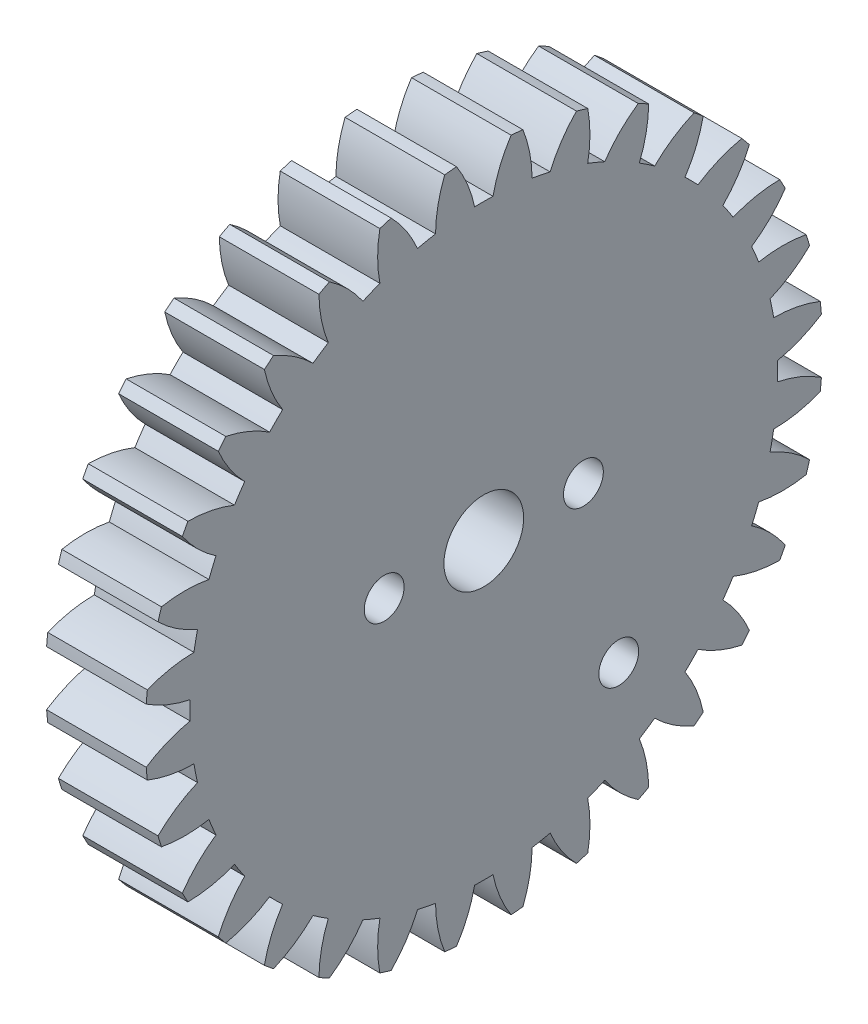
ISO-10303-21;
HEADER;
FILE_DESCRIPTION(('STEP AP214'),'2;1');
FILE_NAME('part.step','',(''),(''),'','','');
FILE_SCHEMA(('AUTOMOTIVE_DESIGN { 1 0 10303 214 1 1 1 1 }'));
ENDSEC;
DATA;
#1=APPLICATION_CONTEXT('core data for automotive mechanical design processes');
#2=APPLICATION_PROTOCOL_DEFINITION('international standard','automotive_design',2000,#1);
#3=PRODUCT_CONTEXT('',#1,'mechanical');
#4=PRODUCT('Part','Part','',(#3));
#5=PRODUCT_RELATED_PRODUCT_CATEGORY('part','',(#4));
#6=PRODUCT_DEFINITION_FORMATION('','',#4);
#7=PRODUCT_DEFINITION_CONTEXT('part definition',#1,'design');
#8=PRODUCT_DEFINITION('design','',#6,#7);
#9=PRODUCT_DEFINITION_SHAPE('','',#8);
#10=(LENGTH_UNIT() NAMED_UNIT(*) SI_UNIT(.MILLI.,.METRE.));
#11=(NAMED_UNIT(*) PLANE_ANGLE_UNIT() SI_UNIT($,.RADIAN.));
#12=(NAMED_UNIT(*) SI_UNIT($,.STERADIAN.) SOLID_ANGLE_UNIT());
#13=UNCERTAINTY_MEASURE_WITH_UNIT(LENGTH_MEASURE(1.E-05),#10,'distance_accuracy_value','');
#14=(GEOMETRIC_REPRESENTATION_CONTEXT(3) GLOBAL_UNCERTAINTY_ASSIGNED_CONTEXT((#13)) GLOBAL_UNIT_ASSIGNED_CONTEXT((#10,
#11,#12)) REPRESENTATION_CONTEXT('',''));
#15=CARTESIAN_POINT('',(0.,0.,0.));
#16=DIRECTION('',(0.,0.,1.));
#17=DIRECTION('',(1.,0.,0.));
#18=AXIS2_PLACEMENT_3D('',#15,#16,#17);
#19=CARTESIAN_POINT('',(-5.73931620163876,-13.2864168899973,75.8291223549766));
#20=DIRECTION('',(-1.,0.,0.));
#21=DIRECTION('',(0.,0.,1.));
#22=AXIS2_PLACEMENT_3D('',#19,#20,#21);
#23=PLANE('',#22);
#24=CARTESIAN_POINT('',(-5.73931620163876,-13.2864168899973,80.8291223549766));
#25=DIRECTION('',(1.,0.,0.));
#26=DIRECTION('',(0.,0.,-1.));
#27=AXIS2_PLACEMENT_3D('',#24,#25,#26);
#28=CIRCLE('',#27,0.999999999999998);
#29=CARTESIAN_POINT('',(-5.73931620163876,-13.2864168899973,79.8291223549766));
#30=VERTEX_POINT('',#29);
#31=EDGE_CURVE('E1650',#30,#30,#28,.T.);
#32=ORIENTED_EDGE('',*,*,#31,.F.);
#33=EDGE_LOOP('',(#32));
#34=FACE_BOUND('',#33,.T.);
#35=CARTESIAN_POINT('',(-5.73931620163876,-13.2864168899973,70.8291223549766));
#36=DIRECTION('',(1.,0.,0.));
#37=DIRECTION('',(0.,0.,-1.));
#38=AXIS2_PLACEMENT_3D('',#35,#36,#37);
#39=CIRCLE('',#38,0.999999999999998);
#40=CARTESIAN_POINT('',(-5.73931620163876,-13.2864168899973,69.8291223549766));
#41=VERTEX_POINT('',#40);
#42=EDGE_CURVE('E1640',#41,#41,#39,.T.);
#43=ORIENTED_EDGE('',*,*,#42,.F.);
#44=EDGE_LOOP('',(#43));
#45=FACE_BOUND('',#44,.T.);
#46=CARTESIAN_POINT('',(-5.73931620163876,-21.9698549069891,69.0561569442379));
#47=DIRECTION('',(1.,0.,0.));
#48=DIRECTION('',(0.,0.,-1.));
#49=AXIS2_PLACEMENT_3D('',#46,#47,#48);
#50=CIRCLE('',#49,0.999999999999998);
#51=CARTESIAN_POINT('',(-5.73931620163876,-21.9698549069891,68.0561569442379));
#52=VERTEX_POINT('',#51);
#53=EDGE_CURVE('E1637',#52,#52,#50,.T.);
#54=ORIENTED_EDGE('',*,*,#53,.F.);
#55=EDGE_LOOP('',(#54));
#56=FACE_BOUND('',#55,.T.);
#57=CARTESIAN_POINT('',(-5.73931620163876,-1.41250210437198,66.6061165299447));
#58=DIRECTION('',(-1.,0.,0.));
#59=DIRECTION('',(0.,-0.195090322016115,-0.980785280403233));
#60=AXIS2_PLACEMENT_3D('',#57,#58,#59);
#61=CIRCLE('',#60,6.4);
#62=CARTESIAN_POINT('',(-5.73931620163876,1.08194656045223,72.4999884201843));
#63=VERTEX_POINT('',#62);
#64=CARTESIAN_POINT('',(-5.73931620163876,3.06519735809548,71.1788845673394));
#65=VERTEX_POINT('',#64);
#66=EDGE_CURVE('E830',#63,#65,#61,.T.);
#67=ORIENTED_EDGE('',*,*,#66,.F.);
#68=CARTESIAN_POINT('',(-5.73931620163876,-13.2864168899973,75.8291223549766));
#69=DIRECTION('',(-1.,0.,0.));
#70=DIRECTION('',(0.,-0.195090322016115,-0.980785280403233));
#71=AXIS2_PLACEMENT_3D('',#68,#69,#70);
#72=CIRCLE('',#71,14.749);
#73=CARTESIAN_POINT('',(-5.73931620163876,1.26222441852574,73.4063064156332));
#74=VERTEX_POINT('',#73);
#75=EDGE_CURVE('E829',#74,#63,#72,.T.);
#76=ORIENTED_EDGE('',*,*,#75,.F.);
#77=CARTESIAN_POINT('',(-5.73931620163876,1.21314147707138,79.8061181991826));
#78=DIRECTION('',(-1.,0.,0.));
#79=DIRECTION('',(0.,-0.195090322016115,-0.980785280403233));
#80=AXIS2_PLACEMENT_3D('',#77,#78,#79);
#81=CIRCLE('',#80,6.4);
#82=CARTESIAN_POINT('',(-5.73931620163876,3.60007379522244,73.8678900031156));
#83=VERTEX_POINT('',#82);
#84=EDGE_CURVE('E818',#83,#74,#81,.T.);
#85=ORIENTED_EDGE('',*,*,#84,.F.);
#86=CARTESIAN_POINT('',(-5.73931620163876,-13.2864168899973,75.8291223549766));
#87=DIRECTION('',(-1.,0.,0.));
#88=DIRECTION('',(0.,0.,1.));
#89=AXIS2_PLACEMENT_3D('',#86,#87,#88);
#90=CIRCLE('',#89,17.);
#91=CARTESIAN_POINT('',(-5.73931620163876,3.65822206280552,74.4582792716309));
#92=VERTEX_POINT('',#91);
#93=EDGE_CURVE('E1537',#92,#83,#90,.T.);
#94=ORIENTED_EDGE('',*,*,#93,.F.);
#95=CARTESIAN_POINT('',(-5.73931620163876,0.158663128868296,69.0998198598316));
#96=DIRECTION('',(-1.,0.,0.));
#97=DIRECTION('',(0.,0.,-1.));
#98=AXIS2_PLACEMENT_3D('',#95,#96,#97);
#99=CIRCLE('',#98,6.4);
#100=CARTESIAN_POINT('',(-5.73931620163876,1.45534429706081,75.3670854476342));
#101=VERTEX_POINT('',#100);
#102=EDGE_CURVE('E1510',#101,#92,#99,.T.);
#103=ORIENTED_EDGE('',*,*,#102,.F.);
#104=CARTESIAN_POINT('',(-5.73931620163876,-13.2864168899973,75.8291223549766));
#105=DIRECTION('',(-1.,0.,0.));
#106=DIRECTION('',(0.,0.,-1.));
#107=AXIS2_PLACEMENT_3D('',#104,#105,#106);
#108=CIRCLE('',#107,14.749);
#109=CARTESIAN_POINT('',(-5.73931620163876,1.45534429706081,76.291159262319));
#110=VERTEX_POINT('',#109);
#111=EDGE_CURVE('E1515',#110,#101,#108,.T.);
#112=ORIENTED_EDGE('',*,*,#111,.F.);
#113=CARTESIAN_POINT('',(-5.73931620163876,0.158663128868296,82.5584248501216));
#114=DIRECTION('',(-1.,0.,0.));
#115=DIRECTION('',(0.,0.,-1.));
#116=AXIS2_PLACEMENT_3D('',#113,#114,#115);
#117=CIRCLE('',#116,6.4);
#118=CARTESIAN_POINT('',(-5.73931620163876,3.65822206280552,77.1999654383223));
#119=VERTEX_POINT('',#118);
#120=EDGE_CURVE('E1512',#119,#110,#117,.T.);
#121=ORIENTED_EDGE('',*,*,#120,.F.);
#122=CARTESIAN_POINT('',(-5.73931620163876,3.60007379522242,77.7903547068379));
#123=VERTEX_POINT('',#122);
#124=EDGE_CURVE('E1535',#123,#119,#90,.T.);
#125=ORIENTED_EDGE('',*,*,#124,.F.);
#126=CARTESIAN_POINT('',(-5.73931620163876,1.21314147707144,71.8521265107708));
#127=DIRECTION('',(-1.,0.,0.));
#128=DIRECTION('',(0.,0.195090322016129,-0.980785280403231));
#129=AXIS2_PLACEMENT_3D('',#126,#127,#128);
#130=CIRCLE('',#129,6.4);
#131=CARTESIAN_POINT('',(-5.73931620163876,1.26222441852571,78.2519382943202));
#132=VERTEX_POINT('',#131);
#133=EDGE_CURVE('E1488',#132,#123,#130,.T.);
#134=ORIENTED_EDGE('',*,*,#133,.F.);
#135=CARTESIAN_POINT('',(-5.73931620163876,-13.2864168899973,75.8291223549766));
#136=DIRECTION('',(-1.,0.,0.));
#137=DIRECTION('',(0.,0.195090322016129,-0.980785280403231));
#138=AXIS2_PLACEMENT_3D('',#135,#136,#137);
#139=CIRCLE('',#138,14.749);
#140=CARTESIAN_POINT('',(-5.73931620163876,1.08194656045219,79.1582562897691));
#141=VERTEX_POINT('',#140);
#142=EDGE_CURVE('E1493',#141,#132,#139,.T.);
#143=ORIENTED_EDGE('',*,*,#142,.F.);
#144=CARTESIAN_POINT('',(-5.73931620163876,-1.41250210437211,85.0521281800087));
#145=DIRECTION('',(-1.,0.,0.));
#146=DIRECTION('',(0.,0.195090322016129,-0.980785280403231));
#147=AXIS2_PLACEMENT_3D('',#144,#145,#146);
#148=CIRCLE('',#147,6.4);
#149=CARTESIAN_POINT('',(-5.73931620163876,3.06519735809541,80.479360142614));
#150=VERTEX_POINT('',#149);
#151=EDGE_CURVE('E1490',#150,#141,#148,.T.);
#152=ORIENTED_EDGE('',*,*,#151,.F.);
#153=CARTESIAN_POINT('',(-5.73931620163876,2.89298716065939,81.0470610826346));
#154=VERTEX_POINT('',#153);
#155=EDGE_CURVE('E1798',#154,#150,#90,.T.);
#156=ORIENTED_EDGE('',*,*,#155,.F.);
#157=CARTESIAN_POINT('',(-5.73931620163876,1.71040992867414,74.7572668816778));
#158=DIRECTION('',(-1.,0.,0.));
#159=DIRECTION('',(0.,0.382683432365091,-0.923879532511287));
#160=AXIS2_PLACEMENT_3D('',#157,#158,#159);
#161=CIRCLE('',#160,6.4);
#162=CARTESIAN_POINT('',(-5.73931620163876,0.510008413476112,81.043683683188));
#163=VERTEX_POINT('',#162);
#164=EDGE_CURVE('E1466',#163,#154,#161,.T.);
#165=ORIENTED_EDGE('',*,*,#164,.F.);
#166=CARTESIAN_POINT('',(-5.73931620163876,-13.2864168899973,75.8291223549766));
#167=DIRECTION('',(-1.,0.,0.));
#168=DIRECTION('',(0.,0.382683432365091,-0.923879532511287));
#169=AXIS2_PLACEMENT_3D('',#166,#167,#168);
#170=CIRCLE('',#169,14.749);
#171=CARTESIAN_POINT('',(-5.73931620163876,0.156380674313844,81.8974165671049));
#172=VERTEX_POINT('',#171);
#173=EDGE_CURVE('E1471',#172,#163,#170,.T.);
#174=ORIENTED_EDGE('',*,*,#173,.F.);
#175=CARTESIAN_POINT('',(-5.73931620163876,-3.43997522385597,87.191396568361));
#176=DIRECTION('',(-1.,0.,0.));
#177=DIRECTION('',(0.,0.382683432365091,-0.923879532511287));
#178=AXIS2_PLACEMENT_3D('',#175,#176,#177);
#179=CIRCLE('',#178,6.4);
#180=CARTESIAN_POINT('',(-5.73931620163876,1.84378928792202,83.5800488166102));
#181=VERTEX_POINT('',#180);
#182=EDGE_CURVE('E1468',#181,#172,#179,.T.);
#183=ORIENTED_EDGE('',*,*,#182,.F.);
#184=CARTESIAN_POINT('',(-5.73931620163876,1.56413510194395,84.1032449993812));
#185=VERTEX_POINT('',#184);
#186=EDGE_CURVE('E1793',#185,#181,#90,.T.);
#187=ORIENTED_EDGE('',*,*,#186,.F.);
#188=CARTESIAN_POINT('',(-5.73931620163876,1.63135873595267,77.7035980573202));
#189=DIRECTION('',(-1.,0.,0.));
#190=DIRECTION('',(0.,0.555570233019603,-0.831469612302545));
#191=AXIS2_PLACEMENT_3D('',#188,#189,#190);
#192=CIRCLE('',#191,6.4);
#193=CARTESIAN_POINT('',(-5.73931620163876,-0.77239647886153,83.6350364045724));
#194=VERTEX_POINT('',#193);
#195=EDGE_CURVE('E1444',#194,#185,#192,.T.);
#196=ORIENTED_EDGE('',*,*,#195,.F.);
#197=CARTESIAN_POINT('',(-5.73931620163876,-13.2864168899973,75.8291223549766));
#198=DIRECTION('',(-1.,0.,0.));
#199=DIRECTION('',(0.,0.555570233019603,-0.831469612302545));
#200=AXIS2_PLACEMENT_3D('',#197,#198,#199);
#201=CIRCLE('',#200,14.749);
#202=CARTESIAN_POINT('',(-5.73931620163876,-1.28578438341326,84.4033757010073));
#203=VERTEX_POINT('',#202);
#204=EDGE_CURVE('E1449',#203,#194,#201,.T.);
#205=ORIENTED_EDGE('',*,*,#204,.F.);
#206=CARTESIAN_POINT('',(-5.73931620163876,-5.84584157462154,88.8940191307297));
#207=DIRECTION('',(-1.,0.,0.));
#208=DIRECTION('',(0.,0.555570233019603,-0.831469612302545));
#209=AXIS2_PLACEMENT_3D('',#206,#207,#208);
#210=CIRCLE('',#209,6.4);
#211=CARTESIAN_POINT('',(-5.73931620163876,0.0409358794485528,86.3828737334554));
#212=VERTEX_POINT('',#211);
#213=EDGE_CURVE('E1446',#212,#203,#210,.T.);
#214=ORIENTED_EDGE('',*,*,#213,.F.);
#215=CARTESIAN_POINT('',(-5.73931620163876,-0.335415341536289,86.8414590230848));
#216=VERTEX_POINT('',#215);
#217=EDGE_CURVE('E1788',#216,#212,#90,.T.);
#218=ORIENTED_EDGE('',*,*,#217,.F.);
#219=CARTESIAN_POINT('',(-5.73931620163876,0.979025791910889,80.5778941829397));
#220=DIRECTION('',(-1.,0.,0.));
#221=DIRECTION('',(0.,0.707106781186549,-0.707106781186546));
#222=AXIS2_PLACEMENT_3D('',#219,#220,#221);
#223=CIRCLE('',#222,6.4);
#224=CARTESIAN_POINT('',(-5.73931620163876,-2.53570815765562,85.9264122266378));
#225=VERTEX_POINT('',#224);
#226=EDGE_CURVE('E1422',#225,#216,#223,.T.);
#227=ORIENTED_EDGE('',*,*,#226,.F.);
#228=CARTESIAN_POINT('',(-5.73931620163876,-13.2864168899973,75.8291223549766));
#229=DIRECTION('',(-1.,0.,0.));
#230=DIRECTION('',(0.,0.707106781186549,-0.707106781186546));
#231=AXIS2_PLACEMENT_3D('',#228,#229,#230);
#232=CIRCLE('',#231,14.749);
#233=CARTESIAN_POINT('',(-5.73931620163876,-3.18912701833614,86.5798310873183));
#234=VERTEX_POINT('',#233);
#235=EDGE_CURVE('E1427',#234,#225,#232,.T.);
#236=ORIENTED_EDGE('',*,*,#235,.F.);
#237=CARTESIAN_POINT('',(-5.73931620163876,-8.53764506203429,90.0945650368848));
#238=DIRECTION('',(-1.,0.,0.));
#239=DIRECTION('',(0.,0.707106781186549,-0.707106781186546));
#240=AXIS2_PLACEMENT_3D('',#237,#238,#239);
#241=CIRCLE('',#240,6.4);
#242=CARTESIAN_POINT('',(-5.73931620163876,-2.27408022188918,88.7801239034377));
#243=VERTEX_POINT('',#242);
#244=EDGE_CURVE('E1424',#243,#234,#241,.T.);
#245=ORIENTED_EDGE('',*,*,#244,.F.);
#246=CARTESIAN_POINT('',(-5.73931620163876,-2.73266551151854,89.1564751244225));
#247=VERTEX_POINT('',#246);
#248=EDGE_CURVE('E1783',#247,#243,#90,.T.);
#249=ORIENTED_EDGE('',*,*,#248,.F.);
#250=CARTESIAN_POINT('',(-5.73931620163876,-0.221520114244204,83.2696976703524));
#251=DIRECTION('',(-1.,0.,0.));
#252=DIRECTION('',(0.,0.831469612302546,-0.5555702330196));
#253=AXIS2_PLACEMENT_3D('',#250,#251,#252);
#254=CIRCLE('',#253,6.4);
#255=CARTESIAN_POINT('',(-5.73931620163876,-4.7121635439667,87.8297548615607));
#256=VERTEX_POINT('',#255);
#257=EDGE_CURVE('E1400',#256,#247,#254,.T.);
#258=ORIENTED_EDGE('',*,*,#257,.F.);
#259=CARTESIAN_POINT('',(-5.73931620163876,-13.2864168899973,75.8291223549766));
#260=DIRECTION('',(-1.,0.,0.));
#261=DIRECTION('',(0.,0.831469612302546,-0.5555702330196));
#262=AXIS2_PLACEMENT_3D('',#259,#260,#261);
#263=CIRCLE('',#262,14.749);
#264=CARTESIAN_POINT('',(-5.73931620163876,-5.48050284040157,88.3431427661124));
#265=VERTEX_POINT('',#264);
#266=EDGE_CURVE('E1405',#265,#256,#263,.T.);
#267=ORIENTED_EDGE('',*,*,#266,.F.);
#268=CARTESIAN_POINT('',(-5.73931620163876,-11.4119411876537,90.7468979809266));
#269=DIRECTION('',(-1.,0.,0.));
#270=DIRECTION('',(0.,0.831469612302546,-0.5555702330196));
#271=AXIS2_PLACEMENT_3D('',#268,#269,#270);
#272=CIRCLE('',#271,6.4);
#273=CARTESIAN_POINT('',(-5.73931620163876,-5.01229424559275,90.6796743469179));
#274=VERTEX_POINT('',#273);
#275=EDGE_CURVE('E1402',#274,#265,#272,.T.);
#276=ORIENTED_EDGE('',*,*,#275,.F.);
#277=CARTESIAN_POINT('',(-5.73931620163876,-5.53549042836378,90.959328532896));
#278=VERTEX_POINT('',#277);
#279=EDGE_CURVE('E1778',#278,#274,#90,.T.);
#280=ORIENTED_EDGE('',*,*,#279,.F.);
#281=CARTESIAN_POINT('',(-5.73931620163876,-1.92414267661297,85.675564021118));
#282=DIRECTION('',(-1.,0.,0.));
#283=DIRECTION('',(0.,0.923879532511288,-0.382683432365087));
#284=AXIS2_PLACEMENT_3D('',#281,#282,#283);
#285=CIRCLE('',#284,6.4);
#286=CARTESIAN_POINT('',(-5.73931620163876,-7.21812267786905,89.2719199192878));
#287=VERTEX_POINT('',#286);
#288=EDGE_CURVE('E1378',#287,#278,#285,.T.);
#289=ORIENTED_EDGE('',*,*,#288,.F.);
#290=CARTESIAN_POINT('',(-5.73931620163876,-13.2864168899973,75.8291223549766));
#291=DIRECTION('',(-1.,0.,0.));
#292=DIRECTION('',(0.,0.923879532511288,-0.382683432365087));
#293=AXIS2_PLACEMENT_3D('',#290,#291,#292);
#294=CIRCLE('',#293,14.749);
#295=CARTESIAN_POINT('',(-5.73931620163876,-8.07185556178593,89.62554765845));
#296=VERTEX_POINT('',#295);
#297=EDGE_CURVE('E1383',#296,#287,#294,.T.);
#298=ORIENTED_EDGE('',*,*,#297,.F.);
#299=CARTESIAN_POINT('',(-5.73931620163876,-14.3582723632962,90.8259491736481));
#300=DIRECTION('',(-1.,0.,0.));
#301=DIRECTION('',(0.,0.923879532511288,-0.382683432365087));
#302=AXIS2_PLACEMENT_3D('',#299,#300,#301);
#303=CIRCLE('',#302,6.4);
#304=CARTESIAN_POINT('',(-5.73931620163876,-8.06847816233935,92.0085264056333));
#305=VERTEX_POINT('',#304);
#306=EDGE_CURVE('E1380',#305,#296,#303,.T.);
#307=ORIENTED_EDGE('',*,*,#306,.F.);
#308=CARTESIAN_POINT('',(-5.73931620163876,-8.63617910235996,92.1807366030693));
#309=VERTEX_POINT('',#308);
#310=EDGE_CURVE('E1773',#309,#305,#90,.T.);
#311=ORIENTED_EDGE('',*,*,#310,.F.);
#312=CARTESIAN_POINT('',(-5.73931620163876,-4.0634110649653,87.7030371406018));
#313=DIRECTION('',(-1.,0.,0.));
#314=DIRECTION('',(0.,0.980785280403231,-0.195090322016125));
#315=AXIS2_PLACEMENT_3D('',#312,#313,#314);
#316=CIRCLE('',#315,6.4);
#317=CARTESIAN_POINT('',(-5.73931620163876,-9.95728295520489,90.1974858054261));
#318=VERTEX_POINT('',#317);
#319=EDGE_CURVE('E1356',#318,#309,#316,.T.);
#320=ORIENTED_EDGE('',*,*,#319,.F.);
#321=CARTESIAN_POINT('',(-5.73931620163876,-13.2864168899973,75.8291223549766));
#322=DIRECTION('',(-1.,0.,0.));
#323=DIRECTION('',(0.,0.980785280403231,-0.195090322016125));
#324=AXIS2_PLACEMENT_3D('',#321,#322,#323);
#325=CIRCLE('',#324,14.749);
#326=CARTESIAN_POINT('',(-5.73931620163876,-10.8636009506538,90.3777636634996));
#327=VERTEX_POINT('',#326);
#328=EDGE_CURVE('E1361',#327,#318,#325,.T.);
#329=ORIENTED_EDGE('',*,*,#328,.F.);
#330=CARTESIAN_POINT('',(-5.73931620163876,-17.2634127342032,90.3286807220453));
#331=DIRECTION('',(-1.,0.,0.));
#332=DIRECTION('',(0.,0.980785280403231,-0.195090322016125));
#333=AXIS2_PLACEMENT_3D('',#330,#331,#332);
#334=CIRCLE('',#333,6.4);
#335=CARTESIAN_POINT('',(-5.73931620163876,-11.3251845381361,92.7156130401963));
#336=VERTEX_POINT('',#335);
#337=EDGE_CURVE('E1358',#336,#327,#334,.T.);
#338=ORIENTED_EDGE('',*,*,#337,.F.);
#339=CARTESIAN_POINT('',(-5.73931620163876,-11.9155738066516,92.7737613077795));
#340=VERTEX_POINT('',#339);
#341=EDGE_CURVE('E1768',#340,#336,#90,.T.);
#342=ORIENTED_EDGE('',*,*,#341,.F.);
#343=CARTESIAN_POINT('',(-5.73931620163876,-6.55711439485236,89.2742023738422));
#344=DIRECTION('',(-1.,0.,0.));
#345=DIRECTION('',(0.,1.,0.));
#346=AXIS2_PLACEMENT_3D('',#343,#344,#345);
#347=CIRCLE('',#346,6.4);
#348=CARTESIAN_POINT('',(-5.73931620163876,-12.824379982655,90.5708835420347));
#349=VERTEX_POINT('',#348);
#350=EDGE_CURVE('E1334',#349,#340,#347,.T.);
#351=ORIENTED_EDGE('',*,*,#350,.F.);
#352=CARTESIAN_POINT('',(-5.73931620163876,-13.2864168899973,75.8291223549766));
#353=DIRECTION('',(-1.,0.,0.));
#354=DIRECTION('',(0.,1.,0.));
#355=AXIS2_PLACEMENT_3D('',#352,#353,#354);
#356=CIRCLE('',#355,14.749);
#357=CARTESIAN_POINT('',(-5.73931620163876,-13.7484537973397,90.5708835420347));
#358=VERTEX_POINT('',#357);
#359=EDGE_CURVE('E1339',#358,#349,#356,.T.);
#360=ORIENTED_EDGE('',*,*,#359,.F.);
#361=CARTESIAN_POINT('',(-5.73931620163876,-20.0157193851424,89.2742023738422));
#362=DIRECTION('',(-1.,0.,0.));
#363=DIRECTION('',(0.,1.,0.));
#364=AXIS2_PLACEMENT_3D('',#361,#362,#363);
#365=CIRCLE('',#364,6.4);
#366=CARTESIAN_POINT('',(-5.73931620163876,-14.6572599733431,92.7737613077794));
#367=VERTEX_POINT('',#366);
#368=EDGE_CURVE('E1336',#367,#358,#365,.T.);
#369=ORIENTED_EDGE('',*,*,#368,.F.);
#370=CARTESIAN_POINT('',(-5.73931620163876,-15.2476492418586,92.7156130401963));
#371=VERTEX_POINT('',#370);
#372=EDGE_CURVE('E1763',#371,#367,#90,.T.);
#373=ORIENTED_EDGE('',*,*,#372,.F.);
#374=CARTESIAN_POINT('',(-5.73931620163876,-9.30942104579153,90.3286807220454));
#375=DIRECTION('',(-1.,0.,0.));
#376=DIRECTION('',(0.,0.98078528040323,0.195090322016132));
#377=AXIS2_PLACEMENT_3D('',#374,#375,#376);
#378=CIRCLE('',#377,6.4);
#379=CARTESIAN_POINT('',(-5.73931620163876,-15.709232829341,90.3777636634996));
#380=VERTEX_POINT('',#379);
#381=EDGE_CURVE('E1312',#380,#371,#378,.T.);
#382=ORIENTED_EDGE('',*,*,#381,.F.);
#383=CARTESIAN_POINT('',(-5.73931620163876,-13.2864168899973,75.8291223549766));
#384=DIRECTION('',(-1.,0.,0.));
#385=DIRECTION('',(0.,0.98078528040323,0.195090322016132));
#386=AXIS2_PLACEMENT_3D('',#383,#384,#385);
#387=CIRCLE('',#386,14.749);
#388=CARTESIAN_POINT('',(-5.73931620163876,-16.6155508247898,90.1974858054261));
#389=VERTEX_POINT('',#388);
#390=EDGE_CURVE('E1317',#389,#380,#387,.T.);
#391=ORIENTED_EDGE('',*,*,#390,.F.);
#392=CARTESIAN_POINT('',(-5.73931620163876,-22.5094227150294,87.7030371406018));
#393=DIRECTION('',(-1.,0.,0.));
#394=DIRECTION('',(0.,0.98078528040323,0.195090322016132));
#395=AXIS2_PLACEMENT_3D('',#392,#393,#394);
#396=CIRCLE('',#395,6.4);
#397=CARTESIAN_POINT('',(-5.73931620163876,-17.9366546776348,92.1807366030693));
#398=VERTEX_POINT('',#397);
#399=EDGE_CURVE('E1314',#398,#389,#396,.T.);
#400=ORIENTED_EDGE('',*,*,#399,.F.);
#401=CARTESIAN_POINT('',(-5.73931620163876,-18.5043556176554,92.0085264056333));
#402=VERTEX_POINT('',#401);
#403=EDGE_CURVE('E1758',#402,#398,#90,.T.);
#404=ORIENTED_EDGE('',*,*,#403,.F.);
#405=CARTESIAN_POINT('',(-5.73931620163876,-12.2145614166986,90.8259491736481));
#406=DIRECTION('',(-1.,0.,0.));
#407=DIRECTION('',(0.,0.923879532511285,0.382683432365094));
#408=AXIS2_PLACEMENT_3D('',#405,#406,#407);
#409=CIRCLE('',#408,6.4);
#410=CARTESIAN_POINT('',(-5.73931620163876,-18.5009782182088,89.62554765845));
#411=VERTEX_POINT('',#410);
#412=EDGE_CURVE('E1290',#411,#402,#409,.T.);
#413=ORIENTED_EDGE('',*,*,#412,.F.);
#414=CARTESIAN_POINT('',(-5.73931620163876,-13.2864168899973,75.8291223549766));
#415=DIRECTION('',(-1.,0.,0.));
#416=DIRECTION('',(0.,0.923879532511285,0.382683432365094));
#417=AXIS2_PLACEMENT_3D('',#414,#415,#416);
#418=CIRCLE('',#417,14.749);
#419=CARTESIAN_POINT('',(-5.73931620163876,-19.3547111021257,89.2719199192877));
#420=VERTEX_POINT('',#419);
#421=EDGE_CURVE('E1295',#420,#411,#418,.T.);
#422=ORIENTED_EDGE('',*,*,#421,.F.);
#423=CARTESIAN_POINT('',(-5.73931620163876,-24.6486911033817,85.6755640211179));
#424=DIRECTION('',(-1.,0.,0.));
#425=DIRECTION('',(0.,0.923879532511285,0.382683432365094));
#426=AXIS2_PLACEMENT_3D('',#423,#424,#425);
#427=CIRCLE('',#426,6.4);
#428=CARTESIAN_POINT('',(-5.73931620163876,-21.037343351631,90.9593285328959));
#429=VERTEX_POINT('',#428);
#430=EDGE_CURVE('E1292',#429,#420,#427,.T.);
#431=ORIENTED_EDGE('',*,*,#430,.F.);
#432=CARTESIAN_POINT('',(-5.73931620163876,-21.560539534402,90.6796743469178));
#433=VERTEX_POINT('',#432);
#434=EDGE_CURVE('E1753',#433,#429,#90,.T.);
#435=ORIENTED_EDGE('',*,*,#434,.F.);
#436=CARTESIAN_POINT('',(-5.73931620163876,-15.160892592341,90.7468979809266));
#437=DIRECTION('',(-1.,0.,0.));
#438=DIRECTION('',(0.,0.831469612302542,0.555570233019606));
#439=AXIS2_PLACEMENT_3D('',#436,#437,#438);
#440=CIRCLE('',#439,6.4);
#441=CARTESIAN_POINT('',(-5.73931620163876,-21.0923309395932,88.3431427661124));
#442=VERTEX_POINT('',#441);
#443=EDGE_CURVE('E1268',#442,#433,#440,.T.);
#444=ORIENTED_EDGE('',*,*,#443,.F.);
#445=CARTESIAN_POINT('',(-5.73931620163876,-13.2864168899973,75.8291223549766));
#446=DIRECTION('',(-1.,0.,0.));
#447=DIRECTION('',(0.,0.831469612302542,0.555570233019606));
#448=AXIS2_PLACEMENT_3D('',#445,#446,#447);
#449=CIRCLE('',#448,14.749);
#450=CARTESIAN_POINT('',(-5.73931620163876,-21.860670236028,87.8297548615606));
#451=VERTEX_POINT('',#450);
#452=EDGE_CURVE('E1273',#451,#442,#449,.T.);
#453=ORIENTED_EDGE('',*,*,#452,.F.);
#454=CARTESIAN_POINT('',(-5.73931620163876,-26.3513136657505,83.2696976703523));
#455=DIRECTION('',(-1.,0.,0.));
#456=DIRECTION('',(0.,0.831469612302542,0.555570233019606));
#457=AXIS2_PLACEMENT_3D('',#454,#455,#456);
#458=CIRCLE('',#457,6.4);
#459=CARTESIAN_POINT('',(-5.73931620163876,-23.8401682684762,89.1564751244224));
#460=VERTEX_POINT('',#459);
#461=EDGE_CURVE('E1270',#460,#451,#458,.T.);
#462=ORIENTED_EDGE('',*,*,#461,.F.);
#463=CARTESIAN_POINT('',(-5.73931620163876,-24.2987535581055,88.7801239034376));
#464=VERTEX_POINT('',#463);
#465=EDGE_CURVE('E1748',#464,#460,#90,.T.);
#466=ORIENTED_EDGE('',*,*,#465,.F.);
#467=CARTESIAN_POINT('',(-5.73931620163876,-18.0351887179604,90.0945650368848));
#468=DIRECTION('',(-1.,0.,0.));
#469=DIRECTION('',(0.,0.707106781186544,0.707106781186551));
#470=AXIS2_PLACEMENT_3D('',#467,#468,#469);
#471=CIRCLE('',#470,6.4);
#472=CARTESIAN_POINT('',(-5.73931620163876,-23.3837067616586,86.5798310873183));
#473=VERTEX_POINT('',#472);
#474=EDGE_CURVE('E1246',#473,#464,#471,.T.);
#475=ORIENTED_EDGE('',*,*,#474,.F.);
#476=CARTESIAN_POINT('',(-5.73931620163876,-13.2864168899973,75.8291223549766));
#477=DIRECTION('',(-1.,0.,0.));
#478=DIRECTION('',(0.,0.707106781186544,0.707106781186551));
#479=AXIS2_PLACEMENT_3D('',#476,#477,#478);
#480=CIRCLE('',#479,14.749);
#481=CARTESIAN_POINT('',(-5.73931620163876,-24.0371256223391,85.9264122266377));
#482=VERTEX_POINT('',#481);
#483=EDGE_CURVE('E1251',#482,#473,#480,.T.);
#484=ORIENTED_EDGE('',*,*,#483,.F.);
#485=CARTESIAN_POINT('',(-5.73931620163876,-27.5518595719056,80.5778941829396));
#486=DIRECTION('',(-1.,0.,0.));
#487=DIRECTION('',(0.,0.707106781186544,0.707106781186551));
#488=AXIS2_PLACEMENT_3D('',#485,#486,#487);
#489=CIRCLE('',#488,6.4);
#490=CARTESIAN_POINT('',(-5.73931620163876,-26.2374184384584,86.8414590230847));
#491=VERTEX_POINT('',#490);
#492=EDGE_CURVE('E1248',#491,#482,#489,.T.);
#493=ORIENTED_EDGE('',*,*,#492,.F.);
#494=CARTESIAN_POINT('',(-5.73931620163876,-26.6137696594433,86.3828737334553));
#495=VERTEX_POINT('',#494);
#496=EDGE_CURVE('E1743',#495,#491,#90,.T.);
#497=ORIENTED_EDGE('',*,*,#496,.F.);
#498=CARTESIAN_POINT('',(-5.73931620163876,-20.7269922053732,88.8940191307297));
#499=DIRECTION('',(-1.,0.,0.));
#500=DIRECTION('',(0.,0.555570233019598,0.831469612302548));
#501=AXIS2_PLACEMENT_3D('',#498,#499,#500);
#502=CIRCLE('',#501,6.4);
#503=CARTESIAN_POINT('',(-5.73931620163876,-25.2870493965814,84.4033757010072));
#504=VERTEX_POINT('',#503);
#505=EDGE_CURVE('E1224',#504,#495,#502,.T.);
#506=ORIENTED_EDGE('',*,*,#505,.F.);
#507=CARTESIAN_POINT('',(-5.73931620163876,-13.2864168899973,75.8291223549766));
#508=DIRECTION('',(-1.,0.,0.));
#509=DIRECTION('',(0.,0.555570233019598,0.831469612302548));
#510=AXIS2_PLACEMENT_3D('',#507,#508,#509);
#511=CIRCLE('',#510,14.749);
#512=CARTESIAN_POINT('',(-5.73931620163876,-25.8004373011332,83.6350364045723));
#513=VERTEX_POINT('',#512);
#514=EDGE_CURVE('E1229',#513,#504,#511,.T.);
#515=ORIENTED_EDGE('',*,*,#514,.F.);
#516=CARTESIAN_POINT('',(-5.73931620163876,-28.2041925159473,77.7035980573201));
#517=DIRECTION('',(-1.,0.,0.));
#518=DIRECTION('',(0.,0.555570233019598,0.831469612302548));
#519=AXIS2_PLACEMENT_3D('',#516,#517,#518);
#520=CIRCLE('',#519,6.4);
#521=CARTESIAN_POINT('',(-5.73931620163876,-28.1369688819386,84.1032449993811));
#522=VERTEX_POINT('',#521);
#523=EDGE_CURVE('E1226',#522,#513,#520,.T.);
#524=ORIENTED_EDGE('',*,*,#523,.F.);
#525=CARTESIAN_POINT('',(-5.73931620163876,-28.4166230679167,83.5800488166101));
#526=VERTEX_POINT('',#525);
#527=EDGE_CURVE('E1738',#526,#522,#90,.T.);
#528=ORIENTED_EDGE('',*,*,#527,.F.);
#529=CARTESIAN_POINT('',(-5.73931620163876,-23.1328585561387,87.1913965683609));
#530=DIRECTION('',(-1.,0.,0.));
#531=DIRECTION('',(0.,0.382683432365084,0.923879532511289));
#532=AXIS2_PLACEMENT_3D('',#529,#530,#531);
#533=CIRCLE('',#532,6.4);
#534=CARTESIAN_POINT('',(-5.73931620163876,-26.7292144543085,81.8974165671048));
#535=VERTEX_POINT('',#534);
#536=EDGE_CURVE('E1202',#535,#526,#533,.T.);
#537=ORIENTED_EDGE('',*,*,#536,.F.);
#538=CARTESIAN_POINT('',(-5.73931620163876,-13.2864168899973,75.8291223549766));
#539=DIRECTION('',(-1.,0.,0.));
#540=DIRECTION('',(0.,0.382683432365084,0.923879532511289));
#541=AXIS2_PLACEMENT_3D('',#538,#539,#540);
#542=CIRCLE('',#541,14.749);
#543=CARTESIAN_POINT('',(-5.73931620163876,-27.0828421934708,81.0436836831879));
#544=VERTEX_POINT('',#543);
#545=EDGE_CURVE('E1207',#544,#535,#542,.T.);
#546=ORIENTED_EDGE('',*,*,#545,.F.);
#547=CARTESIAN_POINT('',(-5.73931620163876,-28.2832437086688,74.7572668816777));
#548=DIRECTION('',(-1.,0.,0.));
#549=DIRECTION('',(0.,0.382683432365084,0.923879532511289));
#550=AXIS2_PLACEMENT_3D('',#547,#548,#549);
#551=CIRCLE('',#550,6.4);
#552=CARTESIAN_POINT('',(-5.73931620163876,-29.4658209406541,81.0470610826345));
#553=VERTEX_POINT('',#552);
#554=EDGE_CURVE('E1204',#553,#544,#551,.T.);
#555=ORIENTED_EDGE('',*,*,#554,.F.);
#556=CARTESIAN_POINT('',(-5.73931620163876,-29.6380311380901,80.4793601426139));
#557=VERTEX_POINT('',#556);
#558=EDGE_CURVE('E1733',#557,#553,#90,.T.);
#559=ORIENTED_EDGE('',*,*,#558,.F.);
#560=CARTESIAN_POINT('',(-5.73931620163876,-25.1603316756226,85.0521281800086));
#561=DIRECTION('',(-1.,0.,0.));
#562=DIRECTION('',(0.,0.195090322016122,0.980785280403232));
#563=AXIS2_PLACEMENT_3D('',#560,#561,#562);
#564=CIRCLE('',#563,6.4);
#565=CARTESIAN_POINT('',(-5.73931620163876,-27.6547803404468,79.158256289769));
#566=VERTEX_POINT('',#565);
#567=EDGE_CURVE('E1180',#566,#557,#564,.T.);
#568=ORIENTED_EDGE('',*,*,#567,.F.);
#569=CARTESIAN_POINT('',(-5.73931620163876,-13.2864168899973,75.8291223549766));
#570=DIRECTION('',(-1.,0.,0.));
#571=DIRECTION('',(0.,0.195090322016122,0.980785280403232));
#572=AXIS2_PLACEMENT_3D('',#569,#570,#571);
#573=CIRCLE('',#572,14.749);
#574=CARTESIAN_POINT('',(-5.73931620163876,-27.8350581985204,78.2519382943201));
#575=VERTEX_POINT('',#574);
#576=EDGE_CURVE('E1185',#575,#566,#573,.T.);
#577=ORIENTED_EDGE('',*,*,#576,.F.);
#578=CARTESIAN_POINT('',(-5.73931620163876,-27.785975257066,71.8521265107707));
#579=DIRECTION('',(-1.,0.,0.));
#580=DIRECTION('',(0.,0.195090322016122,0.980785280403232));
#581=AXIS2_PLACEMENT_3D('',#578,#579,#580);
#582=CIRCLE('',#581,6.4);
#583=CARTESIAN_POINT('',(-5.73931620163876,-30.1729075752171,77.7903547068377));
#584=VERTEX_POINT('',#583);
#585=EDGE_CURVE('E1182',#584,#575,#582,.T.);
#586=ORIENTED_EDGE('',*,*,#585,.F.);
#587=CARTESIAN_POINT('',(-5.73931620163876,-30.2310558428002,77.1999654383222));
#588=VERTEX_POINT('',#587);
#589=EDGE_CURVE('E1728',#588,#584,#90,.T.);
#590=ORIENTED_EDGE('',*,*,#589,.F.);
#591=CARTESIAN_POINT('',(-5.73931620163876,-26.731496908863,82.5584248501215));
#592=DIRECTION('',(-1.,0.,0.));
#593=DIRECTION('',(0.,0.,1.));
#594=AXIS2_PLACEMENT_3D('',#591,#592,#593);
#595=CIRCLE('',#594,6.4);
#596=CARTESIAN_POINT('',(-5.73931620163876,-28.0281780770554,76.2911592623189));
#597=VERTEX_POINT('',#596);
#598=EDGE_CURVE('E1158',#597,#588,#595,.T.);
#599=ORIENTED_EDGE('',*,*,#598,.F.);
#600=CARTESIAN_POINT('',(-5.73931620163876,-13.2864168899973,75.8291223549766));
#601=DIRECTION('',(-1.,0.,0.));
#602=DIRECTION('',(0.,0.,1.));
#603=AXIS2_PLACEMENT_3D('',#600,#601,#602);
#604=CIRCLE('',#603,14.749);
#605=CARTESIAN_POINT('',(-5.73931620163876,-28.0281780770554,75.3670854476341));
#606=VERTEX_POINT('',#605);
#607=EDGE_CURVE('E1163',#606,#597,#604,.T.);
#608=ORIENTED_EDGE('',*,*,#607,.F.);
#609=CARTESIAN_POINT('',(-5.73931620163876,-26.7314969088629,69.0998198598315));
#610=DIRECTION('',(-1.,0.,0.));
#611=DIRECTION('',(0.,0.,1.));
#612=AXIS2_PLACEMENT_3D('',#609,#610,#611);
#613=CIRCLE('',#612,6.4);
#614=CARTESIAN_POINT('',(-5.73931620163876,-30.2310558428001,74.4582792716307));
#615=VERTEX_POINT('',#614);
#616=EDGE_CURVE('E1160',#615,#606,#613,.T.);
#617=ORIENTED_EDGE('',*,*,#616,.F.);
#618=CARTESIAN_POINT('',(-5.73931620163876,-30.172907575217,73.8678900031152));
#619=VERTEX_POINT('',#618);
#620=EDGE_CURVE('E1723',#619,#615,#90,.T.);
#621=ORIENTED_EDGE('',*,*,#620,.F.);
#622=CARTESIAN_POINT('',(-5.73931620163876,-27.7859752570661,79.8061181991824));
#623=DIRECTION('',(-1.,0.,0.));
#624=DIRECTION('',(0.,-0.195090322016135,0.980785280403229));
#625=AXIS2_PLACEMENT_3D('',#622,#623,#624);
#626=CIRCLE('',#625,6.4);
#627=CARTESIAN_POINT('',(-5.73931620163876,-27.8350581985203,73.4063064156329));
#628=VERTEX_POINT('',#627);
#629=EDGE_CURVE('E1136',#628,#619,#626,.T.);
#630=ORIENTED_EDGE('',*,*,#629,.F.);
#631=CARTESIAN_POINT('',(-5.73931620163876,-13.2864168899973,75.8291223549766));
#632=DIRECTION('',(-1.,0.,0.));
#633=DIRECTION('',(0.,-0.195090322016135,0.980785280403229));
#634=AXIS2_PLACEMENT_3D('',#631,#632,#633);
#635=CIRCLE('',#634,14.749);
#636=CARTESIAN_POINT('',(-5.73931620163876,-27.6547803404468,72.499988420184));
#637=VERTEX_POINT('',#636);
#638=EDGE_CURVE('E1141',#637,#628,#635,.T.);
#639=ORIENTED_EDGE('',*,*,#638,.F.);
#640=CARTESIAN_POINT('',(-5.73931620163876,-25.1603316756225,66.6061165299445));
#641=DIRECTION('',(-1.,0.,0.));
#642=DIRECTION('',(0.,-0.195090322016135,0.980785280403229));
#643=AXIS2_PLACEMENT_3D('',#640,#641,#642);
#644=CIRCLE('',#643,6.4);
#645=CARTESIAN_POINT('',(-5.73931620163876,-29.63803113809,71.1788845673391));
#646=VERTEX_POINT('',#645);
#647=EDGE_CURVE('E1138',#646,#637,#644,.T.);
#648=ORIENTED_EDGE('',*,*,#647,.F.);
#649=CARTESIAN_POINT('',(-5.73931620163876,-29.465820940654,70.6111836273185));
#650=VERTEX_POINT('',#649);
#651=EDGE_CURVE('E1718',#650,#646,#90,.T.);
#652=ORIENTED_EDGE('',*,*,#651,.F.);
#653=CARTESIAN_POINT('',(-5.73931620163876,-28.2832437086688,76.9009778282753));
#654=DIRECTION('',(-1.,0.,0.));
#655=DIRECTION('',(0.,-0.382683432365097,0.923879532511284));
#656=AXIS2_PLACEMENT_3D('',#653,#654,#655);
#657=CIRCLE('',#656,6.4);
#658=CARTESIAN_POINT('',(-5.73931620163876,-27.0828421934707,70.6145610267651));
#659=VERTEX_POINT('',#658);
#660=EDGE_CURVE('E1114',#659,#650,#657,.T.);
#661=ORIENTED_EDGE('',*,*,#660,.F.);
#662=CARTESIAN_POINT('',(-5.73931620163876,-13.2864168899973,75.8291223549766));
#663=DIRECTION('',(-1.,0.,0.));
#664=DIRECTION('',(0.,-0.382683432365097,0.923879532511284));
#665=AXIS2_PLACEMENT_3D('',#662,#663,#664);
#666=CIRCLE('',#665,14.749);
#667=CARTESIAN_POINT('',(-5.73931620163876,-26.7292144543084,69.7608281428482));
#668=VERTEX_POINT('',#667);
#669=EDGE_CURVE('E1119',#668,#659,#666,.T.);
#670=ORIENTED_EDGE('',*,*,#669,.F.);
#671=CARTESIAN_POINT('',(-5.73931620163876,-23.1328585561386,64.4668481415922));
#672=DIRECTION('',(-1.,0.,0.));
#673=DIRECTION('',(0.,-0.382683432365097,0.923879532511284));
#674=AXIS2_PLACEMENT_3D('',#671,#672,#673);
#675=CIRCLE('',#674,6.4);
#676=CARTESIAN_POINT('',(-5.73931620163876,-28.4166230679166,68.0781958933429));
#677=VERTEX_POINT('',#676);
#678=EDGE_CURVE('E1116',#677,#668,#675,.T.);
#679=ORIENTED_EDGE('',*,*,#678,.F.);
#680=CARTESIAN_POINT('',(-5.73931620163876,-28.1369688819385,67.5549997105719));
#681=VERTEX_POINT('',#680);
#682=EDGE_CURVE('E1713',#681,#677,#90,.T.);
#683=ORIENTED_EDGE('',*,*,#682,.F.);
#684=CARTESIAN_POINT('',(-5.73931620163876,-28.2041925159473,73.9546466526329));
#685=DIRECTION('',(-1.,0.,0.));
#686=DIRECTION('',(0.,-0.555570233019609,0.831469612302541));
#687=AXIS2_PLACEMENT_3D('',#684,#685,#686);
#688=CIRCLE('',#687,6.4);
#689=CARTESIAN_POINT('',(-5.73931620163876,-25.800437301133,68.0232083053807));
#690=VERTEX_POINT('',#689);
#691=EDGE_CURVE('E1092',#690,#681,#688,.T.);
#692=ORIENTED_EDGE('',*,*,#691,.F.);
#693=CARTESIAN_POINT('',(-5.73931620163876,-13.2864168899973,75.8291223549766));
#694=DIRECTION('',(-1.,0.,0.));
#695=DIRECTION('',(0.,-0.555570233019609,0.831469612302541));
#696=AXIS2_PLACEMENT_3D('',#693,#694,#695);
#697=CIRCLE('',#696,14.749);
#698=CARTESIAN_POINT('',(-5.73931620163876,-25.2870493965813,67.2548690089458));
#699=VERTEX_POINT('',#698);
#700=EDGE_CURVE('E1097',#699,#690,#697,.T.);
#701=ORIENTED_EDGE('',*,*,#700,.F.);
#702=CARTESIAN_POINT('',(-5.73931620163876,-20.726992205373,62.7642255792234));
#703=DIRECTION('',(-1.,0.,0.));
#704=DIRECTION('',(0.,-0.555570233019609,0.831469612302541));
#705=AXIS2_PLACEMENT_3D('',#702,#703,#704);
#706=CIRCLE('',#705,6.4);
#707=CARTESIAN_POINT('',(-5.73931620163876,-26.6137696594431,65.2753709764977));
#708=VERTEX_POINT('',#707);
#709=EDGE_CURVE('E1094',#708,#699,#706,.T.);
#710=ORIENTED_EDGE('',*,*,#709,.F.);
#711=CARTESIAN_POINT('',(-5.73931620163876,-26.2374184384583,64.8167856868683));
#712=VERTEX_POINT('',#711);
#713=EDGE_CURVE('E1708',#712,#708,#90,.T.);
#714=ORIENTED_EDGE('',*,*,#713,.F.);
#715=CARTESIAN_POINT('',(-5.73931620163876,-27.5518595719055,71.0803505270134));
#716=DIRECTION('',(-1.,0.,0.));
#717=DIRECTION('',(0.,-0.707106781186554,0.707106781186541));
#718=AXIS2_PLACEMENT_3D('',#715,#716,#717);
#719=CIRCLE('',#718,6.4);
#720=CARTESIAN_POINT('',(-5.73931620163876,-24.0371256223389,65.7318324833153));
#721=VERTEX_POINT('',#720);
#722=EDGE_CURVE('E1070',#721,#712,#719,.T.);
#723=ORIENTED_EDGE('',*,*,#722,.F.);
#724=CARTESIAN_POINT('',(-5.73931620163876,-13.2864168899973,75.8291223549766));
#725=DIRECTION('',(-1.,0.,0.));
#726=DIRECTION('',(0.,-0.707106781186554,0.707106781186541));
#727=AXIS2_PLACEMENT_3D('',#724,#725,#726);
#728=CIRCLE('',#727,14.749);
#729=CARTESIAN_POINT('',(-5.73931620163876,-23.3837067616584,65.0784136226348));
#730=VERTEX_POINT('',#729);
#731=EDGE_CURVE('E1075',#730,#721,#728,.T.);
#732=ORIENTED_EDGE('',*,*,#731,.F.);
#733=CARTESIAN_POINT('',(-5.73931620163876,-18.0351887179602,61.5636796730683));
#734=DIRECTION('',(-1.,0.,0.));
#735=DIRECTION('',(0.,-0.707106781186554,0.707106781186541));
#736=AXIS2_PLACEMENT_3D('',#733,#734,#735);
#737=CIRCLE('',#736,6.4);
#738=CARTESIAN_POINT('',(-5.73931620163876,-24.2987535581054,62.8781208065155));
#739=VERTEX_POINT('',#738);
#740=EDGE_CURVE('E1072',#739,#730,#737,.T.);
#741=ORIENTED_EDGE('',*,*,#740,.F.);
#742=CARTESIAN_POINT('',(-5.73931620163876,-23.840168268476,62.5017695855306));
#743=VERTEX_POINT('',#742);
#744=EDGE_CURVE('E1703',#743,#739,#90,.T.);
#745=ORIENTED_EDGE('',*,*,#744,.F.);
#746=CARTESIAN_POINT('',(-5.73931620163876,-26.3513136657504,68.3885470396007));
#747=DIRECTION('',(-1.,0.,0.));
#748=DIRECTION('',(0.,-0.83146961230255,0.555570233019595));
#749=AXIS2_PLACEMENT_3D('',#746,#747,#748);
#750=CIRCLE('',#749,6.4);
#751=CARTESIAN_POINT('',(-5.73931620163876,-21.8606702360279,63.8284898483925));
#752=VERTEX_POINT('',#751);
#753=EDGE_CURVE('E1048',#752,#743,#750,.T.);
#754=ORIENTED_EDGE('',*,*,#753,.F.);
#755=CARTESIAN_POINT('',(-5.73931620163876,-13.2864168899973,75.8291223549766));
#756=DIRECTION('',(-1.,0.,0.));
#757=DIRECTION('',(0.,-0.83146961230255,0.555570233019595));
#758=AXIS2_PLACEMENT_3D('',#755,#756,#757);
#759=CIRCLE('',#758,14.749);
#760=CARTESIAN_POINT('',(-5.73931620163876,-21.092330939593,63.3151019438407));
#761=VERTEX_POINT('',#760);
#762=EDGE_CURVE('E1053',#761,#752,#759,.T.);
#763=ORIENTED_EDGE('',*,*,#762,.F.);
#764=CARTESIAN_POINT('',(-5.73931620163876,-15.1608925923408,60.9113467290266));
#765=DIRECTION('',(-1.,0.,0.));
#766=DIRECTION('',(0.,-0.83146961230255,0.555570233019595));
#767=AXIS2_PLACEMENT_3D('',#764,#765,#766);
#768=CIRCLE('',#767,6.4);
#769=CARTESIAN_POINT('',(-5.73931620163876,-21.5605395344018,60.9785703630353));
#770=VERTEX_POINT('',#769);
#771=EDGE_CURVE('E1050',#770,#761,#768,.T.);
#772=ORIENTED_EDGE('',*,*,#771,.F.);
#773=CARTESIAN_POINT('',(-5.73931620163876,-21.0373433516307,60.6989161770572));
#774=VERTEX_POINT('',#773);
#775=EDGE_CURVE('E1698',#774,#770,#90,.T.);
#776=ORIENTED_EDGE('',*,*,#775,.F.);
#777=CARTESIAN_POINT('',(-5.73931620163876,-24.6486911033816,65.9826806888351));
#778=DIRECTION('',(-1.,0.,0.));
#779=DIRECTION('',(0.,-0.923879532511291,0.382683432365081));
#780=AXIS2_PLACEMENT_3D('',#777,#778,#779);
#781=CIRCLE('',#780,6.4);
#782=CARTESIAN_POINT('',(-5.73931620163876,-19.3547111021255,62.3863247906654));
#783=VERTEX_POINT('',#782);
#784=EDGE_CURVE('E1026',#783,#774,#781,.T.);
#785=ORIENTED_EDGE('',*,*,#784,.F.);
#786=CARTESIAN_POINT('',(-5.73931620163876,-13.2864168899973,75.8291223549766));
#787=DIRECTION('',(-1.,0.,0.));
#788=DIRECTION('',(0.,-0.923879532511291,0.382683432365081));
#789=AXIS2_PLACEMENT_3D('',#786,#787,#788);
#790=CIRCLE('',#789,14.749);
#791=CARTESIAN_POINT('',(-5.73931620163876,-18.5009782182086,62.0326970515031));
#792=VERTEX_POINT('',#791);
#793=EDGE_CURVE('E1031',#792,#783,#790,.T.);
#794=ORIENTED_EDGE('',*,*,#793,.F.);
#795=CARTESIAN_POINT('',(-5.73931620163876,-12.2145614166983,60.8322955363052));
#796=DIRECTION('',(-1.,0.,0.));
#797=DIRECTION('',(0.,-0.923879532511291,0.382683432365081));
#798=AXIS2_PLACEMENT_3D('',#795,#796,#797);
#799=CIRCLE('',#798,6.4);
#800=CARTESIAN_POINT('',(-5.73931620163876,-18.5043556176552,59.6497183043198));
#801=VERTEX_POINT('',#800);
#802=EDGE_CURVE('E1028',#801,#792,#799,.T.);
#803=ORIENTED_EDGE('',*,*,#802,.F.);
#804=CARTESIAN_POINT('',(-5.73931620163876,-17.9366546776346,59.4775081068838));
#805=VERTEX_POINT('',#804);
#806=EDGE_CURVE('E1693',#805,#801,#90,.T.);
#807=ORIENTED_EDGE('',*,*,#806,.F.);
#808=CARTESIAN_POINT('',(-5.73931620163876,-22.5094227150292,63.9552075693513));
#809=DIRECTION('',(-1.,0.,0.));
#810=DIRECTION('',(0.,-0.980785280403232,0.195090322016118));
#811=AXIS2_PLACEMENT_3D('',#808,#809,#810);
#812=CIRCLE('',#811,6.4);
#813=CARTESIAN_POINT('',(-5.73931620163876,-16.6155508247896,61.4607589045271));
#814=VERTEX_POINT('',#813);
#815=EDGE_CURVE('E1004',#814,#805,#812,.T.);
#816=ORIENTED_EDGE('',*,*,#815,.F.);
#817=CARTESIAN_POINT('',(-5.73931620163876,-13.2864168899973,75.8291223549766));
#818=DIRECTION('',(-1.,0.,0.));
#819=DIRECTION('',(0.,-0.980785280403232,0.195090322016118));
#820=AXIS2_PLACEMENT_3D('',#817,#818,#819);
#821=CIRCLE('',#820,14.749);
#822=CARTESIAN_POINT('',(-5.73931620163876,-15.7092328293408,61.2804810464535));
#823=VERTEX_POINT('',#822);
#824=EDGE_CURVE('E1009',#823,#814,#821,.T.);
#825=ORIENTED_EDGE('',*,*,#824,.F.);
#826=CARTESIAN_POINT('',(-5.73931620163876,-9.30942104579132,61.3295639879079));
#827=DIRECTION('',(-1.,0.,0.));
#828=DIRECTION('',(0.,-0.980785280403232,0.195090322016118));
#829=AXIS2_PLACEMENT_3D('',#826,#827,#828);
#830=CIRCLE('',#829,6.4);
#831=CARTESIAN_POINT('',(-5.73931620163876,-15.2476492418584,58.9426316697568));
#832=VERTEX_POINT('',#831);
#833=EDGE_CURVE('E1006',#832,#823,#830,.T.);
#834=ORIENTED_EDGE('',*,*,#833,.F.);
#835=CARTESIAN_POINT('',(-5.73931620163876,-14.6572599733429,58.8844834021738));
#836=VERTEX_POINT('',#835);
#837=EDGE_CURVE('E1688',#836,#832,#90,.T.);
#838=ORIENTED_EDGE('',*,*,#837,.F.);
#839=CARTESIAN_POINT('',(-5.73931620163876,-20.0157193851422,62.3840423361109));
#840=DIRECTION('',(-1.,0.,0.));
#841=DIRECTION('',(0.,-1.,0.));
#842=AXIS2_PLACEMENT_3D('',#839,#840,#841);
#843=CIRCLE('',#842,6.4);
#844=CARTESIAN_POINT('',(-5.73931620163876,-13.7484537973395,61.0873611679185));
#845=VERTEX_POINT('',#844);
#846=EDGE_CURVE('E982',#845,#836,#843,.T.);
#847=ORIENTED_EDGE('',*,*,#846,.F.);
#848=CARTESIAN_POINT('',(-5.73931620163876,-13.2864168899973,75.8291223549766));
#849=DIRECTION('',(-1.,0.,0.));
#850=DIRECTION('',(0.,-1.,0.));
#851=AXIS2_PLACEMENT_3D('',#848,#849,#850);
#852=CIRCLE('',#851,14.749);
#853=CARTESIAN_POINT('',(-5.73931620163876,-12.8243799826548,61.0873611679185));
#854=VERTEX_POINT('',#853);
#855=EDGE_CURVE('E987',#854,#845,#852,.T.);
#856=ORIENTED_EDGE('',*,*,#855,.F.);
#857=CARTESIAN_POINT('',(-5.73931620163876,-6.55711439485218,62.3840423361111));
#858=DIRECTION('',(-1.,0.,0.));
#859=DIRECTION('',(0.,-1.,0.));
#860=AXIS2_PLACEMENT_3D('',#857,#858,#859);
#861=CIRCLE('',#860,6.4);
#862=CARTESIAN_POINT('',(-5.73931620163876,-11.9155738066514,58.8844834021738));
#863=VERTEX_POINT('',#862);
#864=EDGE_CURVE('E984',#863,#854,#861,.T.);
#865=ORIENTED_EDGE('',*,*,#864,.F.);
#866=CARTESIAN_POINT('',(-5.73931620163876,-11.3251845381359,58.9426316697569));
#867=VERTEX_POINT('',#866);
#868=EDGE_CURVE('E1683',#867,#863,#90,.T.);
#869=ORIENTED_EDGE('',*,*,#868,.F.);
#870=CARTESIAN_POINT('',(-5.73931620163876,-17.263412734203,61.3295639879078));
#871=DIRECTION('',(-1.,0.,0.));
#872=DIRECTION('',(0.,-0.980785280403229,-0.195090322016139));
#873=AXIS2_PLACEMENT_3D('',#870,#871,#872);
#874=CIRCLE('',#873,6.4);
#875=CARTESIAN_POINT('',(-5.73931620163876,-10.8636009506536,61.2804810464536));
#876=VERTEX_POINT('',#875);
#877=EDGE_CURVE('E960',#876,#867,#874,.T.);
#878=ORIENTED_EDGE('',*,*,#877,.F.);
#879=CARTESIAN_POINT('',(-5.73931620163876,-13.2864168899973,75.8291223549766));
#880=DIRECTION('',(-1.,0.,0.));
#881=DIRECTION('',(0.,-0.980785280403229,-0.195090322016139));
#882=AXIS2_PLACEMENT_3D('',#879,#880,#881);
#883=CIRCLE('',#882,14.749);
#884=CARTESIAN_POINT('',(-5.73931620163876,-9.95728295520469,61.4607589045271));
#885=VERTEX_POINT('',#884);
#886=EDGE_CURVE('E965',#885,#876,#883,.T.);
#887=ORIENTED_EDGE('',*,*,#886,.F.);
#888=CARTESIAN_POINT('',(-5.73931620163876,-4.06341106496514,63.9552075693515));
#889=DIRECTION('',(-1.,0.,0.));
#890=DIRECTION('',(0.,-0.980785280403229,-0.195090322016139));
#891=AXIS2_PLACEMENT_3D('',#888,#889,#890);
#892=CIRCLE('',#891,6.4);
#893=CARTESIAN_POINT('',(-5.73931620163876,-8.63617910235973,59.4775081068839));
#894=VERTEX_POINT('',#893);
#895=EDGE_CURVE('E962',#894,#885,#892,.T.);
#896=ORIENTED_EDGE('',*,*,#895,.F.);
#897=CARTESIAN_POINT('',(-5.73931620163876,-8.06847816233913,59.6497183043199));
#898=VERTEX_POINT('',#897);
#899=EDGE_CURVE('E1678',#898,#894,#90,.T.);
#900=ORIENTED_EDGE('',*,*,#899,.F.);
#901=CARTESIAN_POINT('',(-5.73931620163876,-14.358272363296,60.8322955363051));
#902=DIRECTION('',(-1.,0.,0.));
#903=DIRECTION('',(0.,-0.923879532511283,-0.3826834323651));
#904=AXIS2_PLACEMENT_3D('',#901,#902,#903);
#905=CIRCLE('',#904,6.4);
#906=CARTESIAN_POINT('',(-5.73931620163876,-8.07185556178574,62.0326970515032));
#907=VERTEX_POINT('',#906);
#908=EDGE_CURVE('E938',#907,#898,#905,.T.);
#909=ORIENTED_EDGE('',*,*,#908,.F.);
#910=CARTESIAN_POINT('',(-5.73931620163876,-13.2864168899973,75.8291223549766));
#911=DIRECTION('',(-1.,0.,0.));
#912=DIRECTION('',(0.,-0.923879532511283,-0.3826834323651));
#913=AXIS2_PLACEMENT_3D('',#910,#911,#912);
#914=CIRCLE('',#913,14.749);
#915=CARTESIAN_POINT('',(-5.73931620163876,-7.21812267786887,62.3863247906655));
#916=VERTEX_POINT('',#915);
#917=EDGE_CURVE('E943',#916,#907,#914,.T.);
#918=ORIENTED_EDGE('',*,*,#917,.F.);
#919=CARTESIAN_POINT('',(-5.73931620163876,-1.92414267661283,65.9826806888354));
#920=DIRECTION('',(-1.,0.,0.));
#921=DIRECTION('',(0.,-0.923879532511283,-0.3826834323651));
#922=AXIS2_PLACEMENT_3D('',#919,#920,#921);
#923=CIRCLE('',#922,6.4);
#924=CARTESIAN_POINT('',(-5.73931620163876,-5.53549042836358,60.6989161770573));
#925=VERTEX_POINT('',#924);
#926=EDGE_CURVE('E940',#925,#916,#923,.T.);
#927=ORIENTED_EDGE('',*,*,#926,.F.);
#928=CARTESIAN_POINT('',(-5.73931620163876,-5.01229424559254,60.9785703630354));
#929=VERTEX_POINT('',#928);
#930=EDGE_CURVE('E1673',#929,#925,#90,.T.);
#931=ORIENTED_EDGE('',*,*,#930,.F.);
#932=CARTESIAN_POINT('',(-5.73931620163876,-11.4119411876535,60.9113467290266));
#933=DIRECTION('',(-1.,0.,0.));
#934=DIRECTION('',(0.,-0.831469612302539,-0.555570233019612));
#935=AXIS2_PLACEMENT_3D('',#932,#933,#934);
#936=CIRCLE('',#935,6.4);
#937=CARTESIAN_POINT('',(-5.73931620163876,-5.48050284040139,63.3151019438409));
#938=VERTEX_POINT('',#937);
#939=EDGE_CURVE('E916',#938,#929,#936,.T.);
#940=ORIENTED_EDGE('',*,*,#939,.F.);
#941=CARTESIAN_POINT('',(-5.73931620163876,-13.2864168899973,75.8291223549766));
#942=DIRECTION('',(-1.,0.,0.));
#943=DIRECTION('',(0.,-0.831469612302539,-0.555570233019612));
#944=AXIS2_PLACEMENT_3D('',#941,#942,#943);
#945=CIRCLE('',#944,14.749);
#946=CARTESIAN_POINT('',(-5.73931620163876,-4.71216354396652,63.8284898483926));
#947=VERTEX_POINT('',#946);
#948=EDGE_CURVE('E921',#947,#938,#945,.T.);
#949=ORIENTED_EDGE('',*,*,#948,.F.);
#950=CARTESIAN_POINT('',(-5.73931620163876,-0.221520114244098,68.388547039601));
#951=DIRECTION('',(-1.,0.,0.));
#952=DIRECTION('',(0.,-0.831469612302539,-0.555570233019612));
#953=AXIS2_PLACEMENT_3D('',#950,#951,#952);
#954=CIRCLE('',#953,6.4);
#955=CARTESIAN_POINT('',(-5.73931620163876,-2.73266551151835,62.5017695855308));
#956=VERTEX_POINT('',#955);
#957=EDGE_CURVE('E918',#956,#947,#954,.T.);
#958=ORIENTED_EDGE('',*,*,#957,.F.);
#959=CARTESIAN_POINT('',(-5.73931620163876,-2.274080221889,62.8781208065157));
#960=VERTEX_POINT('',#959);
#961=EDGE_CURVE('E1668',#960,#956,#90,.T.);
#962=ORIENTED_EDGE('',*,*,#961,.F.);
#963=CARTESIAN_POINT('',(-5.73931620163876,-8.5376450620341,61.5636796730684));
#964=DIRECTION('',(-1.,0.,0.));
#965=DIRECTION('',(0.,-0.707106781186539,-0.707106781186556));
#966=AXIS2_PLACEMENT_3D('',#963,#964,#965);
#967=CIRCLE('',#966,6.4);
#968=CARTESIAN_POINT('',(-5.73931620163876,-3.18912701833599,65.078413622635));
#969=VERTEX_POINT('',#968);
#970=EDGE_CURVE('E894',#969,#960,#967,.T.);
#971=ORIENTED_EDGE('',*,*,#970,.F.);
#972=CARTESIAN_POINT('',(-5.73931620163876,-13.2864168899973,75.8291223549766));
#973=DIRECTION('',(-1.,0.,0.));
#974=DIRECTION('',(0.,-0.707106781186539,-0.707106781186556));
#975=AXIS2_PLACEMENT_3D('',#972,#973,#974);
#976=CIRCLE('',#975,14.749);
#977=CARTESIAN_POINT('',(-5.73931620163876,-2.53570815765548,65.7318324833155));
#978=VERTEX_POINT('',#977);
#979=EDGE_CURVE('E899',#978,#969,#976,.T.);
#980=ORIENTED_EDGE('',*,*,#979,.F.);
#981=CARTESIAN_POINT('',(-5.73931620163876,0.979025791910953,71.0803505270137));
#982=DIRECTION('',(-1.,0.,0.));
#983=DIRECTION('',(0.,-0.707106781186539,-0.707106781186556));
#984=AXIS2_PLACEMENT_3D('',#981,#982,#983);
#985=CIRCLE('',#984,6.4);
#986=CARTESIAN_POINT('',(-5.73931620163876,-0.335415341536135,64.8167856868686));
#987=VERTEX_POINT('',#986);
#988=EDGE_CURVE('E896',#987,#978,#985,.T.);
#989=ORIENTED_EDGE('',*,*,#988,.F.);
#990=CARTESIAN_POINT('',(-5.73931620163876,0.0409358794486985,65.275370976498));
#991=VERTEX_POINT('',#990);
#992=EDGE_CURVE('E1663',#991,#987,#90,.T.);
#993=ORIENTED_EDGE('',*,*,#992,.F.);
#994=CARTESIAN_POINT('',(-5.73931620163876,-5.84584157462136,62.7642255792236));
#995=DIRECTION('',(-1.,0.,0.));
#996=DIRECTION('',(0.,-0.555570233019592,-0.831469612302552));
#997=AXIS2_PLACEMENT_3D('',#994,#995,#996);
#998=CIRCLE('',#997,6.4);
#999=CARTESIAN_POINT('',(-5.73931620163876,-1.28578438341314,67.2548690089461));
#1000=VERTEX_POINT('',#999);
#1001=EDGE_CURVE('E872',#1000,#991,#998,.T.);
#1002=ORIENTED_EDGE('',*,*,#1001,.F.);
#1003=CARTESIAN_POINT('',(-5.73931620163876,-13.2864168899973,75.8291223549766));
#1004=DIRECTION('',(-1.,0.,0.));
#1005=DIRECTION('',(0.,-0.555570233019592,-0.831469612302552));
#1006=AXIS2_PLACEMENT_3D('',#1003,#1004,#1005);
#1007=CIRCLE('',#1006,14.749);
#1008=CARTESIAN_POINT('',(-5.73931620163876,-0.772396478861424,68.023208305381));
#1009=VERTEX_POINT('',#1008);
#1010=EDGE_CURVE('E877',#1009,#1000,#1007,.T.);
#1011=ORIENTED_EDGE('',*,*,#1010,.F.);
#1012=CARTESIAN_POINT('',(-5.73931620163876,1.63135873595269,73.9546466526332));
#1013=DIRECTION('',(-1.,0.,0.));
#1014=DIRECTION('',(0.,-0.555570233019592,-0.831469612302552));
#1015=AXIS2_PLACEMENT_3D('',#1012,#1013,#1014);
#1016=CIRCLE('',#1015,6.4);
#1017=CARTESIAN_POINT('',(-5.73931620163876,1.56413510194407,67.5549997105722));
#1018=VERTEX_POINT('',#1017);
#1019=EDGE_CURVE('E874',#1018,#1009,#1016,.T.);
#1020=ORIENTED_EDGE('',*,*,#1019,.F.);
#1021=CARTESIAN_POINT('',(-5.73931620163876,1.84378928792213,68.0781958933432));
#1022=VERTEX_POINT('',#1021);
#1023=EDGE_CURVE('E1662',#1022,#1018,#90,.T.);
#1024=ORIENTED_EDGE('',*,*,#1023,.F.);
#1025=CARTESIAN_POINT('',(-5.73931620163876,-3.43997522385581,64.4668481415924));
#1026=DIRECTION('',(-1.,0.,0.));
#1027=DIRECTION('',(0.,-0.382683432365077,-0.923879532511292));
#1028=AXIS2_PLACEMENT_3D('',#1025,#1026,#1027);
#1029=CIRCLE('',#1028,6.4);
#1030=CARTESIAN_POINT('',(-5.73931620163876,0.156380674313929,69.7608281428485));
#1031=VERTEX_POINT('',#1030);
#1032=EDGE_CURVE('E852',#1031,#1022,#1029,.T.);
#1033=ORIENTED_EDGE('',*,*,#1032,.F.);
#1034=CARTESIAN_POINT('',(-5.73931620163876,-13.2864168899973,75.8291223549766));
#1035=DIRECTION('',(-1.,0.,0.));
#1036=DIRECTION('',(0.,-0.382683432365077,-0.923879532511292));
#1037=AXIS2_PLACEMENT_3D('',#1034,#1035,#1036);
#1038=CIRCLE('',#1037,14.749);
#1039=CARTESIAN_POINT('',(-5.73931620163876,0.510008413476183,70.6145610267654));
#1040=VERTEX_POINT('',#1039);
#1041=EDGE_CURVE('E857',#1040,#1031,#1038,.T.);
#1042=ORIENTED_EDGE('',*,*,#1041,.F.);
#1043=CARTESIAN_POINT('',(-5.73931620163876,1.71040992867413,76.9009778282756));
#1044=DIRECTION('',(-1.,0.,0.));
#1045=DIRECTION('',(0.,-0.382683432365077,-0.923879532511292));
#1046=AXIS2_PLACEMENT_3D('',#1043,#1044,#1045);
#1047=CIRCLE('',#1046,6.4);
#1048=CARTESIAN_POINT('',(-5.73931620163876,2.89298716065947,70.6111836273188));
#1049=VERTEX_POINT('',#1048);
#1050=EDGE_CURVE('E854',#1049,#1040,#1047,.T.);
#1051=ORIENTED_EDGE('',*,*,#1050,.F.);
#1052=EDGE_CURVE('E1540',#65,#1049,#90,.T.);
#1053=ORIENTED_EDGE('',*,*,#1052,.F.);
#1054=EDGE_LOOP('',(#67,#76,#85,#94,#103,#112,#121,#125,#134,#143,#152,#156,#165,#174,#183,#187,
#196,#205,#214,#218,#227,#236,#245,#249,#258,#267,#276,#280,#289,#298,#307,#311,#320,#329,#338,
#342,#351,#360,#369,#373,#382,#391,#400,#404,#413,#422,#431,#435,#444,#453,#462,#466,#475,#484,
#493,#497,#506,#515,#524,#528,#537,#546,#555,#559,#568,#577,#586,#590,#599,#608,#617,#621,#630,
#639,#648,#652,#661,#670,#679,#683,#692,#701,#710,#714,#723,#732,#741,#745,#754,#763,#772,#776,
#785,#794,#803,#807,#816,#825,#834,#838,#847,#856,#865,#869,#878,#887,#896,#900,#909,#918,#927,
#931,#940,#949,#958,#962,#971,#980,#989,#993,#1002,#1011,#1020,#1024,#1033,#1042,#1051,#1053));
#1055=FACE_BOUND('',#1054,.T.);
#1056=CARTESIAN_POINT('',(-5.73931620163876,-13.2864168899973,75.8291223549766));
#1057=DIRECTION('',(-1.,0.,0.));
#1058=DIRECTION('',(0.,0.,1.));
#1059=AXIS2_PLACEMENT_3D('',#1056,#1057,#1058);
#1060=CIRCLE('',#1059,2.);
#1061=CARTESIAN_POINT('',(-5.73931620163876,-13.2864168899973,77.8291223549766));
#1062=VERTEX_POINT('',#1061);
#1063=EDGE_CURVE('E847',#1062,#1062,#1060,.F.);
#1064=ORIENTED_EDGE('',*,*,#1063,.F.);
#1065=EDGE_LOOP('',(#1064));
#1066=FACE_BOUND('',#1065,.T.);
#1067=ADVANCED_FACE('F32',(#34,#45,#56,#1055,#1066),#23,.F.);
#1068=CARTESIAN_POINT('',(-10.7393162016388,-13.2864168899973,75.8291223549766));
#1069=DIRECTION('',(1.,0.,0.));
#1070=DIRECTION('',(0.,0.,-1.));
#1071=AXIS2_PLACEMENT_3D('',#1068,#1069,#1070);
#1072=PLANE('',#1071);
#1073=CARTESIAN_POINT('',(-10.7393162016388,-13.2864168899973,80.8291223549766));
#1074=DIRECTION('',(1.,0.,0.));
#1075=DIRECTION('',(0.,0.,-1.));
#1076=AXIS2_PLACEMENT_3D('',#1073,#1074,#1075);
#1077=CIRCLE('',#1076,0.999999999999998);
#1078=CARTESIAN_POINT('',(-10.7393162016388,-13.2864168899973,79.8291223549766));
#1079=VERTEX_POINT('',#1078);
#1080=EDGE_CURVE('E35',#1079,#1079,#1077,.T.);
#1081=ORIENTED_EDGE('',*,*,#1080,.T.);
#1082=EDGE_LOOP('',(#1081));
#1083=FACE_BOUND('',#1082,.T.);
#1084=CARTESIAN_POINT('',(-10.7393162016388,-13.2864168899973,70.8291223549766));
#1085=DIRECTION('',(1.,0.,0.));
#1086=DIRECTION('',(0.,0.,-1.));
#1087=AXIS2_PLACEMENT_3D('',#1084,#1085,#1086);
#1088=CIRCLE('',#1087,0.999999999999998);
#1089=CARTESIAN_POINT('',(-10.7393162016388,-13.2864168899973,69.8291223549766));
#1090=VERTEX_POINT('',#1089);
#1091=EDGE_CURVE('E1638',#1090,#1090,#1088,.T.);
#1092=ORIENTED_EDGE('',*,*,#1091,.T.);
#1093=EDGE_LOOP('',(#1092));
#1094=FACE_BOUND('',#1093,.T.);
#1095=CARTESIAN_POINT('',(-10.7393162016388,-21.9698549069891,69.0561569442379));
#1096=DIRECTION('',(1.,0.,0.));
#1097=DIRECTION('',(0.,0.,-1.));
#1098=AXIS2_PLACEMENT_3D('',#1095,#1096,#1097);
#1099=CIRCLE('',#1098,0.999999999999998);
#1100=CARTESIAN_POINT('',(-10.7393162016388,-21.9698549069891,68.0561569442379));
#1101=VERTEX_POINT('',#1100);
#1102=EDGE_CURVE('E1635',#1101,#1101,#1099,.T.);
#1103=ORIENTED_EDGE('',*,*,#1102,.T.);
#1104=EDGE_LOOP('',(#1103));
#1105=FACE_BOUND('',#1104,.T.);
#1106=CARTESIAN_POINT('',(-10.7393162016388,-1.41250210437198,66.6061165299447));
#1107=DIRECTION('',(-1.,0.,0.));
#1108=DIRECTION('',(0.,-0.195090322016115,-0.980785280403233));
#1109=AXIS2_PLACEMENT_3D('',#1106,#1107,#1108);
#1110=CIRCLE('',#1109,6.4);
#1111=CARTESIAN_POINT('',(-10.7393162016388,1.08194656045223,72.4999884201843));
#1112=VERTEX_POINT('',#1111);
#1113=CARTESIAN_POINT('',(-10.7393162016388,3.06519735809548,71.1788845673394));
#1114=VERTEX_POINT('',#1113);
#1115=EDGE_CURVE('E48',#1112,#1114,#1110,.T.);
#1116=ORIENTED_EDGE('',*,*,#1115,.T.);
#1117=CARTESIAN_POINT('',(-10.7393162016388,-13.2864168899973,75.8291223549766));
#1118=DIRECTION('',(-1.,0.,0.));
#1119=DIRECTION('',(0.,0.,1.));
#1120=AXIS2_PLACEMENT_3D('',#1117,#1118,#1119);
#1121=CIRCLE('',#1120,17.);
#1122=CARTESIAN_POINT('',(-10.7393162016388,2.89298716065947,70.6111836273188));
#1123=VERTEX_POINT('',#1122);
#1124=EDGE_CURVE('E1536',#1114,#1123,#1121,.T.);
#1125=ORIENTED_EDGE('',*,*,#1124,.T.);
#1126=CARTESIAN_POINT('',(-10.7393162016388,1.71040992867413,76.9009778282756));
#1127=DIRECTION('',(1.,0.,0.));
#1128=DIRECTION('',(0.,0.,-1.));
#1129=AXIS2_PLACEMENT_3D('',#1126,#1127,#1128);
#1130=CIRCLE('',#1129,6.4);
#1131=CARTESIAN_POINT('',(-10.7393162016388,0.510008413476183,70.6145610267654));
#1132=VERTEX_POINT('',#1131);
#1133=EDGE_CURVE('E40',#1132,#1123,#1130,.T.);
#1134=ORIENTED_EDGE('',*,*,#1133,.F.);
#1135=CARTESIAN_POINT('',(-10.7393162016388,-13.2864168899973,75.8291223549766));
#1136=DIRECTION('',(-1.,0.,0.));
#1137=DIRECTION('',(0.,-0.382683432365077,-0.923879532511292));
#1138=AXIS2_PLACEMENT_3D('',#1135,#1136,#1137);
#1139=CIRCLE('',#1138,14.749);
#1140=CARTESIAN_POINT('',(-10.7393162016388,0.156380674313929,69.7608281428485));
#1141=VERTEX_POINT('',#1140);
#1142=EDGE_CURVE('E855',#1132,#1141,#1139,.T.);
#1143=ORIENTED_EDGE('',*,*,#1142,.T.);
#1144=CARTESIAN_POINT('',(-10.7393162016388,-3.43997522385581,64.4668481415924));
#1145=DIRECTION('',(-1.,0.,0.));
#1146=DIRECTION('',(0.,-0.382683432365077,-0.923879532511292));
#1147=AXIS2_PLACEMENT_3D('',#1144,#1145,#1146);
#1148=CIRCLE('',#1147,6.4);
#1149=CARTESIAN_POINT('',(-10.7393162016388,1.84378928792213,68.0781958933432));
#1150=VERTEX_POINT('',#1149);
#1151=EDGE_CURVE('E56',#1141,#1150,#1148,.T.);
#1152=ORIENTED_EDGE('',*,*,#1151,.T.);
#1153=CARTESIAN_POINT('',(-10.7393162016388,1.56413510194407,67.5549997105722));
#1154=VERTEX_POINT('',#1153);
#1155=EDGE_CURVE('E2343',#1150,#1154,#1121,.T.);
#1156=ORIENTED_EDGE('',*,*,#1155,.T.);
#1157=CARTESIAN_POINT('',(-10.7393162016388,1.63135873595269,73.9546466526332));
#1158=DIRECTION('',(1.,0.,0.));
#1159=DIRECTION('',(0.,0.,-1.));
#1160=AXIS2_PLACEMENT_3D('',#1157,#1158,#1159);
#1161=CIRCLE('',#1160,6.4);
#1162=CARTESIAN_POINT('',(-10.7393162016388,-0.772396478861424,68.023208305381));
#1163=VERTEX_POINT('',#1162);
#1164=EDGE_CURVE('E1627',#1163,#1154,#1161,.T.);
#1165=ORIENTED_EDGE('',*,*,#1164,.F.);
#1166=CARTESIAN_POINT('',(-10.7393162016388,-13.2864168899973,75.8291223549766));
#1167=DIRECTION('',(-1.,0.,0.));
#1168=DIRECTION('',(0.,-0.555570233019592,-0.831469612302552));
#1169=AXIS2_PLACEMENT_3D('',#1166,#1167,#1168);
#1170=CIRCLE('',#1169,14.749);
#1171=CARTESIAN_POINT('',(-10.7393162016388,-1.28578438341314,67.2548690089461));
#1172=VERTEX_POINT('',#1171);
#1173=EDGE_CURVE('E875',#1163,#1172,#1170,.T.);
#1174=ORIENTED_EDGE('',*,*,#1173,.T.);
#1175=CARTESIAN_POINT('',(-10.7393162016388,-5.84584157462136,62.7642255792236));
#1176=DIRECTION('',(-1.,0.,0.));
#1177=DIRECTION('',(0.,-0.555570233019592,-0.831469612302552));
#1178=AXIS2_PLACEMENT_3D('',#1175,#1176,#1177);
#1179=CIRCLE('',#1178,6.4);
#1180=CARTESIAN_POINT('',(-10.7393162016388,0.0409358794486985,65.275370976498));
#1181=VERTEX_POINT('',#1180);
#1182=EDGE_CURVE('E871',#1172,#1181,#1179,.T.);
#1183=ORIENTED_EDGE('',*,*,#1182,.T.);
#1184=CARTESIAN_POINT('',(-10.7393162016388,-0.335415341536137,64.8167856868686));
#1185=VERTEX_POINT('',#1184);
#1186=EDGE_CURVE('E2340',#1181,#1185,#1121,.T.);
#1187=ORIENTED_EDGE('',*,*,#1186,.T.);
#1188=CARTESIAN_POINT('',(-10.7393162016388,0.979025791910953,71.0803505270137));
#1189=DIRECTION('',(1.,0.,0.));
#1190=DIRECTION('',(0.,0.,-1.));
#1191=AXIS2_PLACEMENT_3D('',#1188,#1189,#1190);
#1192=CIRCLE('',#1191,6.4);
#1193=CARTESIAN_POINT('',(-10.7393162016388,-2.53570815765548,65.7318324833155));
#1194=VERTEX_POINT('',#1193);
#1195=EDGE_CURVE('E1624',#1194,#1185,#1192,.T.);
#1196=ORIENTED_EDGE('',*,*,#1195,.F.);
#1197=CARTESIAN_POINT('',(-10.7393162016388,-13.2864168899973,75.8291223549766));
#1198=DIRECTION('',(-1.,0.,0.));
#1199=DIRECTION('',(0.,-0.707106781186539,-0.707106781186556));
#1200=AXIS2_PLACEMENT_3D('',#1197,#1198,#1199);
#1201=CIRCLE('',#1200,14.749);
#1202=CARTESIAN_POINT('',(-10.7393162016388,-3.18912701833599,65.078413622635));
#1203=VERTEX_POINT('',#1202);
#1204=EDGE_CURVE('E897',#1194,#1203,#1201,.T.);
#1205=ORIENTED_EDGE('',*,*,#1204,.T.);
#1206=CARTESIAN_POINT('',(-10.7393162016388,-8.5376450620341,61.5636796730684));
#1207=DIRECTION('',(-1.,0.,0.));
#1208=DIRECTION('',(0.,-0.707106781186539,-0.707106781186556));
#1209=AXIS2_PLACEMENT_3D('',#1206,#1207,#1208);
#1210=CIRCLE('',#1209,6.4);
#1211=CARTESIAN_POINT('',(-10.7393162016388,-2.274080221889,62.8781208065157));
#1212=VERTEX_POINT('',#1211);
#1213=EDGE_CURVE('E893',#1203,#1212,#1210,.T.);
#1214=ORIENTED_EDGE('',*,*,#1213,.T.);
#1215=CARTESIAN_POINT('',(-10.7393162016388,-2.73266551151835,62.5017695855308));
#1216=VERTEX_POINT('',#1215);
#1217=EDGE_CURVE('E2337',#1212,#1216,#1121,.T.);
#1218=ORIENTED_EDGE('',*,*,#1217,.T.);
#1219=CARTESIAN_POINT('',(-10.7393162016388,-0.221520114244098,68.388547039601));
#1220=DIRECTION('',(1.,0.,0.));
#1221=DIRECTION('',(0.,0.,-1.));
#1222=AXIS2_PLACEMENT_3D('',#1219,#1220,#1221);
#1223=CIRCLE('',#1222,6.4);
#1224=CARTESIAN_POINT('',(-10.7393162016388,-4.71216354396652,63.8284898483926));
#1225=VERTEX_POINT('',#1224);
#1226=EDGE_CURVE('E1621',#1225,#1216,#1223,.T.);
#1227=ORIENTED_EDGE('',*,*,#1226,.F.);
#1228=CARTESIAN_POINT('',(-10.7393162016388,-13.2864168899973,75.8291223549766));
#1229=DIRECTION('',(-1.,0.,0.));
#1230=DIRECTION('',(0.,-0.831469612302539,-0.555570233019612));
#1231=AXIS2_PLACEMENT_3D('',#1228,#1229,#1230);
#1232=CIRCLE('',#1231,14.749);
#1233=CARTESIAN_POINT('',(-10.7393162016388,-5.48050284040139,63.3151019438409));
#1234=VERTEX_POINT('',#1233);
#1235=EDGE_CURVE('E919',#1225,#1234,#1232,.T.);
#1236=ORIENTED_EDGE('',*,*,#1235,.T.);
#1237=CARTESIAN_POINT('',(-10.7393162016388,-11.4119411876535,60.9113467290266));
#1238=DIRECTION('',(-1.,0.,0.));
#1239=DIRECTION('',(0.,-0.831469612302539,-0.555570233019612));
#1240=AXIS2_PLACEMENT_3D('',#1237,#1238,#1239);
#1241=CIRCLE('',#1240,6.4);
#1242=CARTESIAN_POINT('',(-10.7393162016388,-5.01229424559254,60.9785703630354));
#1243=VERTEX_POINT('',#1242);
#1244=EDGE_CURVE('E915',#1234,#1243,#1241,.T.);
#1245=ORIENTED_EDGE('',*,*,#1244,.T.);
#1246=CARTESIAN_POINT('',(-10.7393162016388,-5.53549042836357,60.6989161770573));
#1247=VERTEX_POINT('',#1246);
#1248=EDGE_CURVE('E2334',#1243,#1247,#1121,.T.);
#1249=ORIENTED_EDGE('',*,*,#1248,.T.);
#1250=CARTESIAN_POINT('',(-10.7393162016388,-1.92414267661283,65.9826806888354));
#1251=DIRECTION('',(1.,0.,0.));
#1252=DIRECTION('',(0.,0.,-1.));
#1253=AXIS2_PLACEMENT_3D('',#1250,#1251,#1252);
#1254=CIRCLE('',#1253,6.4);
#1255=CARTESIAN_POINT('',(-10.7393162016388,-7.21812267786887,62.3863247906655));
#1256=VERTEX_POINT('',#1255);
#1257=EDGE_CURVE('E1618',#1256,#1247,#1254,.T.);
#1258=ORIENTED_EDGE('',*,*,#1257,.F.);
#1259=CARTESIAN_POINT('',(-10.7393162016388,-13.2864168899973,75.8291223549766));
#1260=DIRECTION('',(-1.,0.,0.));
#1261=DIRECTION('',(0.,-0.923879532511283,-0.3826834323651));
#1262=AXIS2_PLACEMENT_3D('',#1259,#1260,#1261);
#1263=CIRCLE('',#1262,14.749);
#1264=CARTESIAN_POINT('',(-10.7393162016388,-8.07185556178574,62.0326970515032));
#1265=VERTEX_POINT('',#1264);
#1266=EDGE_CURVE('E941',#1256,#1265,#1263,.T.);
#1267=ORIENTED_EDGE('',*,*,#1266,.T.);
#1268=CARTESIAN_POINT('',(-10.7393162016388,-14.358272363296,60.8322955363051));
#1269=DIRECTION('',(-1.,0.,0.));
#1270=DIRECTION('',(0.,-0.923879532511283,-0.3826834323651));
#1271=AXIS2_PLACEMENT_3D('',#1268,#1269,#1270);
#1272=CIRCLE('',#1271,6.4);
#1273=CARTESIAN_POINT('',(-10.7393162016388,-8.06847816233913,59.6497183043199));
#1274=VERTEX_POINT('',#1273);
#1275=EDGE_CURVE('E937',#1265,#1274,#1272,.T.);
#1276=ORIENTED_EDGE('',*,*,#1275,.T.);
#1277=CARTESIAN_POINT('',(-10.7393162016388,-8.63617910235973,59.4775081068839));
#1278=VERTEX_POINT('',#1277);
#1279=EDGE_CURVE('E2331',#1274,#1278,#1121,.T.);
#1280=ORIENTED_EDGE('',*,*,#1279,.T.);
#1281=CARTESIAN_POINT('',(-10.7393162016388,-4.06341106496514,63.9552075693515));
#1282=DIRECTION('',(1.,0.,0.));
#1283=DIRECTION('',(0.,0.,-1.));
#1284=AXIS2_PLACEMENT_3D('',#1281,#1282,#1283);
#1285=CIRCLE('',#1284,6.4);
#1286=CARTESIAN_POINT('',(-10.7393162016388,-9.95728295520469,61.4607589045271));
#1287=VERTEX_POINT('',#1286);
#1288=EDGE_CURVE('E1615',#1287,#1278,#1285,.T.);
#1289=ORIENTED_EDGE('',*,*,#1288,.F.);
#1290=CARTESIAN_POINT('',(-10.7393162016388,-13.2864168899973,75.8291223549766));
#1291=DIRECTION('',(-1.,0.,0.));
#1292=DIRECTION('',(0.,-0.980785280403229,-0.195090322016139));
#1293=AXIS2_PLACEMENT_3D('',#1290,#1291,#1292);
#1294=CIRCLE('',#1293,14.749);
#1295=CARTESIAN_POINT('',(-10.7393162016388,-10.8636009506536,61.2804810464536));
#1296=VERTEX_POINT('',#1295);
#1297=EDGE_CURVE('E963',#1287,#1296,#1294,.T.);
#1298=ORIENTED_EDGE('',*,*,#1297,.T.);
#1299=CARTESIAN_POINT('',(-10.7393162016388,-17.263412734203,61.3295639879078));
#1300=DIRECTION('',(-1.,0.,0.));
#1301=DIRECTION('',(0.,-0.980785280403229,-0.195090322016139));
#1302=AXIS2_PLACEMENT_3D('',#1299,#1300,#1301);
#1303=CIRCLE('',#1302,6.4);
#1304=CARTESIAN_POINT('',(-10.7393162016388,-11.3251845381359,58.9426316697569));
#1305=VERTEX_POINT('',#1304);
#1306=EDGE_CURVE('E959',#1296,#1305,#1303,.T.);
#1307=ORIENTED_EDGE('',*,*,#1306,.T.);
#1308=CARTESIAN_POINT('',(-10.7393162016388,-11.9155738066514,58.8844834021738));
#1309=VERTEX_POINT('',#1308);
#1310=EDGE_CURVE('E2328',#1305,#1309,#1121,.T.);
#1311=ORIENTED_EDGE('',*,*,#1310,.T.);
#1312=CARTESIAN_POINT('',(-10.7393162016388,-6.55711439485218,62.3840423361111));
#1313=DIRECTION('',(1.,0.,0.));
#1314=DIRECTION('',(0.,0.,-1.));
#1315=AXIS2_PLACEMENT_3D('',#1312,#1313,#1314);
#1316=CIRCLE('',#1315,6.4);
#1317=CARTESIAN_POINT('',(-10.7393162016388,-12.8243799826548,61.0873611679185));
#1318=VERTEX_POINT('',#1317);
#1319=EDGE_CURVE('E1612',#1318,#1309,#1316,.T.);
#1320=ORIENTED_EDGE('',*,*,#1319,.F.);
#1321=CARTESIAN_POINT('',(-10.7393162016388,-13.2864168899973,75.8291223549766));
#1322=DIRECTION('',(-1.,0.,0.));
#1323=DIRECTION('',(0.,-1.,0.));
#1324=AXIS2_PLACEMENT_3D('',#1321,#1322,#1323);
#1325=CIRCLE('',#1324,14.749);
#1326=CARTESIAN_POINT('',(-10.7393162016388,-13.7484537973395,61.0873611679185));
#1327=VERTEX_POINT('',#1326);
#1328=EDGE_CURVE('E985',#1318,#1327,#1325,.T.);
#1329=ORIENTED_EDGE('',*,*,#1328,.T.);
#1330=CARTESIAN_POINT('',(-10.7393162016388,-20.0157193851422,62.3840423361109));
#1331=DIRECTION('',(-1.,0.,0.));
#1332=DIRECTION('',(0.,-1.,0.));
#1333=AXIS2_PLACEMENT_3D('',#1330,#1331,#1332);
#1334=CIRCLE('',#1333,6.4);
#1335=CARTESIAN_POINT('',(-10.7393162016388,-14.6572599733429,58.8844834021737));
#1336=VERTEX_POINT('',#1335);
#1337=EDGE_CURVE('E981',#1327,#1336,#1334,.T.);
#1338=ORIENTED_EDGE('',*,*,#1337,.T.);
#1339=CARTESIAN_POINT('',(-10.7393162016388,-15.2476492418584,58.9426316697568));
#1340=VERTEX_POINT('',#1339);
#1341=EDGE_CURVE('E2325',#1336,#1340,#1121,.T.);
#1342=ORIENTED_EDGE('',*,*,#1341,.T.);
#1343=CARTESIAN_POINT('',(-10.7393162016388,-9.30942104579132,61.3295639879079));
#1344=DIRECTION('',(1.,0.,0.));
#1345=DIRECTION('',(0.,0.,-1.));
#1346=AXIS2_PLACEMENT_3D('',#1343,#1344,#1345);
#1347=CIRCLE('',#1346,6.4);
#1348=CARTESIAN_POINT('',(-10.7393162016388,-15.7092328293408,61.2804810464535));
#1349=VERTEX_POINT('',#1348);
#1350=EDGE_CURVE('E1609',#1349,#1340,#1347,.T.);
#1351=ORIENTED_EDGE('',*,*,#1350,.F.);
#1352=CARTESIAN_POINT('',(-10.7393162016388,-13.2864168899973,75.8291223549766));
#1353=DIRECTION('',(-1.,0.,0.));
#1354=DIRECTION('',(0.,-0.980785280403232,0.195090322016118));
#1355=AXIS2_PLACEMENT_3D('',#1352,#1353,#1354);
#1356=CIRCLE('',#1355,14.749);
#1357=CARTESIAN_POINT('',(-10.7393162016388,-16.6155508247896,61.4607589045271));
#1358=VERTEX_POINT('',#1357);
#1359=EDGE_CURVE('E1007',#1349,#1358,#1356,.T.);
#1360=ORIENTED_EDGE('',*,*,#1359,.T.);
#1361=CARTESIAN_POINT('',(-10.7393162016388,-22.5094227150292,63.9552075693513));
#1362=DIRECTION('',(-1.,0.,0.));
#1363=DIRECTION('',(0.,-0.980785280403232,0.195090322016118));
#1364=AXIS2_PLACEMENT_3D('',#1361,#1362,#1363);
#1365=CIRCLE('',#1364,6.4);
#1366=CARTESIAN_POINT('',(-10.7393162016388,-17.9366546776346,59.4775081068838));
#1367=VERTEX_POINT('',#1366);
#1368=EDGE_CURVE('E1003',#1358,#1367,#1365,.T.);
#1369=ORIENTED_EDGE('',*,*,#1368,.T.);
#1370=CARTESIAN_POINT('',(-10.7393162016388,-18.5043556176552,59.6497183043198));
#1371=VERTEX_POINT('',#1370);
#1372=EDGE_CURVE('E2322',#1367,#1371,#1121,.T.);
#1373=ORIENTED_EDGE('',*,*,#1372,.T.);
#1374=CARTESIAN_POINT('',(-10.7393162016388,-12.2145614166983,60.8322955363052));
#1375=DIRECTION('',(1.,0.,0.));
#1376=DIRECTION('',(0.,0.,-1.));
#1377=AXIS2_PLACEMENT_3D('',#1374,#1375,#1376);
#1378=CIRCLE('',#1377,6.4);
#1379=CARTESIAN_POINT('',(-10.7393162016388,-18.5009782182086,62.0326970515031));
#1380=VERTEX_POINT('',#1379);
#1381=EDGE_CURVE('E1606',#1380,#1371,#1378,.T.);
#1382=ORIENTED_EDGE('',*,*,#1381,.F.);
#1383=CARTESIAN_POINT('',(-10.7393162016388,-13.2864168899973,75.8291223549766));
#1384=DIRECTION('',(-1.,0.,0.));
#1385=DIRECTION('',(0.,-0.923879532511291,0.382683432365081));
#1386=AXIS2_PLACEMENT_3D('',#1383,#1384,#1385);
#1387=CIRCLE('',#1386,14.749);
#1388=CARTESIAN_POINT('',(-10.7393162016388,-19.3547111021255,62.3863247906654));
#1389=VERTEX_POINT('',#1388);
#1390=EDGE_CURVE('E1029',#1380,#1389,#1387,.T.);
#1391=ORIENTED_EDGE('',*,*,#1390,.T.);
#1392=CARTESIAN_POINT('',(-10.7393162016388,-24.6486911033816,65.9826806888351));
#1393=DIRECTION('',(-1.,0.,0.));
#1394=DIRECTION('',(0.,-0.923879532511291,0.382683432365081));
#1395=AXIS2_PLACEMENT_3D('',#1392,#1393,#1394);
#1396=CIRCLE('',#1395,6.4);
#1397=CARTESIAN_POINT('',(-10.7393162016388,-21.0373433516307,60.6989161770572));
#1398=VERTEX_POINT('',#1397);
#1399=EDGE_CURVE('E1025',#1389,#1398,#1396,.T.);
#1400=ORIENTED_EDGE('',*,*,#1399,.T.);
#1401=CARTESIAN_POINT('',(-10.7393162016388,-21.5605395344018,60.9785703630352));
#1402=VERTEX_POINT('',#1401);
#1403=EDGE_CURVE('E2319',#1398,#1402,#1121,.T.);
#1404=ORIENTED_EDGE('',*,*,#1403,.T.);
#1405=CARTESIAN_POINT('',(-10.7393162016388,-15.1608925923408,60.9113467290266));
#1406=DIRECTION('',(1.,0.,0.));
#1407=DIRECTION('',(0.,0.,-1.));
#1408=AXIS2_PLACEMENT_3D('',#1405,#1406,#1407);
#1409=CIRCLE('',#1408,6.4);
#1410=CARTESIAN_POINT('',(-10.7393162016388,-21.092330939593,63.3151019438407));
#1411=VERTEX_POINT('',#1410);
#1412=EDGE_CURVE('E1603',#1411,#1402,#1409,.T.);
#1413=ORIENTED_EDGE('',*,*,#1412,.F.);
#1414=CARTESIAN_POINT('',(-10.7393162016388,-13.2864168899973,75.8291223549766));
#1415=DIRECTION('',(-1.,0.,0.));
#1416=DIRECTION('',(0.,-0.83146961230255,0.555570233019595));
#1417=AXIS2_PLACEMENT_3D('',#1414,#1415,#1416);
#1418=CIRCLE('',#1417,14.749);
#1419=CARTESIAN_POINT('',(-10.7393162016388,-21.8606702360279,63.8284898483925));
#1420=VERTEX_POINT('',#1419);
#1421=EDGE_CURVE('E1051',#1411,#1420,#1418,.T.);
#1422=ORIENTED_EDGE('',*,*,#1421,.T.);
#1423=CARTESIAN_POINT('',(-10.7393162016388,-26.3513136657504,68.3885470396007));
#1424=DIRECTION('',(-1.,0.,0.));
#1425=DIRECTION('',(0.,-0.83146961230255,0.555570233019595));
#1426=AXIS2_PLACEMENT_3D('',#1423,#1424,#1425);
#1427=CIRCLE('',#1426,6.4);
#1428=CARTESIAN_POINT('',(-10.7393162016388,-23.840168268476,62.5017695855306));
#1429=VERTEX_POINT('',#1428);
#1430=EDGE_CURVE('E1047',#1420,#1429,#1427,.T.);
#1431=ORIENTED_EDGE('',*,*,#1430,.T.);
#1432=CARTESIAN_POINT('',(-10.7393162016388,-24.2987535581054,62.8781208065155));
#1433=VERTEX_POINT('',#1432);
#1434=EDGE_CURVE('E2316',#1429,#1433,#1121,.T.);
#1435=ORIENTED_EDGE('',*,*,#1434,.T.);
#1436=CARTESIAN_POINT('',(-10.7393162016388,-18.0351887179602,61.5636796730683));
#1437=DIRECTION('',(1.,0.,0.));
#1438=DIRECTION('',(0.,0.,-1.));
#1439=AXIS2_PLACEMENT_3D('',#1436,#1437,#1438);
#1440=CIRCLE('',#1439,6.4);
#1441=CARTESIAN_POINT('',(-10.7393162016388,-23.3837067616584,65.0784136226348));
#1442=VERTEX_POINT('',#1441);
#1443=EDGE_CURVE('E1600',#1442,#1433,#1440,.T.);
#1444=ORIENTED_EDGE('',*,*,#1443,.F.);
#1445=CARTESIAN_POINT('',(-10.7393162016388,-13.2864168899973,75.8291223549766));
#1446=DIRECTION('',(-1.,0.,0.));
#1447=DIRECTION('',(0.,-0.707106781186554,0.707106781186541));
#1448=AXIS2_PLACEMENT_3D('',#1445,#1446,#1447);
#1449=CIRCLE('',#1448,14.749);
#1450=CARTESIAN_POINT('',(-10.7393162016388,-24.0371256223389,65.7318324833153));
#1451=VERTEX_POINT('',#1450);
#1452=EDGE_CURVE('E1073',#1442,#1451,#1449,.T.);
#1453=ORIENTED_EDGE('',*,*,#1452,.T.);
#1454=CARTESIAN_POINT('',(-10.7393162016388,-27.5518595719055,71.0803505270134));
#1455=DIRECTION('',(-1.,0.,0.));
#1456=DIRECTION('',(0.,-0.707106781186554,0.707106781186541));
#1457=AXIS2_PLACEMENT_3D('',#1454,#1455,#1456);
#1458=CIRCLE('',#1457,6.4);
#1459=CARTESIAN_POINT('',(-10.7393162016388,-26.2374184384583,64.8167856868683));
#1460=VERTEX_POINT('',#1459);
#1461=EDGE_CURVE('E1069',#1451,#1460,#1458,.T.);
#1462=ORIENTED_EDGE('',*,*,#1461,.T.);
#1463=CARTESIAN_POINT('',(-10.7393162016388,-26.6137696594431,65.2753709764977));
#1464=VERTEX_POINT('',#1463);
#1465=EDGE_CURVE('E2313',#1460,#1464,#1121,.T.);
#1466=ORIENTED_EDGE('',*,*,#1465,.T.);
#1467=CARTESIAN_POINT('',(-10.7393162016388,-20.726992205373,62.7642255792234));
#1468=DIRECTION('',(1.,0.,0.));
#1469=DIRECTION('',(0.,0.,-1.));
#1470=AXIS2_PLACEMENT_3D('',#1467,#1468,#1469);
#1471=CIRCLE('',#1470,6.4);
#1472=CARTESIAN_POINT('',(-10.7393162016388,-25.2870493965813,67.2548690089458));
#1473=VERTEX_POINT('',#1472);
#1474=EDGE_CURVE('E1597',#1473,#1464,#1471,.T.);
#1475=ORIENTED_EDGE('',*,*,#1474,.F.);
#1476=CARTESIAN_POINT('',(-10.7393162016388,-13.2864168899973,75.8291223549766));
#1477=DIRECTION('',(-1.,0.,0.));
#1478=DIRECTION('',(0.,-0.555570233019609,0.831469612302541));
#1479=AXIS2_PLACEMENT_3D('',#1476,#1477,#1478);
#1480=CIRCLE('',#1479,14.749);
#1481=CARTESIAN_POINT('',(-10.7393162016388,-25.800437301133,68.0232083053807));
#1482=VERTEX_POINT('',#1481);
#1483=EDGE_CURVE('E1095',#1473,#1482,#1480,.T.);
#1484=ORIENTED_EDGE('',*,*,#1483,.T.);
#1485=CARTESIAN_POINT('',(-10.7393162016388,-28.2041925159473,73.9546466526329));
#1486=DIRECTION('',(-1.,0.,0.));
#1487=DIRECTION('',(0.,-0.555570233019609,0.831469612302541));
#1488=AXIS2_PLACEMENT_3D('',#1485,#1486,#1487);
#1489=CIRCLE('',#1488,6.4);
#1490=CARTESIAN_POINT('',(-10.7393162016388,-28.1369688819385,67.5549997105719));
#1491=VERTEX_POINT('',#1490);
#1492=EDGE_CURVE('E1091',#1482,#1491,#1489,.T.);
#1493=ORIENTED_EDGE('',*,*,#1492,.T.);
#1494=CARTESIAN_POINT('',(-10.7393162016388,-28.4166230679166,68.0781958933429));
#1495=VERTEX_POINT('',#1494);
#1496=EDGE_CURVE('E2310',#1491,#1495,#1121,.T.);
#1497=ORIENTED_EDGE('',*,*,#1496,.T.);
#1498=CARTESIAN_POINT('',(-10.7393162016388,-23.1328585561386,64.4668481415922));
#1499=DIRECTION('',(1.,0.,0.));
#1500=DIRECTION('',(0.,0.,-1.));
#1501=AXIS2_PLACEMENT_3D('',#1498,#1499,#1500);
#1502=CIRCLE('',#1501,6.4);
#1503=CARTESIAN_POINT('',(-10.7393162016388,-26.7292144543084,69.7608281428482));
#1504=VERTEX_POINT('',#1503);
#1505=EDGE_CURVE('E1594',#1504,#1495,#1502,.T.);
#1506=ORIENTED_EDGE('',*,*,#1505,.F.);
#1507=CARTESIAN_POINT('',(-10.7393162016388,-13.2864168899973,75.8291223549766));
#1508=DIRECTION('',(-1.,0.,0.));
#1509=DIRECTION('',(0.,-0.382683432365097,0.923879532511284));
#1510=AXIS2_PLACEMENT_3D('',#1507,#1508,#1509);
#1511=CIRCLE('',#1510,14.749);
#1512=CARTESIAN_POINT('',(-10.7393162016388,-27.0828421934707,70.6145610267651));
#1513=VERTEX_POINT('',#1512);
#1514=EDGE_CURVE('E1117',#1504,#1513,#1511,.T.);
#1515=ORIENTED_EDGE('',*,*,#1514,.T.);
#1516=CARTESIAN_POINT('',(-10.7393162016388,-28.2832437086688,76.9009778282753));
#1517=DIRECTION('',(-1.,0.,0.));
#1518=DIRECTION('',(0.,-0.382683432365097,0.923879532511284));
#1519=AXIS2_PLACEMENT_3D('',#1516,#1517,#1518);
#1520=CIRCLE('',#1519,6.4);
#1521=CARTESIAN_POINT('',(-10.7393162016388,-29.465820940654,70.6111836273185));
#1522=VERTEX_POINT('',#1521);
#1523=EDGE_CURVE('E1113',#1513,#1522,#1520,.T.);
#1524=ORIENTED_EDGE('',*,*,#1523,.T.);
#1525=CARTESIAN_POINT('',(-10.7393162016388,-29.63803113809,71.1788845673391));
#1526=VERTEX_POINT('',#1525);
#1527=EDGE_CURVE('E2307',#1522,#1526,#1121,.T.);
#1528=ORIENTED_EDGE('',*,*,#1527,.T.);
#1529=CARTESIAN_POINT('',(-10.7393162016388,-25.1603316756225,66.6061165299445));
#1530=DIRECTION('',(1.,0.,0.));
#1531=DIRECTION('',(0.,0.,-1.));
#1532=AXIS2_PLACEMENT_3D('',#1529,#1530,#1531);
#1533=CIRCLE('',#1532,6.4);
#1534=CARTESIAN_POINT('',(-10.7393162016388,-27.6547803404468,72.499988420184));
#1535=VERTEX_POINT('',#1534);
#1536=EDGE_CURVE('E1591',#1535,#1526,#1533,.T.);
#1537=ORIENTED_EDGE('',*,*,#1536,.F.);
#1538=CARTESIAN_POINT('',(-10.7393162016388,-13.2864168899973,75.8291223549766));
#1539=DIRECTION('',(-1.,0.,0.));
#1540=DIRECTION('',(0.,-0.195090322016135,0.980785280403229));
#1541=AXIS2_PLACEMENT_3D('',#1538,#1539,#1540);
#1542=CIRCLE('',#1541,14.749);
#1543=CARTESIAN_POINT('',(-10.7393162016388,-27.8350581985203,73.4063064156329));
#1544=VERTEX_POINT('',#1543);
#1545=EDGE_CURVE('E1139',#1535,#1544,#1542,.T.);
#1546=ORIENTED_EDGE('',*,*,#1545,.T.);
#1547=CARTESIAN_POINT('',(-10.7393162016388,-27.7859752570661,79.8061181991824));
#1548=DIRECTION('',(-1.,0.,0.));
#1549=DIRECTION('',(0.,-0.195090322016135,0.980785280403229));
#1550=AXIS2_PLACEMENT_3D('',#1547,#1548,#1549);
#1551=CIRCLE('',#1550,6.4);
#1552=CARTESIAN_POINT('',(-10.7393162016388,-30.172907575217,73.8678900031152));
#1553=VERTEX_POINT('',#1552);
#1554=EDGE_CURVE('E1135',#1544,#1553,#1551,.T.);
#1555=ORIENTED_EDGE('',*,*,#1554,.T.);
#1556=CARTESIAN_POINT('',(-10.7393162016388,-30.2310558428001,74.4582792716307));
#1557=VERTEX_POINT('',#1556);
#1558=EDGE_CURVE('E2304',#1553,#1557,#1121,.T.);
#1559=ORIENTED_EDGE('',*,*,#1558,.T.);
#1560=CARTESIAN_POINT('',(-10.7393162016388,-26.7314969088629,69.0998198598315));
#1561=DIRECTION('',(1.,0.,0.));
#1562=DIRECTION('',(0.,0.,-1.));
#1563=AXIS2_PLACEMENT_3D('',#1560,#1561,#1562);
#1564=CIRCLE('',#1563,6.4);
#1565=CARTESIAN_POINT('',(-10.7393162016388,-28.0281780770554,75.3670854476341));
#1566=VERTEX_POINT('',#1565);
#1567=EDGE_CURVE('E1588',#1566,#1557,#1564,.T.);
#1568=ORIENTED_EDGE('',*,*,#1567,.F.);
#1569=CARTESIAN_POINT('',(-10.7393162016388,-13.2864168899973,75.8291223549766));
#1570=DIRECTION('',(-1.,0.,0.));
#1571=DIRECTION('',(0.,0.,1.));
#1572=AXIS2_PLACEMENT_3D('',#1569,#1570,#1571);
#1573=CIRCLE('',#1572,14.749);
#1574=CARTESIAN_POINT('',(-10.7393162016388,-28.0281780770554,76.2911592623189));
#1575=VERTEX_POINT('',#1574);
#1576=EDGE_CURVE('E1161',#1566,#1575,#1573,.T.);
#1577=ORIENTED_EDGE('',*,*,#1576,.T.);
#1578=CARTESIAN_POINT('',(-10.7393162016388,-26.731496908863,82.5584248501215));
#1579=DIRECTION('',(-1.,0.,0.));
#1580=DIRECTION('',(0.,0.,1.));
#1581=AXIS2_PLACEMENT_3D('',#1578,#1579,#1580);
#1582=CIRCLE('',#1581,6.4);
#1583=CARTESIAN_POINT('',(-10.7393162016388,-30.2310558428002,77.1999654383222));
#1584=VERTEX_POINT('',#1583);
#1585=EDGE_CURVE('E1157',#1575,#1584,#1582,.T.);
#1586=ORIENTED_EDGE('',*,*,#1585,.T.);
#1587=CARTESIAN_POINT('',(-10.7393162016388,-30.1729075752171,77.7903547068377));
#1588=VERTEX_POINT('',#1587);
#1589=EDGE_CURVE('E2301',#1584,#1588,#1121,.T.);
#1590=ORIENTED_EDGE('',*,*,#1589,.T.);
#1591=CARTESIAN_POINT('',(-10.7393162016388,-27.785975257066,71.8521265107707));
#1592=DIRECTION('',(1.,0.,0.));
#1593=DIRECTION('',(0.,0.,-1.));
#1594=AXIS2_PLACEMENT_3D('',#1591,#1592,#1593);
#1595=CIRCLE('',#1594,6.4);
#1596=CARTESIAN_POINT('',(-10.7393162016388,-27.8350581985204,78.2519382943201));
#1597=VERTEX_POINT('',#1596);
#1598=EDGE_CURVE('E1585',#1597,#1588,#1595,.T.);
#1599=ORIENTED_EDGE('',*,*,#1598,.F.);
#1600=CARTESIAN_POINT('',(-10.7393162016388,-13.2864168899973,75.8291223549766));
#1601=DIRECTION('',(-1.,0.,0.));
#1602=DIRECTION('',(0.,0.195090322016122,0.980785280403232));
#1603=AXIS2_PLACEMENT_3D('',#1600,#1601,#1602);
#1604=CIRCLE('',#1603,14.749);
#1605=CARTESIAN_POINT('',(-10.7393162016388,-27.6547803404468,79.158256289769));
#1606=VERTEX_POINT('',#1605);
#1607=EDGE_CURVE('E1183',#1597,#1606,#1604,.T.);
#1608=ORIENTED_EDGE('',*,*,#1607,.T.);
#1609=CARTESIAN_POINT('',(-10.7393162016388,-25.1603316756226,85.0521281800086));
#1610=DIRECTION('',(-1.,0.,0.));
#1611=DIRECTION('',(0.,0.195090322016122,0.980785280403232));
#1612=AXIS2_PLACEMENT_3D('',#1609,#1610,#1611);
#1613=CIRCLE('',#1612,6.4);
#1614=CARTESIAN_POINT('',(-10.7393162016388,-29.6380311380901,80.4793601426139));
#1615=VERTEX_POINT('',#1614);
#1616=EDGE_CURVE('E1179',#1606,#1615,#1613,.T.);
#1617=ORIENTED_EDGE('',*,*,#1616,.T.);
#1618=CARTESIAN_POINT('',(-10.7393162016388,-29.4658209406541,81.0470610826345));
#1619=VERTEX_POINT('',#1618);
#1620=EDGE_CURVE('E2298',#1615,#1619,#1121,.T.);
#1621=ORIENTED_EDGE('',*,*,#1620,.T.);
#1622=CARTESIAN_POINT('',(-10.7393162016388,-28.2832437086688,74.7572668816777));
#1623=DIRECTION('',(1.,0.,0.));
#1624=DIRECTION('',(0.,0.,-1.));
#1625=AXIS2_PLACEMENT_3D('',#1622,#1623,#1624);
#1626=CIRCLE('',#1625,6.4);
#1627=CARTESIAN_POINT('',(-10.7393162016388,-27.0828421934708,81.0436836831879));
#1628=VERTEX_POINT('',#1627);
#1629=EDGE_CURVE('E1582',#1628,#1619,#1626,.T.);
#1630=ORIENTED_EDGE('',*,*,#1629,.F.);
#1631=CARTESIAN_POINT('',(-10.7393162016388,-13.2864168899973,75.8291223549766));
#1632=DIRECTION('',(-1.,0.,0.));
#1633=DIRECTION('',(0.,0.382683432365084,0.923879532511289));
#1634=AXIS2_PLACEMENT_3D('',#1631,#1632,#1633);
#1635=CIRCLE('',#1634,14.749);
#1636=CARTESIAN_POINT('',(-10.7393162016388,-26.7292144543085,81.8974165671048));
#1637=VERTEX_POINT('',#1636);
#1638=EDGE_CURVE('E1205',#1628,#1637,#1635,.T.);
#1639=ORIENTED_EDGE('',*,*,#1638,.T.);
#1640=CARTESIAN_POINT('',(-10.7393162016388,-23.1328585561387,87.1913965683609));
#1641=DIRECTION('',(-1.,0.,0.));
#1642=DIRECTION('',(0.,0.382683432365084,0.923879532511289));
#1643=AXIS2_PLACEMENT_3D('',#1640,#1641,#1642);
#1644=CIRCLE('',#1643,6.4);
#1645=CARTESIAN_POINT('',(-10.7393162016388,-28.4166230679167,83.5800488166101));
#1646=VERTEX_POINT('',#1645);
#1647=EDGE_CURVE('E1201',#1637,#1646,#1644,.T.);
#1648=ORIENTED_EDGE('',*,*,#1647,.T.);
#1649=CARTESIAN_POINT('',(-10.7393162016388,-28.1369688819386,84.1032449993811));
#1650=VERTEX_POINT('',#1649);
#1651=EDGE_CURVE('E2295',#1646,#1650,#1121,.T.);
#1652=ORIENTED_EDGE('',*,*,#1651,.T.);
#1653=CARTESIAN_POINT('',(-10.7393162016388,-28.2041925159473,77.7035980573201));
#1654=DIRECTION('',(1.,0.,0.));
#1655=DIRECTION('',(0.,0.,-1.));
#1656=AXIS2_PLACEMENT_3D('',#1653,#1654,#1655);
#1657=CIRCLE('',#1656,6.4);
#1658=CARTESIAN_POINT('',(-10.7393162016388,-25.8004373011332,83.6350364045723));
#1659=VERTEX_POINT('',#1658);
#1660=EDGE_CURVE('E1579',#1659,#1650,#1657,.T.);
#1661=ORIENTED_EDGE('',*,*,#1660,.F.);
#1662=CARTESIAN_POINT('',(-10.7393162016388,-13.2864168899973,75.8291223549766));
#1663=DIRECTION('',(-1.,0.,0.));
#1664=DIRECTION('',(0.,0.555570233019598,0.831469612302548));
#1665=AXIS2_PLACEMENT_3D('',#1662,#1663,#1664);
#1666=CIRCLE('',#1665,14.749);
#1667=CARTESIAN_POINT('',(-10.7393162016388,-25.2870493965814,84.4033757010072));
#1668=VERTEX_POINT('',#1667);
#1669=EDGE_CURVE('E1227',#1659,#1668,#1666,.T.);
#1670=ORIENTED_EDGE('',*,*,#1669,.T.);
#1671=CARTESIAN_POINT('',(-10.7393162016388,-20.7269922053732,88.8940191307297));
#1672=DIRECTION('',(-1.,0.,0.));
#1673=DIRECTION('',(0.,0.555570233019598,0.831469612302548));
#1674=AXIS2_PLACEMENT_3D('',#1671,#1672,#1673);
#1675=CIRCLE('',#1674,6.4);
#1676=CARTESIAN_POINT('',(-10.7393162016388,-26.6137696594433,86.3828737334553));
#1677=VERTEX_POINT('',#1676);
#1678=EDGE_CURVE('E1223',#1668,#1677,#1675,.T.);
#1679=ORIENTED_EDGE('',*,*,#1678,.T.);
#1680=CARTESIAN_POINT('',(-10.7393162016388,-26.2374184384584,86.8414590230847));
#1681=VERTEX_POINT('',#1680);
#1682=EDGE_CURVE('E2292',#1677,#1681,#1121,.T.);
#1683=ORIENTED_EDGE('',*,*,#1682,.T.);
#1684=CARTESIAN_POINT('',(-10.7393162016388,-27.5518595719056,80.5778941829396));
#1685=DIRECTION('',(1.,0.,0.));
#1686=DIRECTION('',(0.,0.,-1.));
#1687=AXIS2_PLACEMENT_3D('',#1684,#1685,#1686);
#1688=CIRCLE('',#1687,6.4);
#1689=CARTESIAN_POINT('',(-10.7393162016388,-24.0371256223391,85.9264122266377));
#1690=VERTEX_POINT('',#1689);
#1691=EDGE_CURVE('E1576',#1690,#1681,#1688,.T.);
#1692=ORIENTED_EDGE('',*,*,#1691,.F.);
#1693=CARTESIAN_POINT('',(-10.7393162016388,-13.2864168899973,75.8291223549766));
#1694=DIRECTION('',(-1.,0.,0.));
#1695=DIRECTION('',(0.,0.707106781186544,0.707106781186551));
#1696=AXIS2_PLACEMENT_3D('',#1693,#1694,#1695);
#1697=CIRCLE('',#1696,14.749);
#1698=CARTESIAN_POINT('',(-10.7393162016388,-23.3837067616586,86.5798310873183));
#1699=VERTEX_POINT('',#1698);
#1700=EDGE_CURVE('E1249',#1690,#1699,#1697,.T.);
#1701=ORIENTED_EDGE('',*,*,#1700,.T.);
#1702=CARTESIAN_POINT('',(-10.7393162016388,-18.0351887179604,90.0945650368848));
#1703=DIRECTION('',(-1.,0.,0.));
#1704=DIRECTION('',(0.,0.707106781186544,0.707106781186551));
#1705=AXIS2_PLACEMENT_3D('',#1702,#1703,#1704);
#1706=CIRCLE('',#1705,6.4);
#1707=CARTESIAN_POINT('',(-10.7393162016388,-24.2987535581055,88.7801239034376));
#1708=VERTEX_POINT('',#1707);
#1709=EDGE_CURVE('E1245',#1699,#1708,#1706,.T.);
#1710=ORIENTED_EDGE('',*,*,#1709,.T.);
#1711=CARTESIAN_POINT('',(-10.7393162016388,-23.8401682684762,89.1564751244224));
#1712=VERTEX_POINT('',#1711);
#1713=EDGE_CURVE('E2289',#1708,#1712,#1121,.T.);
#1714=ORIENTED_EDGE('',*,*,#1713,.T.);
#1715=CARTESIAN_POINT('',(-10.7393162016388,-26.3513136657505,83.2696976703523));
#1716=DIRECTION('',(1.,0.,0.));
#1717=DIRECTION('',(0.,0.,-1.));
#1718=AXIS2_PLACEMENT_3D('',#1715,#1716,#1717);
#1719=CIRCLE('',#1718,6.4);
#1720=CARTESIAN_POINT('',(-10.7393162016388,-21.860670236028,87.8297548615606));
#1721=VERTEX_POINT('',#1720);
#1722=EDGE_CURVE('E1573',#1721,#1712,#1719,.T.);
#1723=ORIENTED_EDGE('',*,*,#1722,.F.);
#1724=CARTESIAN_POINT('',(-10.7393162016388,-13.2864168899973,75.8291223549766));
#1725=DIRECTION('',(-1.,0.,0.));
#1726=DIRECTION('',(0.,0.831469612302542,0.555570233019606));
#1727=AXIS2_PLACEMENT_3D('',#1724,#1725,#1726);
#1728=CIRCLE('',#1727,14.749);
#1729=CARTESIAN_POINT('',(-10.7393162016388,-21.0923309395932,88.3431427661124));
#1730=VERTEX_POINT('',#1729);
#1731=EDGE_CURVE('E1271',#1721,#1730,#1728,.T.);
#1732=ORIENTED_EDGE('',*,*,#1731,.T.);
#1733=CARTESIAN_POINT('',(-10.7393162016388,-15.160892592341,90.7468979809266));
#1734=DIRECTION('',(-1.,0.,0.));
#1735=DIRECTION('',(0.,0.831469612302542,0.555570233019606));
#1736=AXIS2_PLACEMENT_3D('',#1733,#1734,#1735);
#1737=CIRCLE('',#1736,6.4);
#1738=CARTESIAN_POINT('',(-10.7393162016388,-21.560539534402,90.6796743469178));
#1739=VERTEX_POINT('',#1738);
#1740=EDGE_CURVE('E1267',#1730,#1739,#1737,.T.);
#1741=ORIENTED_EDGE('',*,*,#1740,.T.);
#1742=CARTESIAN_POINT('',(-10.7393162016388,-21.037343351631,90.9593285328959));
#1743=VERTEX_POINT('',#1742);
#1744=EDGE_CURVE('E2286',#1739,#1743,#1121,.T.);
#1745=ORIENTED_EDGE('',*,*,#1744,.T.);
#1746=CARTESIAN_POINT('',(-10.7393162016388,-24.6486911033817,85.6755640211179));
#1747=DIRECTION('',(1.,0.,0.));
#1748=DIRECTION('',(0.,0.,-1.));
#1749=AXIS2_PLACEMENT_3D('',#1746,#1747,#1748);
#1750=CIRCLE('',#1749,6.4);
#1751=CARTESIAN_POINT('',(-10.7393162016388,-19.3547111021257,89.2719199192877));
#1752=VERTEX_POINT('',#1751);
#1753=EDGE_CURVE('E1570',#1752,#1743,#1750,.T.);
#1754=ORIENTED_EDGE('',*,*,#1753,.F.);
#1755=CARTESIAN_POINT('',(-10.7393162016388,-13.2864168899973,75.8291223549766));
#1756=DIRECTION('',(-1.,0.,0.));
#1757=DIRECTION('',(0.,0.923879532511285,0.382683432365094));
#1758=AXIS2_PLACEMENT_3D('',#1755,#1756,#1757);
#1759=CIRCLE('',#1758,14.749);
#1760=CARTESIAN_POINT('',(-10.7393162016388,-18.5009782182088,89.62554765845));
#1761=VERTEX_POINT('',#1760);
#1762=EDGE_CURVE('E1293',#1752,#1761,#1759,.T.);
#1763=ORIENTED_EDGE('',*,*,#1762,.T.);
#1764=CARTESIAN_POINT('',(-10.7393162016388,-12.2145614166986,90.8259491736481));
#1765=DIRECTION('',(-1.,0.,0.));
#1766=DIRECTION('',(0.,0.923879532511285,0.382683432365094));
#1767=AXIS2_PLACEMENT_3D('',#1764,#1765,#1766);
#1768=CIRCLE('',#1767,6.4);
#1769=CARTESIAN_POINT('',(-10.7393162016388,-18.5043556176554,92.0085264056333));
#1770=VERTEX_POINT('',#1769);
#1771=EDGE_CURVE('E1289',#1761,#1770,#1768,.T.);
#1772=ORIENTED_EDGE('',*,*,#1771,.T.);
#1773=CARTESIAN_POINT('',(-10.7393162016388,-17.9366546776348,92.1807366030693));
#1774=VERTEX_POINT('',#1773);
#1775=EDGE_CURVE('E2283',#1770,#1774,#1121,.T.);
#1776=ORIENTED_EDGE('',*,*,#1775,.T.);
#1777=CARTESIAN_POINT('',(-10.7393162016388,-22.5094227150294,87.7030371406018));
#1778=DIRECTION('',(1.,0.,0.));
#1779=DIRECTION('',(0.,0.,-1.));
#1780=AXIS2_PLACEMENT_3D('',#1777,#1778,#1779);
#1781=CIRCLE('',#1780,6.4);
#1782=CARTESIAN_POINT('',(-10.7393162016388,-16.6155508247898,90.1974858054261));
#1783=VERTEX_POINT('',#1782);
#1784=EDGE_CURVE('E1567',#1783,#1774,#1781,.T.);
#1785=ORIENTED_EDGE('',*,*,#1784,.F.);
#1786=CARTESIAN_POINT('',(-10.7393162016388,-13.2864168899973,75.8291223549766));
#1787=DIRECTION('',(-1.,0.,0.));
#1788=DIRECTION('',(0.,0.98078528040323,0.195090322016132));
#1789=AXIS2_PLACEMENT_3D('',#1786,#1787,#1788);
#1790=CIRCLE('',#1789,14.749);
#1791=CARTESIAN_POINT('',(-10.7393162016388,-15.709232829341,90.3777636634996));
#1792=VERTEX_POINT('',#1791);
#1793=EDGE_CURVE('E1315',#1783,#1792,#1790,.T.);
#1794=ORIENTED_EDGE('',*,*,#1793,.T.);
#1795=CARTESIAN_POINT('',(-10.7393162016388,-9.30942104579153,90.3286807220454));
#1796=DIRECTION('',(-1.,0.,0.));
#1797=DIRECTION('',(0.,0.98078528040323,0.195090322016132));
#1798=AXIS2_PLACEMENT_3D('',#1795,#1796,#1797);
#1799=CIRCLE('',#1798,6.4);
#1800=CARTESIAN_POINT('',(-10.7393162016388,-15.2476492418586,92.7156130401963));
#1801=VERTEX_POINT('',#1800);
#1802=EDGE_CURVE('E1311',#1792,#1801,#1799,.T.);
#1803=ORIENTED_EDGE('',*,*,#1802,.T.);
#1804=CARTESIAN_POINT('',(-10.7393162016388,-14.6572599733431,92.7737613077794));
#1805=VERTEX_POINT('',#1804);
#1806=EDGE_CURVE('E2280',#1801,#1805,#1121,.T.);
#1807=ORIENTED_EDGE('',*,*,#1806,.T.);
#1808=CARTESIAN_POINT('',(-10.7393162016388,-20.0157193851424,89.2742023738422));
#1809=DIRECTION('',(1.,0.,0.));
#1810=DIRECTION('',(0.,0.,-1.));
#1811=AXIS2_PLACEMENT_3D('',#1808,#1809,#1810);
#1812=CIRCLE('',#1811,6.4);
#1813=CARTESIAN_POINT('',(-10.7393162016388,-13.7484537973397,90.5708835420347));
#1814=VERTEX_POINT('',#1813);
#1815=EDGE_CURVE('E1564',#1814,#1805,#1812,.T.);
#1816=ORIENTED_EDGE('',*,*,#1815,.F.);
#1817=CARTESIAN_POINT('',(-10.7393162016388,-13.2864168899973,75.8291223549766));
#1818=DIRECTION('',(-1.,0.,0.));
#1819=DIRECTION('',(0.,1.,0.));
#1820=AXIS2_PLACEMENT_3D('',#1817,#1818,#1819);
#1821=CIRCLE('',#1820,14.749);
#1822=CARTESIAN_POINT('',(-10.7393162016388,-12.824379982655,90.5708835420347));
#1823=VERTEX_POINT('',#1822);
#1824=EDGE_CURVE('E1337',#1814,#1823,#1821,.T.);
#1825=ORIENTED_EDGE('',*,*,#1824,.T.);
#1826=CARTESIAN_POINT('',(-10.7393162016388,-6.55711439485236,89.2742023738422));
#1827=DIRECTION('',(-1.,0.,0.));
#1828=DIRECTION('',(0.,1.,0.));
#1829=AXIS2_PLACEMENT_3D('',#1826,#1827,#1828);
#1830=CIRCLE('',#1829,6.4);
#1831=CARTESIAN_POINT('',(-10.7393162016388,-11.9155738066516,92.7737613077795));
#1832=VERTEX_POINT('',#1831);
#1833=EDGE_CURVE('E1333',#1823,#1832,#1830,.T.);
#1834=ORIENTED_EDGE('',*,*,#1833,.T.);
#1835=CARTESIAN_POINT('',(-10.7393162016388,-11.3251845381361,92.7156130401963));
#1836=VERTEX_POINT('',#1835);
#1837=EDGE_CURVE('E2277',#1832,#1836,#1121,.T.);
#1838=ORIENTED_EDGE('',*,*,#1837,.T.);
#1839=CARTESIAN_POINT('',(-10.7393162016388,-17.2634127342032,90.3286807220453));
#1840=DIRECTION('',(1.,0.,0.));
#1841=DIRECTION('',(0.,0.,-1.));
#1842=AXIS2_PLACEMENT_3D('',#1839,#1840,#1841);
#1843=CIRCLE('',#1842,6.4);
#1844=CARTESIAN_POINT('',(-10.7393162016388,-10.8636009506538,90.3777636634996));
#1845=VERTEX_POINT('',#1844);
#1846=EDGE_CURVE('E1561',#1845,#1836,#1843,.T.);
#1847=ORIENTED_EDGE('',*,*,#1846,.F.);
#1848=CARTESIAN_POINT('',(-10.7393162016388,-13.2864168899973,75.8291223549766));
#1849=DIRECTION('',(-1.,0.,0.));
#1850=DIRECTION('',(0.,0.980785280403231,-0.195090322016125));
#1851=AXIS2_PLACEMENT_3D('',#1848,#1849,#1850);
#1852=CIRCLE('',#1851,14.749);
#1853=CARTESIAN_POINT('',(-10.7393162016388,-9.95728295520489,90.1974858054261));
#1854=VERTEX_POINT('',#1853);
#1855=EDGE_CURVE('E1359',#1845,#1854,#1852,.T.);
#1856=ORIENTED_EDGE('',*,*,#1855,.T.);
#1857=CARTESIAN_POINT('',(-10.7393162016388,-4.0634110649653,87.7030371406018));
#1858=DIRECTION('',(-1.,0.,0.));
#1859=DIRECTION('',(0.,0.980785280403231,-0.195090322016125));
#1860=AXIS2_PLACEMENT_3D('',#1857,#1858,#1859);
#1861=CIRCLE('',#1860,6.4);
#1862=CARTESIAN_POINT('',(-10.7393162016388,-8.63617910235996,92.1807366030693));
#1863=VERTEX_POINT('',#1862);
#1864=EDGE_CURVE('E1355',#1854,#1863,#1861,.T.);
#1865=ORIENTED_EDGE('',*,*,#1864,.T.);
#1866=CARTESIAN_POINT('',(-10.7393162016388,-8.06847816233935,92.0085264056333));
#1867=VERTEX_POINT('',#1866);
#1868=EDGE_CURVE('E2274',#1863,#1867,#1121,.T.);
#1869=ORIENTED_EDGE('',*,*,#1868,.T.);
#1870=CARTESIAN_POINT('',(-10.7393162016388,-14.3582723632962,90.8259491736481));
#1871=DIRECTION('',(1.,0.,0.));
#1872=DIRECTION('',(0.,0.,-1.));
#1873=AXIS2_PLACEMENT_3D('',#1870,#1871,#1872);
#1874=CIRCLE('',#1873,6.4);
#1875=CARTESIAN_POINT('',(-10.7393162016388,-8.07185556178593,89.62554765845));
#1876=VERTEX_POINT('',#1875);
#1877=EDGE_CURVE('E1558',#1876,#1867,#1874,.T.);
#1878=ORIENTED_EDGE('',*,*,#1877,.F.);
#1879=CARTESIAN_POINT('',(-10.7393162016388,-13.2864168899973,75.8291223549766));
#1880=DIRECTION('',(-1.,0.,0.));
#1881=DIRECTION('',(0.,0.923879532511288,-0.382683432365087));
#1882=AXIS2_PLACEMENT_3D('',#1879,#1880,#1881);
#1883=CIRCLE('',#1882,14.749);
#1884=CARTESIAN_POINT('',(-10.7393162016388,-7.21812267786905,89.2719199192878));
#1885=VERTEX_POINT('',#1884);
#1886=EDGE_CURVE('E1381',#1876,#1885,#1883,.T.);
#1887=ORIENTED_EDGE('',*,*,#1886,.T.);
#1888=CARTESIAN_POINT('',(-10.7393162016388,-1.92414267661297,85.675564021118));
#1889=DIRECTION('',(-1.,0.,0.));
#1890=DIRECTION('',(0.,0.923879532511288,-0.382683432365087));
#1891=AXIS2_PLACEMENT_3D('',#1888,#1889,#1890);
#1892=CIRCLE('',#1891,6.4);
#1893=CARTESIAN_POINT('',(-10.7393162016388,-5.53549042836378,90.959328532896));
#1894=VERTEX_POINT('',#1893);
#1895=EDGE_CURVE('E1377',#1885,#1894,#1892,.T.);
#1896=ORIENTED_EDGE('',*,*,#1895,.T.);
#1897=CARTESIAN_POINT('',(-10.7393162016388,-5.01229424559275,90.6796743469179));
#1898=VERTEX_POINT('',#1897);
#1899=EDGE_CURVE('E2271',#1894,#1898,#1121,.T.);
#1900=ORIENTED_EDGE('',*,*,#1899,.T.);
#1901=CARTESIAN_POINT('',(-10.7393162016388,-11.4119411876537,90.7468979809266));
#1902=DIRECTION('',(1.,0.,0.));
#1903=DIRECTION('',(0.,0.,-1.));
#1904=AXIS2_PLACEMENT_3D('',#1901,#1902,#1903);
#1905=CIRCLE('',#1904,6.4);
#1906=CARTESIAN_POINT('',(-10.7393162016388,-5.48050284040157,88.3431427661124));
#1907=VERTEX_POINT('',#1906);
#1908=EDGE_CURVE('E1555',#1907,#1898,#1905,.T.);
#1909=ORIENTED_EDGE('',*,*,#1908,.F.);
#1910=CARTESIAN_POINT('',(-10.7393162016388,-13.2864168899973,75.8291223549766));
#1911=DIRECTION('',(-1.,0.,0.));
#1912=DIRECTION('',(0.,0.831469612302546,-0.5555702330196));
#1913=AXIS2_PLACEMENT_3D('',#1910,#1911,#1912);
#1914=CIRCLE('',#1913,14.749);
#1915=CARTESIAN_POINT('',(-10.7393162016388,-4.7121635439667,87.8297548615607));
#1916=VERTEX_POINT('',#1915);
#1917=EDGE_CURVE('E1403',#1907,#1916,#1914,.T.);
#1918=ORIENTED_EDGE('',*,*,#1917,.T.);
#1919=CARTESIAN_POINT('',(-10.7393162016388,-0.221520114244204,83.2696976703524));
#1920=DIRECTION('',(-1.,0.,0.));
#1921=DIRECTION('',(0.,0.831469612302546,-0.5555702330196));
#1922=AXIS2_PLACEMENT_3D('',#1919,#1920,#1921);
#1923=CIRCLE('',#1922,6.4);
#1924=CARTESIAN_POINT('',(-10.7393162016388,-2.73266551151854,89.1564751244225));
#1925=VERTEX_POINT('',#1924);
#1926=EDGE_CURVE('E1399',#1916,#1925,#1923,.T.);
#1927=ORIENTED_EDGE('',*,*,#1926,.T.);
#1928=CARTESIAN_POINT('',(-10.7393162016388,-2.27408022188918,88.7801239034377));
#1929=VERTEX_POINT('',#1928);
#1930=EDGE_CURVE('E2268',#1925,#1929,#1121,.T.);
#1931=ORIENTED_EDGE('',*,*,#1930,.T.);
#1932=CARTESIAN_POINT('',(-10.7393162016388,-8.53764506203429,90.0945650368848));
#1933=DIRECTION('',(1.,0.,0.));
#1934=DIRECTION('',(0.,0.,-1.));
#1935=AXIS2_PLACEMENT_3D('',#1932,#1933,#1934);
#1936=CIRCLE('',#1935,6.4);
#1937=CARTESIAN_POINT('',(-10.7393162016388,-3.18912701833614,86.5798310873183));
#1938=VERTEX_POINT('',#1937);
#1939=EDGE_CURVE('E1552',#1938,#1929,#1936,.T.);
#1940=ORIENTED_EDGE('',*,*,#1939,.F.);
#1941=CARTESIAN_POINT('',(-10.7393162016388,-13.2864168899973,75.8291223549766));
#1942=DIRECTION('',(-1.,0.,0.));
#1943=DIRECTION('',(0.,0.707106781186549,-0.707106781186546));
#1944=AXIS2_PLACEMENT_3D('',#1941,#1942,#1943);
#1945=CIRCLE('',#1944,14.749);
#1946=CARTESIAN_POINT('',(-10.7393162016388,-2.53570815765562,85.9264122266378));
#1947=VERTEX_POINT('',#1946);
#1948=EDGE_CURVE('E1425',#1938,#1947,#1945,.T.);
#1949=ORIENTED_EDGE('',*,*,#1948,.T.);
#1950=CARTESIAN_POINT('',(-10.7393162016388,0.979025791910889,80.5778941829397));
#1951=DIRECTION('',(-1.,0.,0.));
#1952=DIRECTION('',(0.,0.707106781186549,-0.707106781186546));
#1953=AXIS2_PLACEMENT_3D('',#1950,#1951,#1952);
#1954=CIRCLE('',#1953,6.4);
#1955=CARTESIAN_POINT('',(-10.7393162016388,-0.335415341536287,86.8414590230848));
#1956=VERTEX_POINT('',#1955);
#1957=EDGE_CURVE('E1421',#1947,#1956,#1954,.T.);
#1958=ORIENTED_EDGE('',*,*,#1957,.T.);
#1959=CARTESIAN_POINT('',(-10.7393162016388,0.0409358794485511,86.3828737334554));
#1960=VERTEX_POINT('',#1959);
#1961=EDGE_CURVE('E2265',#1956,#1960,#1121,.T.);
#1962=ORIENTED_EDGE('',*,*,#1961,.T.);
#1963=CARTESIAN_POINT('',(-10.7393162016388,-5.84584157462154,88.8940191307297));
#1964=DIRECTION('',(1.,0.,0.));
#1965=DIRECTION('',(0.,0.,-1.));
#1966=AXIS2_PLACEMENT_3D('',#1963,#1964,#1965);
#1967=CIRCLE('',#1966,6.4);
#1968=CARTESIAN_POINT('',(-10.7393162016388,-1.28578438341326,84.4033757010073));
#1969=VERTEX_POINT('',#1968);
#1970=EDGE_CURVE('E1549',#1969,#1960,#1967,.T.);
#1971=ORIENTED_EDGE('',*,*,#1970,.F.);
#1972=CARTESIAN_POINT('',(-10.7393162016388,-13.2864168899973,75.8291223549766));
#1973=DIRECTION('',(-1.,0.,0.));
#1974=DIRECTION('',(0.,0.555570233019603,-0.831469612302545));
#1975=AXIS2_PLACEMENT_3D('',#1972,#1973,#1974);
#1976=CIRCLE('',#1975,14.749);
#1977=CARTESIAN_POINT('',(-10.7393162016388,-0.772396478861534,83.6350364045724));
#1978=VERTEX_POINT('',#1977);
#1979=EDGE_CURVE('E1447',#1969,#1978,#1976,.T.);
#1980=ORIENTED_EDGE('',*,*,#1979,.T.);
#1981=CARTESIAN_POINT('',(-10.7393162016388,1.63135873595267,77.7035980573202));
#1982=DIRECTION('',(-1.,0.,0.));
#1983=DIRECTION('',(0.,0.555570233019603,-0.831469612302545));
#1984=AXIS2_PLACEMENT_3D('',#1981,#1982,#1983);
#1985=CIRCLE('',#1984,6.4);
#1986=CARTESIAN_POINT('',(-10.7393162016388,1.56413510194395,84.1032449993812));
#1987=VERTEX_POINT('',#1986);
#1988=EDGE_CURVE('E1443',#1978,#1987,#1985,.T.);
#1989=ORIENTED_EDGE('',*,*,#1988,.T.);
#1990=CARTESIAN_POINT('',(-10.7393162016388,1.84378928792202,83.5800488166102));
#1991=VERTEX_POINT('',#1990);
#1992=EDGE_CURVE('E2264',#1987,#1991,#1121,.T.);
#1993=ORIENTED_EDGE('',*,*,#1992,.T.);
#1994=CARTESIAN_POINT('',(-10.7393162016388,-3.43997522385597,87.191396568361));
#1995=DIRECTION('',(1.,0.,0.));
#1996=DIRECTION('',(0.,0.,-1.));
#1997=AXIS2_PLACEMENT_3D('',#1994,#1995,#1996);
#1998=CIRCLE('',#1997,6.4);
#1999=CARTESIAN_POINT('',(-10.7393162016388,0.156380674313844,81.8974165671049));
#2000=VERTEX_POINT('',#1999);
#2001=EDGE_CURVE('E1546',#2000,#1991,#1998,.T.);
#2002=ORIENTED_EDGE('',*,*,#2001,.F.);
#2003=CARTESIAN_POINT('',(-10.7393162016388,-13.2864168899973,75.8291223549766));
#2004=DIRECTION('',(-1.,0.,0.));
#2005=DIRECTION('',(0.,0.382683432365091,-0.923879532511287));
#2006=AXIS2_PLACEMENT_3D('',#2003,#2004,#2005);
#2007=CIRCLE('',#2006,14.749);
#2008=CARTESIAN_POINT('',(-10.7393162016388,0.510008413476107,81.043683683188));
#2009=VERTEX_POINT('',#2008);
#2010=EDGE_CURVE('E1469',#2000,#2009,#2007,.T.);
#2011=ORIENTED_EDGE('',*,*,#2010,.T.);
#2012=CARTESIAN_POINT('',(-10.7393162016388,1.71040992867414,74.7572668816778));
#2013=DIRECTION('',(-1.,0.,0.));
#2014=DIRECTION('',(0.,0.382683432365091,-0.923879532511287));
#2015=AXIS2_PLACEMENT_3D('',#2012,#2013,#2014);
#2016=CIRCLE('',#2015,6.4);
#2017=CARTESIAN_POINT('',(-10.7393162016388,2.89298716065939,81.0470610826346));
#2018=VERTEX_POINT('',#2017);
#2019=EDGE_CURVE('E1465',#2009,#2018,#2016,.T.);
#2020=ORIENTED_EDGE('',*,*,#2019,.T.);
#2021=CARTESIAN_POINT('',(-10.7393162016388,3.06519735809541,80.479360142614));
#2022=VERTEX_POINT('',#2021);
#2023=EDGE_CURVE('E2255',#2018,#2022,#1121,.T.);
#2024=ORIENTED_EDGE('',*,*,#2023,.T.);
#2025=CARTESIAN_POINT('',(-10.7393162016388,-1.41250210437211,85.0521281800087));
#2026=DIRECTION('',(1.,0.,0.));
#2027=DIRECTION('',(0.,0.,-1.));
#2028=AXIS2_PLACEMENT_3D('',#2025,#2026,#2027);
#2029=CIRCLE('',#2028,6.4);
#2030=CARTESIAN_POINT('',(-10.7393162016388,1.08194656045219,79.1582562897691));
#2031=VERTEX_POINT('',#2030);
#2032=EDGE_CURVE('E1543',#2031,#2022,#2029,.T.);
#2033=ORIENTED_EDGE('',*,*,#2032,.F.);
#2034=CARTESIAN_POINT('',(-10.7393162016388,-13.2864168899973,75.8291223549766));
#2035=DIRECTION('',(-1.,0.,0.));
#2036=DIRECTION('',(0.,0.195090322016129,-0.980785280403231));
#2037=AXIS2_PLACEMENT_3D('',#2034,#2035,#2036);
#2038=CIRCLE('',#2037,14.749);
#2039=CARTESIAN_POINT('',(-10.7393162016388,1.26222441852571,78.2519382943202));
#2040=VERTEX_POINT('',#2039);
#2041=EDGE_CURVE('E1491',#2031,#2040,#2038,.T.);
#2042=ORIENTED_EDGE('',*,*,#2041,.T.);
#2043=CARTESIAN_POINT('',(-10.7393162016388,1.21314147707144,71.8521265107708));
#2044=DIRECTION('',(-1.,0.,0.));
#2045=DIRECTION('',(0.,0.195090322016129,-0.980785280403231));
#2046=AXIS2_PLACEMENT_3D('',#2043,#2044,#2045);
#2047=CIRCLE('',#2046,6.4);
#2048=CARTESIAN_POINT('',(-10.7393162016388,3.60007379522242,77.7903547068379));
#2049=VERTEX_POINT('',#2048);
#2050=EDGE_CURVE('E1487',#2040,#2049,#2047,.T.);
#2051=ORIENTED_EDGE('',*,*,#2050,.T.);
#2052=CARTESIAN_POINT('',(-10.7393162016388,3.65822206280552,77.1999654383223));
#2053=VERTEX_POINT('',#2052);
#2054=EDGE_CURVE('E1531',#2049,#2053,#1121,.T.);
#2055=ORIENTED_EDGE('',*,*,#2054,.T.);
#2056=CARTESIAN_POINT('',(-10.7393162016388,0.158663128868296,82.5584248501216));
#2057=DIRECTION('',(1.,0.,0.));
#2058=DIRECTION('',(0.,0.,-1.));
#2059=AXIS2_PLACEMENT_3D('',#2056,#2057,#2058);
#2060=CIRCLE('',#2059,6.4);
#2061=CARTESIAN_POINT('',(-10.7393162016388,1.45534429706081,76.291159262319));
#2062=VERTEX_POINT('',#2061);
#2063=EDGE_CURVE('E1539',#2062,#2053,#2060,.T.);
#2064=ORIENTED_EDGE('',*,*,#2063,.F.);
#2065=CARTESIAN_POINT('',(-10.7393162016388,-13.2864168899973,75.8291223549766));
#2066=DIRECTION('',(-1.,0.,0.));
#2067=DIRECTION('',(0.,0.,-1.));
#2068=AXIS2_PLACEMENT_3D('',#2065,#2066,#2067);
#2069=CIRCLE('',#2068,14.749);
#2070=CARTESIAN_POINT('',(-10.7393162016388,1.45534429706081,75.3670854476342));
#2071=VERTEX_POINT('',#2070);
#2072=EDGE_CURVE('E1513',#2062,#2071,#2069,.T.);
#2073=ORIENTED_EDGE('',*,*,#2072,.T.);
#2074=CARTESIAN_POINT('',(-10.7393162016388,0.158663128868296,69.0998198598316));
#2075=DIRECTION('',(-1.,0.,0.));
#2076=DIRECTION('',(0.,0.,-1.));
#2077=AXIS2_PLACEMENT_3D('',#2074,#2075,#2076);
#2078=CIRCLE('',#2077,6.4);
#2079=CARTESIAN_POINT('',(-10.7393162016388,3.65822206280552,74.4582792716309));
#2080=VERTEX_POINT('',#2079);
#2081=EDGE_CURVE('E1509',#2071,#2080,#2078,.T.);
#2082=ORIENTED_EDGE('',*,*,#2081,.T.);
#2083=CARTESIAN_POINT('',(-10.7393162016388,3.60007379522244,73.8678900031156));
#2084=VERTEX_POINT('',#2083);
#2085=EDGE_CURVE('E1532',#2080,#2084,#1121,.T.);
#2086=ORIENTED_EDGE('',*,*,#2085,.T.);
#2087=CARTESIAN_POINT('',(-10.7393162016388,1.21314147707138,79.8061181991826));
#2088=DIRECTION('',(1.,0.,0.));
#2089=DIRECTION('',(0.,0.,-1.));
#2090=AXIS2_PLACEMENT_3D('',#2087,#2088,#2089);
#2091=CIRCLE('',#2090,6.4);
#2092=CARTESIAN_POINT('',(-10.7393162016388,1.26222441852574,73.4063064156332));
#2093=VERTEX_POINT('',#2092);
#2094=EDGE_CURVE('E11',#2093,#2084,#2091,.T.);
#2095=ORIENTED_EDGE('',*,*,#2094,.F.);
#2096=CARTESIAN_POINT('',(-10.7393162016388,-13.2864168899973,75.8291223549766));
#2097=DIRECTION('',(-1.,0.,0.));
#2098=DIRECTION('',(0.,-0.195090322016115,-0.980785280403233));
#2099=AXIS2_PLACEMENT_3D('',#2096,#2097,#2098);
#2100=CIRCLE('',#2099,14.749);
#2101=EDGE_CURVE('E835',#2093,#1112,#2100,.T.);
#2102=ORIENTED_EDGE('',*,*,#2101,.T.);
#2103=EDGE_LOOP('',(#1116,#1125,#1134,#1143,#1152,#1156,#1165,#1174,#1183,#1187,#1196,#1205,
#1214,#1218,#1227,#1236,#1245,#1249,#1258,#1267,#1276,#1280,#1289,#1298,#1307,#1311,#1320,#1329,
#1338,#1342,#1351,#1360,#1369,#1373,#1382,#1391,#1400,#1404,#1413,#1422,#1431,#1435,#1444,#1453,
#1462,#1466,#1475,#1484,#1493,#1497,#1506,#1515,#1524,#1528,#1537,#1546,#1555,#1559,#1568,#1577,
#1586,#1590,#1599,#1608,#1617,#1621,#1630,#1639,#1648,#1652,#1661,#1670,#1679,#1683,#1692,#1701,
#1710,#1714,#1723,#1732,#1741,#1745,#1754,#1763,#1772,#1776,#1785,#1794,#1803,#1807,#1816,#1825,
#1834,#1838,#1847,#1856,#1865,#1869,#1878,#1887,#1896,#1900,#1909,#1918,#1927,#1931,#1940,#1949,
#1958,#1962,#1971,#1980,#1989,#1993,#2002,#2011,#2020,#2024,#2033,#2042,#2051,#2055,#2064,#2073,
#2082,#2086,#2095,#2102));
#2104=FACE_BOUND('',#2103,.T.);
#2105=CARTESIAN_POINT('',(-10.7393162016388,-13.2864168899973,75.8291223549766));
#2106=DIRECTION('',(1.,0.,0.));
#2107=DIRECTION('',(0.,0.,-1.));
#2108=AXIS2_PLACEMENT_3D('',#2105,#2106,#2107);
#2109=CIRCLE('',#2108,2.);
#2110=CARTESIAN_POINT('',(-10.7393162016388,-13.2864168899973,73.8291223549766));
#2111=VERTEX_POINT('',#2110);
#2112=EDGE_CURVE('E1632',#2111,#2111,#2109,.F.);
#2113=ORIENTED_EDGE('',*,*,#2112,.F.);
#2114=EDGE_LOOP('',(#2113));
#2115=FACE_BOUND('',#2114,.T.);
#2116=ADVANCED_FACE('F1830',(#1083,#1094,#1105,#2104,#2115),#1072,.F.);
#2117=CARTESIAN_POINT('',(-20.7393162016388,-13.2864168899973,75.8291223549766));
#2118=DIRECTION('',(-1.,0.,0.));
#2119=DIRECTION('',(0.,0.,1.));
#2120=AXIS2_PLACEMENT_3D('',#2117,#2118,#2119);
#2121=CYLINDRICAL_SURFACE('',#2120,17.);
#2122=DIRECTION('',(-1.,0.,0.));
#2123=VECTOR('',#2122,1.);
#2124=CARTESIAN_POINT('',(-8.23931620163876,3.06519735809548,71.1788845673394));
#2125=LINE('',#2124,#2123);
#2126=EDGE_CURVE('E850',#65,#1114,#2125,.T.);
#2127=ORIENTED_EDGE('',*,*,#2126,.F.);
#2128=ORIENTED_EDGE('',*,*,#1052,.T.);
#2129=DIRECTION('',(-1.,0.,0.));
#2130=VECTOR('',#2129,1.);
#2131=CARTESIAN_POINT('',(-8.23931620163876,2.89298716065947,70.6111836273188));
#2132=LINE('',#2131,#2130);
#2133=EDGE_CURVE('E866',#1123,#1049,#2132,.F.);
#2134=ORIENTED_EDGE('',*,*,#2133,.F.);
#2135=ORIENTED_EDGE('',*,*,#1124,.F.);
#2136=EDGE_LOOP('',(#2127,#2128,#2134,#2135));
#2137=FACE_BOUND('',#2136,.T.);
#2138=ADVANCED_FACE('F1658',(#2137),#2121,.T.);
#2139=DIRECTION('',(-1.,0.,0.));
#2140=VECTOR('',#2139,1.);
#2141=CARTESIAN_POINT('',(-8.23931620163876,3.60007379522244,73.8678900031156));
#2142=LINE('',#2141,#2140);
#2143=EDGE_CURVE('E824',#2084,#83,#2142,.F.);
#2144=ORIENTED_EDGE('',*,*,#2143,.F.);
#2145=ORIENTED_EDGE('',*,*,#2085,.F.);
#2146=DIRECTION('',(-1.,0.,0.));
#2147=VECTOR('',#2146,1.);
#2148=CARTESIAN_POINT('',(-8.23931620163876,3.65822206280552,74.4582792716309));
#2149=LINE('',#2148,#2147);
#2150=EDGE_CURVE('E1529',#92,#2080,#2149,.T.);
#2151=ORIENTED_EDGE('',*,*,#2150,.F.);
#2152=ORIENTED_EDGE('',*,*,#93,.T.);
#2153=EDGE_LOOP('',(#2144,#2145,#2151,#2152));
#2154=FACE_BOUND('',#2153,.T.);
#2155=ADVANCED_FACE('F1833',(#2154),#2121,.T.);
#2156=DIRECTION('',(-1.,0.,0.));
#2157=VECTOR('',#2156,1.);
#2158=CARTESIAN_POINT('',(-8.23931620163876,1.84378928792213,68.0781958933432));
#2159=LINE('',#2158,#2157);
#2160=EDGE_CURVE('E869',#1022,#1150,#2159,.T.);
#2161=ORIENTED_EDGE('',*,*,#2160,.F.);
#2162=ORIENTED_EDGE('',*,*,#1023,.T.);
#2163=DIRECTION('',(-1.,0.,0.));
#2164=VECTOR('',#2163,1.);
#2165=CARTESIAN_POINT('',(-8.23931620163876,1.56413510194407,67.5549997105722));
#2166=LINE('',#2165,#2164);
#2167=EDGE_CURVE('E888',#1154,#1018,#2166,.F.);
#2168=ORIENTED_EDGE('',*,*,#2167,.F.);
#2169=ORIENTED_EDGE('',*,*,#1155,.F.);
#2170=EDGE_LOOP('',(#2161,#2162,#2168,#2169));
#2171=FACE_BOUND('',#2170,.T.);
#2172=ADVANCED_FACE('F1835',(#2171),#2121,.T.);
#2173=DIRECTION('',(-1.,0.,0.));
#2174=VECTOR('',#2173,1.);
#2175=CARTESIAN_POINT('',(-8.23931620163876,0.0409358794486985,65.275370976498));
#2176=LINE('',#2175,#2174);
#2177=EDGE_CURVE('E891',#991,#1181,#2176,.T.);
#2178=ORIENTED_EDGE('',*,*,#2177,.F.);
#2179=ORIENTED_EDGE('',*,*,#992,.T.);
#2180=DIRECTION('',(-1.,0.,0.));
#2181=VECTOR('',#2180,1.);
#2182=CARTESIAN_POINT('',(-8.23931620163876,-0.335415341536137,64.8167856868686));
#2183=LINE('',#2182,#2181);
#2184=EDGE_CURVE('E910',#1185,#987,#2183,.F.);
#2185=ORIENTED_EDGE('',*,*,#2184,.F.);
#2186=ORIENTED_EDGE('',*,*,#1186,.F.);
#2187=EDGE_LOOP('',(#2178,#2179,#2185,#2186));
#2188=FACE_BOUND('',#2187,.T.);
#2189=ADVANCED_FACE('F1840',(#2188),#2121,.T.);
#2190=DIRECTION('',(-1.,0.,0.));
#2191=VECTOR('',#2190,1.);
#2192=CARTESIAN_POINT('',(-8.23931620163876,-2.27408022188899,62.8781208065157));
#2193=LINE('',#2192,#2191);
#2194=EDGE_CURVE('E913',#960,#1212,#2193,.T.);
#2195=ORIENTED_EDGE('',*,*,#2194,.F.);
#2196=ORIENTED_EDGE('',*,*,#961,.T.);
#2197=DIRECTION('',(-1.,0.,0.));
#2198=VECTOR('',#2197,1.);
#2199=CARTESIAN_POINT('',(-8.23931620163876,-2.73266551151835,62.5017695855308));
#2200=LINE('',#2199,#2198);
#2201=EDGE_CURVE('E932',#1216,#956,#2200,.F.);
#2202=ORIENTED_EDGE('',*,*,#2201,.F.);
#2203=ORIENTED_EDGE('',*,*,#1217,.F.);
#2204=EDGE_LOOP('',(#2195,#2196,#2202,#2203));
#2205=FACE_BOUND('',#2204,.T.);
#2206=ADVANCED_FACE('F2364',(#2205),#2121,.T.);
#2207=DIRECTION('',(-1.,0.,0.));
#2208=VECTOR('',#2207,1.);
#2209=CARTESIAN_POINT('',(-8.23931620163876,-5.01229424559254,60.9785703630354));
#2210=LINE('',#2209,#2208);
#2211=EDGE_CURVE('E935',#929,#1243,#2210,.T.);
#2212=ORIENTED_EDGE('',*,*,#2211,.F.);
#2213=ORIENTED_EDGE('',*,*,#930,.T.);
#2214=DIRECTION('',(-1.,0.,0.));
#2215=VECTOR('',#2214,1.);
#2216=CARTESIAN_POINT('',(-8.23931620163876,-5.53549042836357,60.6989161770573));
#2217=LINE('',#2216,#2215);
#2218=EDGE_CURVE('E954',#1247,#925,#2217,.F.);
#2219=ORIENTED_EDGE('',*,*,#2218,.F.);
#2220=ORIENTED_EDGE('',*,*,#1248,.F.);
#2221=EDGE_LOOP('',(#2212,#2213,#2219,#2220));
#2222=FACE_BOUND('',#2221,.T.);
#2223=ADVANCED_FACE('F2371',(#2222),#2121,.T.);
#2224=DIRECTION('',(-1.,0.,0.));
#2225=VECTOR('',#2224,1.);
#2226=CARTESIAN_POINT('',(-8.23931620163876,-8.06847816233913,59.6497183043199));
#2227=LINE('',#2226,#2225);
#2228=EDGE_CURVE('E957',#898,#1274,#2227,.T.);
#2229=ORIENTED_EDGE('',*,*,#2228,.F.);
#2230=ORIENTED_EDGE('',*,*,#899,.T.);
#2231=DIRECTION('',(-1.,0.,0.));
#2232=VECTOR('',#2231,1.);
#2233=CARTESIAN_POINT('',(-8.23931620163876,-8.63617910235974,59.4775081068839));
#2234=LINE('',#2233,#2232);
#2235=EDGE_CURVE('E976',#1278,#894,#2234,.F.);
#2236=ORIENTED_EDGE('',*,*,#2235,.F.);
#2237=ORIENTED_EDGE('',*,*,#1279,.F.);
#2238=EDGE_LOOP('',(#2229,#2230,#2236,#2237));
#2239=FACE_BOUND('',#2238,.T.);
#2240=ADVANCED_FACE('F2378',(#2239),#2121,.T.);
#2241=DIRECTION('',(-1.,0.,0.));
#2242=VECTOR('',#2241,1.);
#2243=CARTESIAN_POINT('',(-8.23931620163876,-11.3251845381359,58.9426316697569));
#2244=LINE('',#2243,#2242);
#2245=EDGE_CURVE('E979',#867,#1305,#2244,.T.);
#2246=ORIENTED_EDGE('',*,*,#2245,.F.);
#2247=ORIENTED_EDGE('',*,*,#868,.T.);
#2248=DIRECTION('',(-1.,0.,0.));
#2249=VECTOR('',#2248,1.);
#2250=CARTESIAN_POINT('',(-8.23931620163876,-11.9155738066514,58.8844834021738));
#2251=LINE('',#2250,#2249);
#2252=EDGE_CURVE('E998',#1309,#863,#2251,.F.);
#2253=ORIENTED_EDGE('',*,*,#2252,.F.);
#2254=ORIENTED_EDGE('',*,*,#1310,.F.);
#2255=EDGE_LOOP('',(#2246,#2247,#2253,#2254));
#2256=FACE_BOUND('',#2255,.T.);
#2257=ADVANCED_FACE('F2385',(#2256),#2121,.T.);
#2258=DIRECTION('',(-1.,0.,0.));
#2259=VECTOR('',#2258,1.);
#2260=CARTESIAN_POINT('',(-8.23931620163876,-14.6572599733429,58.8844834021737));
#2261=LINE('',#2260,#2259);
#2262=EDGE_CURVE('E1001',#836,#1336,#2261,.T.);
#2263=ORIENTED_EDGE('',*,*,#2262,.F.);
#2264=ORIENTED_EDGE('',*,*,#837,.T.);
#2265=DIRECTION('',(-1.,0.,0.));
#2266=VECTOR('',#2265,1.);
#2267=CARTESIAN_POINT('',(-8.23931620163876,-15.2476492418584,58.9426316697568));
#2268=LINE('',#2267,#2266);
#2269=EDGE_CURVE('E1020',#1340,#832,#2268,.F.);
#2270=ORIENTED_EDGE('',*,*,#2269,.F.);
#2271=ORIENTED_EDGE('',*,*,#1341,.F.);
#2272=EDGE_LOOP('',(#2263,#2264,#2270,#2271));
#2273=FACE_BOUND('',#2272,.T.);
#2274=ADVANCED_FACE('F2392',(#2273),#2121,.T.);
#2275=DIRECTION('',(-1.,0.,0.));
#2276=VECTOR('',#2275,1.);
#2277=CARTESIAN_POINT('',(-8.23931620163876,-17.9366546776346,59.4775081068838));
#2278=LINE('',#2277,#2276);
#2279=EDGE_CURVE('E1023',#805,#1367,#2278,.T.);
#2280=ORIENTED_EDGE('',*,*,#2279,.F.);
#2281=ORIENTED_EDGE('',*,*,#806,.T.);
#2282=DIRECTION('',(-1.,0.,0.));
#2283=VECTOR('',#2282,1.);
#2284=CARTESIAN_POINT('',(-8.23931620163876,-18.5043556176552,59.6497183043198));
#2285=LINE('',#2284,#2283);
#2286=EDGE_CURVE('E1042',#1371,#801,#2285,.F.);
#2287=ORIENTED_EDGE('',*,*,#2286,.F.);
#2288=ORIENTED_EDGE('',*,*,#1372,.F.);
#2289=EDGE_LOOP('',(#2280,#2281,#2287,#2288));
#2290=FACE_BOUND('',#2289,.T.);
#2291=ADVANCED_FACE('F2399',(#2290),#2121,.T.);
#2292=DIRECTION('',(-1.,0.,0.));
#2293=VECTOR('',#2292,1.);
#2294=CARTESIAN_POINT('',(-8.23931620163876,-21.0373433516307,60.6989161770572));
#2295=LINE('',#2294,#2293);
#2296=EDGE_CURVE('E1045',#774,#1398,#2295,.T.);
#2297=ORIENTED_EDGE('',*,*,#2296,.F.);
#2298=ORIENTED_EDGE('',*,*,#775,.T.);
#2299=DIRECTION('',(-1.,0.,0.));
#2300=VECTOR('',#2299,1.);
#2301=CARTESIAN_POINT('',(-8.23931620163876,-21.5605395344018,60.9785703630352));
#2302=LINE('',#2301,#2300);
#2303=EDGE_CURVE('E1064',#1402,#770,#2302,.F.);
#2304=ORIENTED_EDGE('',*,*,#2303,.F.);
#2305=ORIENTED_EDGE('',*,*,#1403,.F.);
#2306=EDGE_LOOP('',(#2297,#2298,#2304,#2305));
#2307=FACE_BOUND('',#2306,.T.);
#2308=ADVANCED_FACE('F2406',(#2307),#2121,.T.);
#2309=DIRECTION('',(-1.,0.,0.));
#2310=VECTOR('',#2309,1.);
#2311=CARTESIAN_POINT('',(-8.23931620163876,-23.840168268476,62.5017695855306));
#2312=LINE('',#2311,#2310);
#2313=EDGE_CURVE('E1067',#743,#1429,#2312,.T.);
#2314=ORIENTED_EDGE('',*,*,#2313,.F.);
#2315=ORIENTED_EDGE('',*,*,#744,.T.);
#2316=DIRECTION('',(-1.,0.,0.));
#2317=VECTOR('',#2316,1.);
#2318=CARTESIAN_POINT('',(-8.23931620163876,-24.2987535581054,62.8781208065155));
#2319=LINE('',#2318,#2317);
#2320=EDGE_CURVE('E1086',#1433,#739,#2319,.F.);
#2321=ORIENTED_EDGE('',*,*,#2320,.F.);
#2322=ORIENTED_EDGE('',*,*,#1434,.F.);
#2323=EDGE_LOOP('',(#2314,#2315,#2321,#2322));
#2324=FACE_BOUND('',#2323,.T.);
#2325=ADVANCED_FACE('F2413',(#2324),#2121,.T.);
#2326=DIRECTION('',(-1.,0.,0.));
#2327=VECTOR('',#2326,1.);
#2328=CARTESIAN_POINT('',(-8.23931620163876,-26.2374184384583,64.8167856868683));
#2329=LINE('',#2328,#2327);
#2330=EDGE_CURVE('E1089',#712,#1460,#2329,.T.);
#2331=ORIENTED_EDGE('',*,*,#2330,.F.);
#2332=ORIENTED_EDGE('',*,*,#713,.T.);
#2333=DIRECTION('',(-1.,0.,0.));
#2334=VECTOR('',#2333,1.);
#2335=CARTESIAN_POINT('',(-8.23931620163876,-26.6137696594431,65.2753709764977));
#2336=LINE('',#2335,#2334);
#2337=EDGE_CURVE('E1108',#1464,#708,#2336,.F.);
#2338=ORIENTED_EDGE('',*,*,#2337,.F.);
#2339=ORIENTED_EDGE('',*,*,#1465,.F.);
#2340=EDGE_LOOP('',(#2331,#2332,#2338,#2339));
#2341=FACE_BOUND('',#2340,.T.);
#2342=ADVANCED_FACE('F2420',(#2341),#2121,.T.);
#2343=DIRECTION('',(-1.,0.,0.));
#2344=VECTOR('',#2343,1.);
#2345=CARTESIAN_POINT('',(-8.23931620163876,-28.1369688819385,67.5549997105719));
#2346=LINE('',#2345,#2344);
#2347=EDGE_CURVE('E1111',#681,#1491,#2346,.T.);
#2348=ORIENTED_EDGE('',*,*,#2347,.F.);
#2349=ORIENTED_EDGE('',*,*,#682,.T.);
#2350=DIRECTION('',(-1.,0.,0.));
#2351=VECTOR('',#2350,1.);
#2352=CARTESIAN_POINT('',(-8.23931620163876,-28.4166230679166,68.0781958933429));
#2353=LINE('',#2352,#2351);
#2354=EDGE_CURVE('E1130',#1495,#677,#2353,.F.);
#2355=ORIENTED_EDGE('',*,*,#2354,.F.);
#2356=ORIENTED_EDGE('',*,*,#1496,.F.);
#2357=EDGE_LOOP('',(#2348,#2349,#2355,#2356));
#2358=FACE_BOUND('',#2357,.T.);
#2359=ADVANCED_FACE('F2427',(#2358),#2121,.T.);
#2360=DIRECTION('',(-1.,0.,0.));
#2361=VECTOR('',#2360,1.);
#2362=CARTESIAN_POINT('',(-8.23931620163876,-29.465820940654,70.6111836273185));
#2363=LINE('',#2362,#2361);
#2364=EDGE_CURVE('E1133',#650,#1522,#2363,.T.);
#2365=ORIENTED_EDGE('',*,*,#2364,.F.);
#2366=ORIENTED_EDGE('',*,*,#651,.T.);
#2367=DIRECTION('',(-1.,0.,0.));
#2368=VECTOR('',#2367,1.);
#2369=CARTESIAN_POINT('',(-8.23931620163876,-29.63803113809,71.1788845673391));
#2370=LINE('',#2369,#2368);
#2371=EDGE_CURVE('E1152',#1526,#646,#2370,.F.);
#2372=ORIENTED_EDGE('',*,*,#2371,.F.);
#2373=ORIENTED_EDGE('',*,*,#1527,.F.);
#2374=EDGE_LOOP('',(#2365,#2366,#2372,#2373));
#2375=FACE_BOUND('',#2374,.T.);
#2376=ADVANCED_FACE('F2434',(#2375),#2121,.T.);
#2377=DIRECTION('',(-1.,0.,0.));
#2378=VECTOR('',#2377,1.);
#2379=CARTESIAN_POINT('',(-8.23931620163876,-30.172907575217,73.8678900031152));
#2380=LINE('',#2379,#2378);
#2381=EDGE_CURVE('E1155',#619,#1553,#2380,.T.);
#2382=ORIENTED_EDGE('',*,*,#2381,.F.);
#2383=ORIENTED_EDGE('',*,*,#620,.T.);
#2384=DIRECTION('',(-1.,0.,0.));
#2385=VECTOR('',#2384,1.);
#2386=CARTESIAN_POINT('',(-8.23931620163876,-30.2310558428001,74.4582792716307));
#2387=LINE('',#2386,#2385);
#2388=EDGE_CURVE('E1174',#1557,#615,#2387,.F.);
#2389=ORIENTED_EDGE('',*,*,#2388,.F.);
#2390=ORIENTED_EDGE('',*,*,#1558,.F.);
#2391=EDGE_LOOP('',(#2382,#2383,#2389,#2390));
#2392=FACE_BOUND('',#2391,.T.);
#2393=ADVANCED_FACE('F2441',(#2392),#2121,.T.);
#2394=DIRECTION('',(-1.,0.,0.));
#2395=VECTOR('',#2394,1.);
#2396=CARTESIAN_POINT('',(-8.23931620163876,-30.2310558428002,77.1999654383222));
#2397=LINE('',#2396,#2395);
#2398=EDGE_CURVE('E1177',#588,#1584,#2397,.T.);
#2399=ORIENTED_EDGE('',*,*,#2398,.F.);
#2400=ORIENTED_EDGE('',*,*,#589,.T.);
#2401=DIRECTION('',(-1.,0.,0.));
#2402=VECTOR('',#2401,1.);
#2403=CARTESIAN_POINT('',(-8.23931620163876,-30.1729075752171,77.7903547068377));
#2404=LINE('',#2403,#2402);
#2405=EDGE_CURVE('E1196',#1588,#584,#2404,.F.);
#2406=ORIENTED_EDGE('',*,*,#2405,.F.);
#2407=ORIENTED_EDGE('',*,*,#1589,.F.);
#2408=EDGE_LOOP('',(#2399,#2400,#2406,#2407));
#2409=FACE_BOUND('',#2408,.T.);
#2410=ADVANCED_FACE('F2448',(#2409),#2121,.T.);
#2411=DIRECTION('',(-1.,0.,0.));
#2412=VECTOR('',#2411,1.);
#2413=CARTESIAN_POINT('',(-8.23931620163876,-29.6380311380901,80.4793601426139));
#2414=LINE('',#2413,#2412);
#2415=EDGE_CURVE('E1199',#557,#1615,#2414,.T.);
#2416=ORIENTED_EDGE('',*,*,#2415,.F.);
#2417=ORIENTED_EDGE('',*,*,#558,.T.);
#2418=DIRECTION('',(-1.,0.,0.));
#2419=VECTOR('',#2418,1.);
#2420=CARTESIAN_POINT('',(-8.23931620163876,-29.4658209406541,81.0470610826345));
#2421=LINE('',#2420,#2419);
#2422=EDGE_CURVE('E1218',#1619,#553,#2421,.F.);
#2423=ORIENTED_EDGE('',*,*,#2422,.F.);
#2424=ORIENTED_EDGE('',*,*,#1620,.F.);
#2425=EDGE_LOOP('',(#2416,#2417,#2423,#2424));
#2426=FACE_BOUND('',#2425,.T.);
#2427=ADVANCED_FACE('F2455',(#2426),#2121,.T.);
#2428=DIRECTION('',(-1.,0.,0.));
#2429=VECTOR('',#2428,1.);
#2430=CARTESIAN_POINT('',(-8.23931620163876,-28.4166230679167,83.5800488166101));
#2431=LINE('',#2430,#2429);
#2432=EDGE_CURVE('E1221',#526,#1646,#2431,.T.);
#2433=ORIENTED_EDGE('',*,*,#2432,.F.);
#2434=ORIENTED_EDGE('',*,*,#527,.T.);
#2435=DIRECTION('',(-1.,0.,0.));
#2436=VECTOR('',#2435,1.);
#2437=CARTESIAN_POINT('',(-8.23931620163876,-28.1369688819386,84.1032449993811));
#2438=LINE('',#2437,#2436);
#2439=EDGE_CURVE('E1240',#1650,#522,#2438,.F.);
#2440=ORIENTED_EDGE('',*,*,#2439,.F.);
#2441=ORIENTED_EDGE('',*,*,#1651,.F.);
#2442=EDGE_LOOP('',(#2433,#2434,#2440,#2441));
#2443=FACE_BOUND('',#2442,.T.);
#2444=ADVANCED_FACE('F2462',(#2443),#2121,.T.);
#2445=DIRECTION('',(-1.,0.,0.));
#2446=VECTOR('',#2445,1.);
#2447=CARTESIAN_POINT('',(-8.23931620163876,-26.6137696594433,86.3828737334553));
#2448=LINE('',#2447,#2446);
#2449=EDGE_CURVE('E1243',#495,#1677,#2448,.T.);
#2450=ORIENTED_EDGE('',*,*,#2449,.F.);
#2451=ORIENTED_EDGE('',*,*,#496,.T.);
#2452=DIRECTION('',(-1.,0.,0.));
#2453=VECTOR('',#2452,1.);
#2454=CARTESIAN_POINT('',(-8.23931620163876,-26.2374184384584,86.8414590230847));
#2455=LINE('',#2454,#2453);
#2456=EDGE_CURVE('E1262',#1681,#491,#2455,.F.);
#2457=ORIENTED_EDGE('',*,*,#2456,.F.);
#2458=ORIENTED_EDGE('',*,*,#1682,.F.);
#2459=EDGE_LOOP('',(#2450,#2451,#2457,#2458));
#2460=FACE_BOUND('',#2459,.T.);
#2461=ADVANCED_FACE('F2469',(#2460),#2121,.T.);
#2462=DIRECTION('',(-1.,0.,0.));
#2463=VECTOR('',#2462,1.);
#2464=CARTESIAN_POINT('',(-8.23931620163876,-24.2987535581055,88.7801239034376));
#2465=LINE('',#2464,#2463);
#2466=EDGE_CURVE('E1265',#464,#1708,#2465,.T.);
#2467=ORIENTED_EDGE('',*,*,#2466,.F.);
#2468=ORIENTED_EDGE('',*,*,#465,.T.);
#2469=DIRECTION('',(-1.,0.,0.));
#2470=VECTOR('',#2469,1.);
#2471=CARTESIAN_POINT('',(-8.23931620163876,-23.8401682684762,89.1564751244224));
#2472=LINE('',#2471,#2470);
#2473=EDGE_CURVE('E1284',#1712,#460,#2472,.F.);
#2474=ORIENTED_EDGE('',*,*,#2473,.F.);
#2475=ORIENTED_EDGE('',*,*,#1713,.F.);
#2476=EDGE_LOOP('',(#2467,#2468,#2474,#2475));
#2477=FACE_BOUND('',#2476,.T.);
#2478=ADVANCED_FACE('F2476',(#2477),#2121,.T.);
#2479=DIRECTION('',(-1.,0.,0.));
#2480=VECTOR('',#2479,1.);
#2481=CARTESIAN_POINT('',(-8.23931620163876,-21.560539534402,90.6796743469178));
#2482=LINE('',#2481,#2480);
#2483=EDGE_CURVE('E1287',#433,#1739,#2482,.T.);
#2484=ORIENTED_EDGE('',*,*,#2483,.F.);
#2485=ORIENTED_EDGE('',*,*,#434,.T.);
#2486=DIRECTION('',(-1.,0.,0.));
#2487=VECTOR('',#2486,1.);
#2488=CARTESIAN_POINT('',(-8.23931620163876,-21.037343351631,90.9593285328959));
#2489=LINE('',#2488,#2487);
#2490=EDGE_CURVE('E1306',#1743,#429,#2489,.F.);
#2491=ORIENTED_EDGE('',*,*,#2490,.F.);
#2492=ORIENTED_EDGE('',*,*,#1744,.F.);
#2493=EDGE_LOOP('',(#2484,#2485,#2491,#2492));
#2494=FACE_BOUND('',#2493,.T.);
#2495=ADVANCED_FACE('F2483',(#2494),#2121,.T.);
#2496=DIRECTION('',(-1.,0.,0.));
#2497=VECTOR('',#2496,1.);
#2498=CARTESIAN_POINT('',(-8.23931620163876,-18.5043556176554,92.0085264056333));
#2499=LINE('',#2498,#2497);
#2500=EDGE_CURVE('E1309',#402,#1770,#2499,.T.);
#2501=ORIENTED_EDGE('',*,*,#2500,.F.);
#2502=ORIENTED_EDGE('',*,*,#403,.T.);
#2503=DIRECTION('',(-1.,0.,0.));
#2504=VECTOR('',#2503,1.);
#2505=CARTESIAN_POINT('',(-8.23931620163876,-17.9366546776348,92.1807366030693));
#2506=LINE('',#2505,#2504);
#2507=EDGE_CURVE('E1328',#1774,#398,#2506,.F.);
#2508=ORIENTED_EDGE('',*,*,#2507,.F.);
#2509=ORIENTED_EDGE('',*,*,#1775,.F.);
#2510=EDGE_LOOP('',(#2501,#2502,#2508,#2509));
#2511=FACE_BOUND('',#2510,.T.);
#2512=ADVANCED_FACE('F2490',(#2511),#2121,.T.);
#2513=DIRECTION('',(-1.,0.,0.));
#2514=VECTOR('',#2513,1.);
#2515=CARTESIAN_POINT('',(-8.23931620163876,-15.2476492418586,92.7156130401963));
#2516=LINE('',#2515,#2514);
#2517=EDGE_CURVE('E1331',#371,#1801,#2516,.T.);
#2518=ORIENTED_EDGE('',*,*,#2517,.F.);
#2519=ORIENTED_EDGE('',*,*,#372,.T.);
#2520=DIRECTION('',(-1.,0.,0.));
#2521=VECTOR('',#2520,1.);
#2522=CARTESIAN_POINT('',(-8.23931620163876,-14.6572599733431,92.7737613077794));
#2523=LINE('',#2522,#2521);
#2524=EDGE_CURVE('E1350',#1805,#367,#2523,.F.);
#2525=ORIENTED_EDGE('',*,*,#2524,.F.);
#2526=ORIENTED_EDGE('',*,*,#1806,.F.);
#2527=EDGE_LOOP('',(#2518,#2519,#2525,#2526));
#2528=FACE_BOUND('',#2527,.T.);
#2529=ADVANCED_FACE('F2497',(#2528),#2121,.T.);
#2530=DIRECTION('',(-1.,0.,0.));
#2531=VECTOR('',#2530,1.);
#2532=CARTESIAN_POINT('',(-8.23931620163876,-11.9155738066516,92.7737613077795));
#2533=LINE('',#2532,#2531);
#2534=EDGE_CURVE('E1353',#340,#1832,#2533,.T.);
#2535=ORIENTED_EDGE('',*,*,#2534,.F.);
#2536=ORIENTED_EDGE('',*,*,#341,.T.);
#2537=DIRECTION('',(-1.,0.,0.));
#2538=VECTOR('',#2537,1.);
#2539=CARTESIAN_POINT('',(-8.23931620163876,-11.3251845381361,92.7156130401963));
#2540=LINE('',#2539,#2538);
#2541=EDGE_CURVE('E1372',#1836,#336,#2540,.F.);
#2542=ORIENTED_EDGE('',*,*,#2541,.F.);
#2543=ORIENTED_EDGE('',*,*,#1837,.F.);
#2544=EDGE_LOOP('',(#2535,#2536,#2542,#2543));
#2545=FACE_BOUND('',#2544,.T.);
#2546=ADVANCED_FACE('F2504',(#2545),#2121,.T.);
#2547=DIRECTION('',(-1.,0.,0.));
#2548=VECTOR('',#2547,1.);
#2549=CARTESIAN_POINT('',(-8.23931620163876,-8.63617910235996,92.1807366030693));
#2550=LINE('',#2549,#2548);
#2551=EDGE_CURVE('E1375',#309,#1863,#2550,.T.);
#2552=ORIENTED_EDGE('',*,*,#2551,.F.);
#2553=ORIENTED_EDGE('',*,*,#310,.T.);
#2554=DIRECTION('',(-1.,0.,0.));
#2555=VECTOR('',#2554,1.);
#2556=CARTESIAN_POINT('',(-8.23931620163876,-8.06847816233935,92.0085264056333));
#2557=LINE('',#2556,#2555);
#2558=EDGE_CURVE('E1394',#1867,#305,#2557,.F.);
#2559=ORIENTED_EDGE('',*,*,#2558,.F.);
#2560=ORIENTED_EDGE('',*,*,#1868,.F.);
#2561=EDGE_LOOP('',(#2552,#2553,#2559,#2560));
#2562=FACE_BOUND('',#2561,.T.);
#2563=ADVANCED_FACE('F2511',(#2562),#2121,.T.);
#2564=DIRECTION('',(-1.,0.,0.));
#2565=VECTOR('',#2564,1.);
#2566=CARTESIAN_POINT('',(-8.23931620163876,-5.53549042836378,90.959328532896));
#2567=LINE('',#2566,#2565);
#2568=EDGE_CURVE('E1397',#278,#1894,#2567,.T.);
#2569=ORIENTED_EDGE('',*,*,#2568,.F.);
#2570=ORIENTED_EDGE('',*,*,#279,.T.);
#2571=DIRECTION('',(-1.,0.,0.));
#2572=VECTOR('',#2571,1.);
#2573=CARTESIAN_POINT('',(-8.23931620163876,-5.01229424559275,90.6796743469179));
#2574=LINE('',#2573,#2572);
#2575=EDGE_CURVE('E1416',#1898,#274,#2574,.F.);
#2576=ORIENTED_EDGE('',*,*,#2575,.F.);
#2577=ORIENTED_EDGE('',*,*,#1899,.F.);
#2578=EDGE_LOOP('',(#2569,#2570,#2576,#2577));
#2579=FACE_BOUND('',#2578,.T.);
#2580=ADVANCED_FACE('F2518',(#2579),#2121,.T.);
#2581=DIRECTION('',(-1.,0.,0.));
#2582=VECTOR('',#2581,1.);
#2583=CARTESIAN_POINT('',(-8.23931620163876,-2.73266551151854,89.1564751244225));
#2584=LINE('',#2583,#2582);
#2585=EDGE_CURVE('E1419',#247,#1925,#2584,.T.);
#2586=ORIENTED_EDGE('',*,*,#2585,.F.);
#2587=ORIENTED_EDGE('',*,*,#248,.T.);
#2588=DIRECTION('',(-1.,0.,0.));
#2589=VECTOR('',#2588,1.);
#2590=CARTESIAN_POINT('',(-8.23931620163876,-2.27408022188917,88.7801239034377));
#2591=LINE('',#2590,#2589);
#2592=EDGE_CURVE('E1438',#1929,#243,#2591,.F.);
#2593=ORIENTED_EDGE('',*,*,#2592,.F.);
#2594=ORIENTED_EDGE('',*,*,#1930,.F.);
#2595=EDGE_LOOP('',(#2586,#2587,#2593,#2594));
#2596=FACE_BOUND('',#2595,.T.);
#2597=ADVANCED_FACE('F2525',(#2596),#2121,.T.);
#2598=DIRECTION('',(-1.,0.,0.));
#2599=VECTOR('',#2598,1.);
#2600=CARTESIAN_POINT('',(-8.23931620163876,-0.335415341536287,86.8414590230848));
#2601=LINE('',#2600,#2599);
#2602=EDGE_CURVE('E1441',#216,#1956,#2601,.T.);
#2603=ORIENTED_EDGE('',*,*,#2602,.F.);
#2604=ORIENTED_EDGE('',*,*,#217,.T.);
#2605=DIRECTION('',(-1.,0.,0.));
#2606=VECTOR('',#2605,1.);
#2607=CARTESIAN_POINT('',(-8.23931620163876,0.0409358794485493,86.3828737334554));
#2608=LINE('',#2607,#2606);
#2609=EDGE_CURVE('E1460',#1960,#212,#2608,.F.);
#2610=ORIENTED_EDGE('',*,*,#2609,.F.);
#2611=ORIENTED_EDGE('',*,*,#1961,.F.);
#2612=EDGE_LOOP('',(#2603,#2604,#2610,#2611));
#2613=FACE_BOUND('',#2612,.T.);
#2614=ADVANCED_FACE('F2253',(#2613),#2121,.T.);
#2615=DIRECTION('',(-1.,0.,0.));
#2616=VECTOR('',#2615,1.);
#2617=CARTESIAN_POINT('',(-8.23931620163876,1.56413510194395,84.1032449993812));
#2618=LINE('',#2617,#2616);
#2619=EDGE_CURVE('E1463',#185,#1987,#2618,.T.);
#2620=ORIENTED_EDGE('',*,*,#2619,.F.);
#2621=ORIENTED_EDGE('',*,*,#186,.T.);
#2622=DIRECTION('',(-1.,0.,0.));
#2623=VECTOR('',#2622,1.);
#2624=CARTESIAN_POINT('',(-8.23931620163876,1.84378928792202,83.5800488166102));
#2625=LINE('',#2624,#2623);
#2626=EDGE_CURVE('E1482',#1991,#181,#2625,.F.);
#2627=ORIENTED_EDGE('',*,*,#2626,.F.);
#2628=ORIENTED_EDGE('',*,*,#1992,.F.);
#2629=EDGE_LOOP('',(#2620,#2621,#2627,#2628));
#2630=FACE_BOUND('',#2629,.T.);
#2631=ADVANCED_FACE('F2249',(#2630),#2121,.T.);
#2632=DIRECTION('',(-1.,0.,0.));
#2633=VECTOR('',#2632,1.);
#2634=CARTESIAN_POINT('',(-8.23931620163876,2.89298716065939,81.0470610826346));
#2635=LINE('',#2634,#2633);
#2636=EDGE_CURVE('E1485',#154,#2018,#2635,.T.);
#2637=ORIENTED_EDGE('',*,*,#2636,.F.);
#2638=ORIENTED_EDGE('',*,*,#155,.T.);
#2639=DIRECTION('',(-1.,0.,0.));
#2640=VECTOR('',#2639,1.);
#2641=CARTESIAN_POINT('',(-8.23931620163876,3.06519735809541,80.479360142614));
#2642=LINE('',#2641,#2640);
#2643=EDGE_CURVE('E1504',#2022,#150,#2642,.F.);
#2644=ORIENTED_EDGE('',*,*,#2643,.F.);
#2645=ORIENTED_EDGE('',*,*,#2023,.F.);
#2646=EDGE_LOOP('',(#2637,#2638,#2644,#2645));
#2647=FACE_BOUND('',#2646,.T.);
#2648=ADVANCED_FACE('F2245',(#2647),#2121,.T.);
#2649=DIRECTION('',(-1.,0.,0.));
#2650=VECTOR('',#2649,1.);
#2651=CARTESIAN_POINT('',(-8.23931620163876,3.60007379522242,77.7903547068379));
#2652=LINE('',#2651,#2650);
#2653=EDGE_CURVE('E1507',#123,#2049,#2652,.T.);
#2654=ORIENTED_EDGE('',*,*,#2653,.F.);
#2655=ORIENTED_EDGE('',*,*,#124,.T.);
#2656=DIRECTION('',(-1.,0.,0.));
#2657=VECTOR('',#2656,1.);
#2658=CARTESIAN_POINT('',(-8.23931620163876,3.65822206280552,77.1999654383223));
#2659=LINE('',#2658,#2657);
#2660=EDGE_CURVE('E1526',#2053,#119,#2659,.F.);
#2661=ORIENTED_EDGE('',*,*,#2660,.F.);
#2662=ORIENTED_EDGE('',*,*,#2054,.F.);
#2663=EDGE_LOOP('',(#2654,#2655,#2661,#2662));
#2664=FACE_BOUND('',#2663,.T.);
#2665=ADVANCED_FACE('F1811',(#2664),#2121,.T.);
#2666=CARTESIAN_POINT('',(-5.73931620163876,0.158663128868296,69.0998198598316));
#2667=DIRECTION('',(-1.,0.,0.));
#2668=DIRECTION('',(0.,0.,1.));
#2669=AXIS2_PLACEMENT_3D('',#2666,#2667,#2668);
#2670=CYLINDRICAL_SURFACE('',#2669,6.4);
#2671=ORIENTED_EDGE('',*,*,#2150,.T.);
#2672=ORIENTED_EDGE('',*,*,#2081,.F.);
#2673=DIRECTION('',(-1.,0.,0.));
#2674=VECTOR('',#2673,1.);
#2675=CARTESIAN_POINT('',(-5.73931620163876,1.45534429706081,75.3670854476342));
#2676=LINE('',#2675,#2674);
#2677=EDGE_CURVE('E1517',#101,#2071,#2676,.T.);
#2678=ORIENTED_EDGE('',*,*,#2677,.F.);
#2679=ORIENTED_EDGE('',*,*,#102,.T.);
#2680=EDGE_LOOP('',(#2671,#2672,#2678,#2679));
#2681=FACE_BOUND('',#2680,.T.);
#2682=ADVANCED_FACE('F1826',(#2681),#2670,.T.);
#2683=CARTESIAN_POINT('',(-5.73931620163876,0.158663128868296,82.5584248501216));
#2684=DIRECTION('',(-1.,0.,0.));
#2685=DIRECTION('',(0.,0.,1.));
#2686=AXIS2_PLACEMENT_3D('',#2683,#2684,#2685);
#2687=CYLINDRICAL_SURFACE('',#2686,6.4);
#2688=ORIENTED_EDGE('',*,*,#2660,.T.);
#2689=ORIENTED_EDGE('',*,*,#120,.T.);
#2690=DIRECTION('',(-1.,0.,0.));
#2691=VECTOR('',#2690,1.);
#2692=CARTESIAN_POINT('',(-5.73931620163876,1.45534429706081,76.291159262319));
#2693=LINE('',#2692,#2691);
#2694=EDGE_CURVE('E1524',#110,#2062,#2693,.T.);
#2695=ORIENTED_EDGE('',*,*,#2694,.T.);
#2696=ORIENTED_EDGE('',*,*,#2063,.T.);
#2697=EDGE_LOOP('',(#2688,#2689,#2695,#2696));
#2698=FACE_BOUND('',#2697,.T.);
#2699=ADVANCED_FACE('F1816',(#2698),#2687,.T.);
#2700=CARTESIAN_POINT('',(-5.73931620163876,-13.2864168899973,75.8291223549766));
#2701=DIRECTION('',(-1.,0.,0.));
#2702=DIRECTION('',(0.,0.,1.));
#2703=AXIS2_PLACEMENT_3D('',#2700,#2701,#2702);
#2704=CYLINDRICAL_SURFACE('',#2703,14.749);
#2705=ORIENTED_EDGE('',*,*,#2072,.F.);
#2706=ORIENTED_EDGE('',*,*,#2694,.F.);
#2707=ORIENTED_EDGE('',*,*,#111,.T.);
#2708=ORIENTED_EDGE('',*,*,#2677,.T.);
#2709=EDGE_LOOP('',(#2705,#2706,#2707,#2708));
#2710=FACE_BOUND('',#2709,.T.);
#2711=ADVANCED_FACE('F1824',(#2710),#2704,.T.);
#2712=CARTESIAN_POINT('',(-5.73931620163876,1.21314147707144,71.8521265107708));
#2713=DIRECTION('',(-1.,0.,0.));
#2714=DIRECTION('',(0.,0.,1.));
#2715=AXIS2_PLACEMENT_3D('',#2712,#2713,#2714);
#2716=CYLINDRICAL_SURFACE('',#2715,6.4);
#2717=ORIENTED_EDGE('',*,*,#2653,.T.);
#2718=ORIENTED_EDGE('',*,*,#2050,.F.);
#2719=DIRECTION('',(-1.,0.,0.));
#2720=VECTOR('',#2719,1.);
#2721=CARTESIAN_POINT('',(-5.73931620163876,1.26222441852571,78.2519382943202));
#2722=LINE('',#2721,#2720);
#2723=EDGE_CURVE('E1495',#132,#2040,#2722,.T.);
#2724=ORIENTED_EDGE('',*,*,#2723,.F.);
#2725=ORIENTED_EDGE('',*,*,#133,.T.);
#2726=EDGE_LOOP('',(#2717,#2718,#2724,#2725));
#2727=FACE_BOUND('',#2726,.T.);
#2728=ADVANCED_FACE('F2232',(#2727),#2716,.T.);
#2729=CARTESIAN_POINT('',(-5.73931620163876,-1.41250210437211,85.0521281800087));
#2730=DIRECTION('',(-1.,0.,0.));
#2731=DIRECTION('',(0.,0.,1.));
#2732=AXIS2_PLACEMENT_3D('',#2729,#2730,#2731);
#2733=CYLINDRICAL_SURFACE('',#2732,6.4);
#2734=ORIENTED_EDGE('',*,*,#2643,.T.);
#2735=ORIENTED_EDGE('',*,*,#151,.T.);
#2736=DIRECTION('',(-1.,0.,0.));
#2737=VECTOR('',#2736,1.);
#2738=CARTESIAN_POINT('',(-5.73931620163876,1.08194656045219,79.1582562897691));
#2739=LINE('',#2738,#2737);
#2740=EDGE_CURVE('E1502',#141,#2031,#2739,.T.);
#2741=ORIENTED_EDGE('',*,*,#2740,.T.);
#2742=ORIENTED_EDGE('',*,*,#2032,.T.);
#2743=EDGE_LOOP('',(#2734,#2735,#2741,#2742));
#2744=FACE_BOUND('',#2743,.T.);
#2745=ADVANCED_FACE('F2228',(#2744),#2733,.T.);
#2746=CARTESIAN_POINT('',(-5.73931620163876,-13.2864168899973,75.8291223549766));
#2747=DIRECTION('',(-1.,0.,0.));
#2748=DIRECTION('',(0.,0.,1.));
#2749=AXIS2_PLACEMENT_3D('',#2746,#2747,#2748);
#2750=CYLINDRICAL_SURFACE('',#2749,14.749);
#2751=ORIENTED_EDGE('',*,*,#2041,.F.);
#2752=ORIENTED_EDGE('',*,*,#2740,.F.);
#2753=ORIENTED_EDGE('',*,*,#142,.T.);
#2754=ORIENTED_EDGE('',*,*,#2723,.T.);
#2755=EDGE_LOOP('',(#2751,#2752,#2753,#2754));
#2756=FACE_BOUND('',#2755,.T.);
#2757=ADVANCED_FACE('F2224',(#2756),#2750,.T.);
#2758=CARTESIAN_POINT('',(-5.73931620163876,1.71040992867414,74.7572668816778));
#2759=DIRECTION('',(-1.,0.,0.));
#2760=DIRECTION('',(0.,0.,1.));
#2761=AXIS2_PLACEMENT_3D('',#2758,#2759,#2760);
#2762=CYLINDRICAL_SURFACE('',#2761,6.4);
#2763=ORIENTED_EDGE('',*,*,#2636,.T.);
#2764=ORIENTED_EDGE('',*,*,#2019,.F.);
#2765=DIRECTION('',(-1.,0.,0.));
#2766=VECTOR('',#2765,1.);
#2767=CARTESIAN_POINT('',(-5.73931620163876,0.510008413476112,81.043683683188));
#2768=LINE('',#2767,#2766);
#2769=EDGE_CURVE('E1473',#163,#2009,#2768,.T.);
#2770=ORIENTED_EDGE('',*,*,#2769,.F.);
#2771=ORIENTED_EDGE('',*,*,#164,.T.);
#2772=EDGE_LOOP('',(#2763,#2764,#2770,#2771));
#2773=FACE_BOUND('',#2772,.T.);
#2774=ADVANCED_FACE('F2220',(#2773),#2762,.T.);
#2775=CARTESIAN_POINT('',(-5.73931620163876,-3.43997522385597,87.191396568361));
#2776=DIRECTION('',(-1.,0.,0.));
#2777=DIRECTION('',(0.,0.,1.));
#2778=AXIS2_PLACEMENT_3D('',#2775,#2776,#2777);
#2779=CYLINDRICAL_SURFACE('',#2778,6.4);
#2780=ORIENTED_EDGE('',*,*,#2626,.T.);
#2781=ORIENTED_EDGE('',*,*,#182,.T.);
#2782=DIRECTION('',(-1.,0.,0.));
#2783=VECTOR('',#2782,1.);
#2784=CARTESIAN_POINT('',(-5.73931620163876,0.156380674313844,81.8974165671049));
#2785=LINE('',#2784,#2783);
#2786=EDGE_CURVE('E1480',#172,#2000,#2785,.T.);
#2787=ORIENTED_EDGE('',*,*,#2786,.T.);
#2788=ORIENTED_EDGE('',*,*,#2001,.T.);
#2789=EDGE_LOOP('',(#2780,#2781,#2787,#2788));
#2790=FACE_BOUND('',#2789,.T.);
#2791=ADVANCED_FACE('F2216',(#2790),#2779,.T.);
#2792=CARTESIAN_POINT('',(-5.73931620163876,-13.2864168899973,75.8291223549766));
#2793=DIRECTION('',(-1.,0.,0.));
#2794=DIRECTION('',(0.,0.,1.));
#2795=AXIS2_PLACEMENT_3D('',#2792,#2793,#2794);
#2796=CYLINDRICAL_SURFACE('',#2795,14.749);
#2797=ORIENTED_EDGE('',*,*,#2010,.F.);
#2798=ORIENTED_EDGE('',*,*,#2786,.F.);
#2799=ORIENTED_EDGE('',*,*,#173,.T.);
#2800=ORIENTED_EDGE('',*,*,#2769,.T.);
#2801=EDGE_LOOP('',(#2797,#2798,#2799,#2800));
#2802=FACE_BOUND('',#2801,.T.);
#2803=ADVANCED_FACE('F2212',(#2802),#2796,.T.);
#2804=CARTESIAN_POINT('',(-5.73931620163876,1.63135873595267,77.7035980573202));
#2805=DIRECTION('',(-1.,0.,0.));
#2806=DIRECTION('',(0.,0.,1.));
#2807=AXIS2_PLACEMENT_3D('',#2804,#2805,#2806);
#2808=CYLINDRICAL_SURFACE('',#2807,6.4);
#2809=ORIENTED_EDGE('',*,*,#2619,.T.);
#2810=ORIENTED_EDGE('',*,*,#1988,.F.);
#2811=DIRECTION('',(-1.,0.,0.));
#2812=VECTOR('',#2811,1.);
#2813=CARTESIAN_POINT('',(-5.73931620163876,-0.77239647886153,83.6350364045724));
#2814=LINE('',#2813,#2812);
#2815=EDGE_CURVE('E1451',#194,#1978,#2814,.T.);
#2816=ORIENTED_EDGE('',*,*,#2815,.F.);
#2817=ORIENTED_EDGE('',*,*,#195,.T.);
#2818=EDGE_LOOP('',(#2809,#2810,#2816,#2817));
#2819=FACE_BOUND('',#2818,.T.);
#2820=ADVANCED_FACE('F2208',(#2819),#2808,.T.);
#2821=CARTESIAN_POINT('',(-5.73931620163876,-5.84584157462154,88.8940191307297));
#2822=DIRECTION('',(-1.,0.,0.));
#2823=DIRECTION('',(0.,0.,1.));
#2824=AXIS2_PLACEMENT_3D('',#2821,#2822,#2823);
#2825=CYLINDRICAL_SURFACE('',#2824,6.4);
#2826=ORIENTED_EDGE('',*,*,#2609,.T.);
#2827=ORIENTED_EDGE('',*,*,#213,.T.);
#2828=DIRECTION('',(-1.,0.,0.));
#2829=VECTOR('',#2828,1.);
#2830=CARTESIAN_POINT('',(-5.73931620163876,-1.28578438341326,84.4033757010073));
#2831=LINE('',#2830,#2829);
#2832=EDGE_CURVE('E1458',#203,#1969,#2831,.T.);
#2833=ORIENTED_EDGE('',*,*,#2832,.T.);
#2834=ORIENTED_EDGE('',*,*,#1970,.T.);
#2835=EDGE_LOOP('',(#2826,#2827,#2833,#2834));
#2836=FACE_BOUND('',#2835,.T.);
#2837=ADVANCED_FACE('F2204',(#2836),#2825,.T.);
#2838=CARTESIAN_POINT('',(-5.73931620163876,-13.2864168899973,75.8291223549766));
#2839=DIRECTION('',(-1.,0.,0.));
#2840=DIRECTION('',(0.,0.,1.));
#2841=AXIS2_PLACEMENT_3D('',#2838,#2839,#2840);
#2842=CYLINDRICAL_SURFACE('',#2841,14.749);
#2843=ORIENTED_EDGE('',*,*,#1979,.F.);
#2844=ORIENTED_EDGE('',*,*,#2832,.F.);
#2845=ORIENTED_EDGE('',*,*,#204,.T.);
#2846=ORIENTED_EDGE('',*,*,#2815,.T.);
#2847=EDGE_LOOP('',(#2843,#2844,#2845,#2846));
#2848=FACE_BOUND('',#2847,.T.);
#2849=ADVANCED_FACE('F2200',(#2848),#2842,.T.);
#2850=CARTESIAN_POINT('',(-5.73931620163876,0.979025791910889,80.5778941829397));
#2851=DIRECTION('',(-1.,0.,0.));
#2852=DIRECTION('',(0.,0.,1.));
#2853=AXIS2_PLACEMENT_3D('',#2850,#2851,#2852);
#2854=CYLINDRICAL_SURFACE('',#2853,6.4);
#2855=ORIENTED_EDGE('',*,*,#2602,.T.);
#2856=ORIENTED_EDGE('',*,*,#1957,.F.);
#2857=DIRECTION('',(-1.,0.,0.));
#2858=VECTOR('',#2857,1.);
#2859=CARTESIAN_POINT('',(-5.73931620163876,-2.53570815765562,85.9264122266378));
#2860=LINE('',#2859,#2858);
#2861=EDGE_CURVE('E1429',#225,#1947,#2860,.T.);
#2862=ORIENTED_EDGE('',*,*,#2861,.F.);
#2863=ORIENTED_EDGE('',*,*,#226,.T.);
#2864=EDGE_LOOP('',(#2855,#2856,#2862,#2863));
#2865=FACE_BOUND('',#2864,.T.);
#2866=ADVANCED_FACE('F2196',(#2865),#2854,.T.);
#2867=CARTESIAN_POINT('',(-5.73931620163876,-8.53764506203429,90.0945650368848));
#2868=DIRECTION('',(-1.,0.,0.));
#2869=DIRECTION('',(0.,0.,1.));
#2870=AXIS2_PLACEMENT_3D('',#2867,#2868,#2869);
#2871=CYLINDRICAL_SURFACE('',#2870,6.4);
#2872=ORIENTED_EDGE('',*,*,#2592,.T.);
#2873=ORIENTED_EDGE('',*,*,#244,.T.);
#2874=DIRECTION('',(-1.,0.,0.));
#2875=VECTOR('',#2874,1.);
#2876=CARTESIAN_POINT('',(-5.73931620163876,-3.18912701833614,86.5798310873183));
#2877=LINE('',#2876,#2875);
#2878=EDGE_CURVE('E1436',#234,#1938,#2877,.T.);
#2879=ORIENTED_EDGE('',*,*,#2878,.T.);
#2880=ORIENTED_EDGE('',*,*,#1939,.T.);
#2881=EDGE_LOOP('',(#2872,#2873,#2879,#2880));
#2882=FACE_BOUND('',#2881,.T.);
#2883=ADVANCED_FACE('F2192',(#2882),#2871,.T.);
#2884=CARTESIAN_POINT('',(-5.73931620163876,-13.2864168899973,75.8291223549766));
#2885=DIRECTION('',(-1.,0.,0.));
#2886=DIRECTION('',(0.,0.,1.));
#2887=AXIS2_PLACEMENT_3D('',#2884,#2885,#2886);
#2888=CYLINDRICAL_SURFACE('',#2887,14.749);
#2889=ORIENTED_EDGE('',*,*,#1948,.F.);
#2890=ORIENTED_EDGE('',*,*,#2878,.F.);
#2891=ORIENTED_EDGE('',*,*,#235,.T.);
#2892=ORIENTED_EDGE('',*,*,#2861,.T.);
#2893=EDGE_LOOP('',(#2889,#2890,#2891,#2892));
#2894=FACE_BOUND('',#2893,.T.);
#2895=ADVANCED_FACE('F2188',(#2894),#2888,.T.);
#2896=CARTESIAN_POINT('',(-5.73931620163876,-0.221520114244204,83.2696976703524));
#2897=DIRECTION('',(-1.,0.,0.));
#2898=DIRECTION('',(0.,0.,1.));
#2899=AXIS2_PLACEMENT_3D('',#2896,#2897,#2898);
#2900=CYLINDRICAL_SURFACE('',#2899,6.4);
#2901=ORIENTED_EDGE('',*,*,#2585,.T.);
#2902=ORIENTED_EDGE('',*,*,#1926,.F.);
#2903=DIRECTION('',(-1.,0.,0.));
#2904=VECTOR('',#2903,1.);
#2905=CARTESIAN_POINT('',(-5.73931620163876,-4.7121635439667,87.8297548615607));
#2906=LINE('',#2905,#2904);
#2907=EDGE_CURVE('E1407',#256,#1916,#2906,.T.);
#2908=ORIENTED_EDGE('',*,*,#2907,.F.);
#2909=ORIENTED_EDGE('',*,*,#257,.T.);
#2910=EDGE_LOOP('',(#2901,#2902,#2908,#2909));
#2911=FACE_BOUND('',#2910,.T.);
#2912=ADVANCED_FACE('F2184',(#2911),#2900,.T.);
#2913=CARTESIAN_POINT('',(-5.73931620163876,-11.4119411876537,90.7468979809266));
#2914=DIRECTION('',(-1.,0.,0.));
#2915=DIRECTION('',(0.,0.,1.));
#2916=AXIS2_PLACEMENT_3D('',#2913,#2914,#2915);
#2917=CYLINDRICAL_SURFACE('',#2916,6.4);
#2918=ORIENTED_EDGE('',*,*,#2575,.T.);
#2919=ORIENTED_EDGE('',*,*,#275,.T.);
#2920=DIRECTION('',(-1.,0.,0.));
#2921=VECTOR('',#2920,1.);
#2922=CARTESIAN_POINT('',(-5.73931620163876,-5.48050284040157,88.3431427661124));
#2923=LINE('',#2922,#2921);
#2924=EDGE_CURVE('E1414',#265,#1907,#2923,.T.);
#2925=ORIENTED_EDGE('',*,*,#2924,.T.);
#2926=ORIENTED_EDGE('',*,*,#1908,.T.);
#2927=EDGE_LOOP('',(#2918,#2919,#2925,#2926));
#2928=FACE_BOUND('',#2927,.T.);
#2929=ADVANCED_FACE('F2180',(#2928),#2917,.T.);
#2930=CARTESIAN_POINT('',(-5.73931620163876,-13.2864168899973,75.8291223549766));
#2931=DIRECTION('',(-1.,0.,0.));
#2932=DIRECTION('',(0.,0.,1.));
#2933=AXIS2_PLACEMENT_3D('',#2930,#2931,#2932);
#2934=CYLINDRICAL_SURFACE('',#2933,14.749);
#2935=ORIENTED_EDGE('',*,*,#1917,.F.);
#2936=ORIENTED_EDGE('',*,*,#2924,.F.);
#2937=ORIENTED_EDGE('',*,*,#266,.T.);
#2938=ORIENTED_EDGE('',*,*,#2907,.T.);
#2939=EDGE_LOOP('',(#2935,#2936,#2937,#2938));
#2940=FACE_BOUND('',#2939,.T.);
#2941=ADVANCED_FACE('F2176',(#2940),#2934,.T.);
#2942=CARTESIAN_POINT('',(-5.73931620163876,-1.92414267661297,85.675564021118));
#2943=DIRECTION('',(-1.,0.,0.));
#2944=DIRECTION('',(0.,0.,1.));
#2945=AXIS2_PLACEMENT_3D('',#2942,#2943,#2944);
#2946=CYLINDRICAL_SURFACE('',#2945,6.4);
#2947=ORIENTED_EDGE('',*,*,#2568,.T.);
#2948=ORIENTED_EDGE('',*,*,#1895,.F.);
#2949=DIRECTION('',(-1.,0.,0.));
#2950=VECTOR('',#2949,1.);
#2951=CARTESIAN_POINT('',(-5.73931620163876,-7.21812267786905,89.2719199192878));
#2952=LINE('',#2951,#2950);
#2953=EDGE_CURVE('E1385',#287,#1885,#2952,.T.);
#2954=ORIENTED_EDGE('',*,*,#2953,.F.);
#2955=ORIENTED_EDGE('',*,*,#288,.T.);
#2956=EDGE_LOOP('',(#2947,#2948,#2954,#2955));
#2957=FACE_BOUND('',#2956,.T.);
#2958=ADVANCED_FACE('F2172',(#2957),#2946,.T.);
#2959=CARTESIAN_POINT('',(-5.73931620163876,-14.3582723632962,90.8259491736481));
#2960=DIRECTION('',(-1.,0.,0.));
#2961=DIRECTION('',(0.,0.,1.));
#2962=AXIS2_PLACEMENT_3D('',#2959,#2960,#2961);
#2963=CYLINDRICAL_SURFACE('',#2962,6.4);
#2964=ORIENTED_EDGE('',*,*,#2558,.T.);
#2965=ORIENTED_EDGE('',*,*,#306,.T.);
#2966=DIRECTION('',(-1.,0.,0.));
#2967=VECTOR('',#2966,1.);
#2968=CARTESIAN_POINT('',(-5.73931620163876,-8.07185556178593,89.62554765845));
#2969=LINE('',#2968,#2967);
#2970=EDGE_CURVE('E1392',#296,#1876,#2969,.T.);
#2971=ORIENTED_EDGE('',*,*,#2970,.T.);
#2972=ORIENTED_EDGE('',*,*,#1877,.T.);
#2973=EDGE_LOOP('',(#2964,#2965,#2971,#2972));
#2974=FACE_BOUND('',#2973,.T.);
#2975=ADVANCED_FACE('F2168',(#2974),#2963,.T.);
#2976=CARTESIAN_POINT('',(-5.73931620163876,-13.2864168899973,75.8291223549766));
#2977=DIRECTION('',(-1.,0.,0.));
#2978=DIRECTION('',(0.,0.,1.));
#2979=AXIS2_PLACEMENT_3D('',#2976,#2977,#2978);
#2980=CYLINDRICAL_SURFACE('',#2979,14.749);
#2981=ORIENTED_EDGE('',*,*,#1886,.F.);
#2982=ORIENTED_EDGE('',*,*,#2970,.F.);
#2983=ORIENTED_EDGE('',*,*,#297,.T.);
#2984=ORIENTED_EDGE('',*,*,#2953,.T.);
#2985=EDGE_LOOP('',(#2981,#2982,#2983,#2984));
#2986=FACE_BOUND('',#2985,.T.);
#2987=ADVANCED_FACE('F2164',(#2986),#2980,.T.);
#2988=CARTESIAN_POINT('',(-5.73931620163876,-4.0634110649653,87.7030371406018));
#2989=DIRECTION('',(-1.,0.,0.));
#2990=DIRECTION('',(0.,0.,1.));
#2991=AXIS2_PLACEMENT_3D('',#2988,#2989,#2990);
#2992=CYLINDRICAL_SURFACE('',#2991,6.4);
#2993=ORIENTED_EDGE('',*,*,#2551,.T.);
#2994=ORIENTED_EDGE('',*,*,#1864,.F.);
#2995=DIRECTION('',(-1.,0.,0.));
#2996=VECTOR('',#2995,1.);
#2997=CARTESIAN_POINT('',(-5.73931620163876,-9.95728295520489,90.1974858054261));
#2998=LINE('',#2997,#2996);
#2999=EDGE_CURVE('E1363',#318,#1854,#2998,.T.);
#3000=ORIENTED_EDGE('',*,*,#2999,.F.);
#3001=ORIENTED_EDGE('',*,*,#319,.T.);
#3002=EDGE_LOOP('',(#2993,#2994,#3000,#3001));
#3003=FACE_BOUND('',#3002,.T.);
#3004=ADVANCED_FACE('F2160',(#3003),#2992,.T.);
#3005=CARTESIAN_POINT('',(-5.73931620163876,-17.2634127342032,90.3286807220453));
#3006=DIRECTION('',(-1.,0.,0.));
#3007=DIRECTION('',(0.,0.,1.));
#3008=AXIS2_PLACEMENT_3D('',#3005,#3006,#3007);
#3009=CYLINDRICAL_SURFACE('',#3008,6.4);
#3010=ORIENTED_EDGE('',*,*,#2541,.T.);
#3011=ORIENTED_EDGE('',*,*,#337,.T.);
#3012=DIRECTION('',(-1.,0.,0.));
#3013=VECTOR('',#3012,1.);
#3014=CARTESIAN_POINT('',(-5.73931620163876,-10.8636009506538,90.3777636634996));
#3015=LINE('',#3014,#3013);
#3016=EDGE_CURVE('E1370',#327,#1845,#3015,.T.);
#3017=ORIENTED_EDGE('',*,*,#3016,.T.);
#3018=ORIENTED_EDGE('',*,*,#1846,.T.);
#3019=EDGE_LOOP('',(#3010,#3011,#3017,#3018));
#3020=FACE_BOUND('',#3019,.T.);
#3021=ADVANCED_FACE('F2156',(#3020),#3009,.T.);
#3022=CARTESIAN_POINT('',(-5.73931620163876,-13.2864168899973,75.8291223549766));
#3023=DIRECTION('',(-1.,0.,0.));
#3024=DIRECTION('',(0.,0.,1.));
#3025=AXIS2_PLACEMENT_3D('',#3022,#3023,#3024);
#3026=CYLINDRICAL_SURFACE('',#3025,14.749);
#3027=ORIENTED_EDGE('',*,*,#1855,.F.);
#3028=ORIENTED_EDGE('',*,*,#3016,.F.);
#3029=ORIENTED_EDGE('',*,*,#328,.T.);
#3030=ORIENTED_EDGE('',*,*,#2999,.T.);
#3031=EDGE_LOOP('',(#3027,#3028,#3029,#3030));
#3032=FACE_BOUND('',#3031,.T.);
#3033=ADVANCED_FACE('F2152',(#3032),#3026,.T.);
#3034=CARTESIAN_POINT('',(-5.73931620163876,-6.55711439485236,89.2742023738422));
#3035=DIRECTION('',(-1.,0.,0.));
#3036=DIRECTION('',(0.,0.,1.));
#3037=AXIS2_PLACEMENT_3D('',#3034,#3035,#3036);
#3038=CYLINDRICAL_SURFACE('',#3037,6.4);
#3039=ORIENTED_EDGE('',*,*,#2534,.T.);
#3040=ORIENTED_EDGE('',*,*,#1833,.F.);
#3041=DIRECTION('',(-1.,0.,0.));
#3042=VECTOR('',#3041,1.);
#3043=CARTESIAN_POINT('',(-5.73931620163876,-12.824379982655,90.5708835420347));
#3044=LINE('',#3043,#3042);
#3045=EDGE_CURVE('E1341',#349,#1823,#3044,.T.);
#3046=ORIENTED_EDGE('',*,*,#3045,.F.);
#3047=ORIENTED_EDGE('',*,*,#350,.T.);
#3048=EDGE_LOOP('',(#3039,#3040,#3046,#3047));
#3049=FACE_BOUND('',#3048,.T.);
#3050=ADVANCED_FACE('F2148',(#3049),#3038,.T.);
#3051=CARTESIAN_POINT('',(-5.73931620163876,-20.0157193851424,89.2742023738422));
#3052=DIRECTION('',(-1.,0.,0.));
#3053=DIRECTION('',(0.,0.,1.));
#3054=AXIS2_PLACEMENT_3D('',#3051,#3052,#3053);
#3055=CYLINDRICAL_SURFACE('',#3054,6.4);
#3056=ORIENTED_EDGE('',*,*,#2524,.T.);
#3057=ORIENTED_EDGE('',*,*,#368,.T.);
#3058=DIRECTION('',(-1.,0.,0.));
#3059=VECTOR('',#3058,1.);
#3060=CARTESIAN_POINT('',(-5.73931620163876,-13.7484537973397,90.5708835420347));
#3061=LINE('',#3060,#3059);
#3062=EDGE_CURVE('E1348',#358,#1814,#3061,.T.);
#3063=ORIENTED_EDGE('',*,*,#3062,.T.);
#3064=ORIENTED_EDGE('',*,*,#1815,.T.);
#3065=EDGE_LOOP('',(#3056,#3057,#3063,#3064));
#3066=FACE_BOUND('',#3065,.T.);
#3067=ADVANCED_FACE('F2144',(#3066),#3055,.T.);
#3068=CARTESIAN_POINT('',(-5.73931620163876,-13.2864168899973,75.8291223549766));
#3069=DIRECTION('',(-1.,0.,0.));
#3070=DIRECTION('',(0.,0.,1.));
#3071=AXIS2_PLACEMENT_3D('',#3068,#3069,#3070);
#3072=CYLINDRICAL_SURFACE('',#3071,14.749);
#3073=ORIENTED_EDGE('',*,*,#1824,.F.);
#3074=ORIENTED_EDGE('',*,*,#3062,.F.);
#3075=ORIENTED_EDGE('',*,*,#359,.T.);
#3076=ORIENTED_EDGE('',*,*,#3045,.T.);
#3077=EDGE_LOOP('',(#3073,#3074,#3075,#3076));
#3078=FACE_BOUND('',#3077,.T.);
#3079=ADVANCED_FACE('F2140',(#3078),#3072,.T.);
#3080=CARTESIAN_POINT('',(-5.73931620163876,-9.30942104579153,90.3286807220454));
#3081=DIRECTION('',(-1.,0.,0.));
#3082=DIRECTION('',(0.,0.,1.));
#3083=AXIS2_PLACEMENT_3D('',#3080,#3081,#3082);
#3084=CYLINDRICAL_SURFACE('',#3083,6.4);
#3085=ORIENTED_EDGE('',*,*,#2517,.T.);
#3086=ORIENTED_EDGE('',*,*,#1802,.F.);
#3087=DIRECTION('',(-1.,0.,0.));
#3088=VECTOR('',#3087,1.);
#3089=CARTESIAN_POINT('',(-5.73931620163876,-15.709232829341,90.3777636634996));
#3090=LINE('',#3089,#3088);
#3091=EDGE_CURVE('E1319',#380,#1792,#3090,.T.);
#3092=ORIENTED_EDGE('',*,*,#3091,.F.);
#3093=ORIENTED_EDGE('',*,*,#381,.T.);
#3094=EDGE_LOOP('',(#3085,#3086,#3092,#3093));
#3095=FACE_BOUND('',#3094,.T.);
#3096=ADVANCED_FACE('F2136',(#3095),#3084,.T.);
#3097=CARTESIAN_POINT('',(-5.73931620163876,-22.5094227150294,87.7030371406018));
#3098=DIRECTION('',(-1.,0.,0.));
#3099=DIRECTION('',(0.,0.,1.));
#3100=AXIS2_PLACEMENT_3D('',#3097,#3098,#3099);
#3101=CYLINDRICAL_SURFACE('',#3100,6.4);
#3102=ORIENTED_EDGE('',*,*,#2507,.T.);
#3103=ORIENTED_EDGE('',*,*,#399,.T.);
#3104=DIRECTION('',(-1.,0.,0.));
#3105=VECTOR('',#3104,1.);
#3106=CARTESIAN_POINT('',(-5.73931620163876,-16.6155508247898,90.1974858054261));
#3107=LINE('',#3106,#3105);
#3108=EDGE_CURVE('E1326',#389,#1783,#3107,.T.);
#3109=ORIENTED_EDGE('',*,*,#3108,.T.);
#3110=ORIENTED_EDGE('',*,*,#1784,.T.);
#3111=EDGE_LOOP('',(#3102,#3103,#3109,#3110));
#3112=FACE_BOUND('',#3111,.T.);
#3113=ADVANCED_FACE('F2132',(#3112),#3101,.T.);
#3114=CARTESIAN_POINT('',(-5.73931620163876,-13.2864168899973,75.8291223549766));
#3115=DIRECTION('',(-1.,0.,0.));
#3116=DIRECTION('',(0.,0.,1.));
#3117=AXIS2_PLACEMENT_3D('',#3114,#3115,#3116);
#3118=CYLINDRICAL_SURFACE('',#3117,14.749);
#3119=ORIENTED_EDGE('',*,*,#1793,.F.);
#3120=ORIENTED_EDGE('',*,*,#3108,.F.);
#3121=ORIENTED_EDGE('',*,*,#390,.T.);
#3122=ORIENTED_EDGE('',*,*,#3091,.T.);
#3123=EDGE_LOOP('',(#3119,#3120,#3121,#3122));
#3124=FACE_BOUND('',#3123,.T.);
#3125=ADVANCED_FACE('F2128',(#3124),#3118,.T.);
#3126=CARTESIAN_POINT('',(-5.73931620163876,-12.2145614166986,90.8259491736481));
#3127=DIRECTION('',(-1.,0.,0.));
#3128=DIRECTION('',(0.,0.,1.));
#3129=AXIS2_PLACEMENT_3D('',#3126,#3127,#3128);
#3130=CYLINDRICAL_SURFACE('',#3129,6.4);
#3131=ORIENTED_EDGE('',*,*,#2500,.T.);
#3132=ORIENTED_EDGE('',*,*,#1771,.F.);
#3133=DIRECTION('',(-1.,0.,0.));
#3134=VECTOR('',#3133,1.);
#3135=CARTESIAN_POINT('',(-5.73931620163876,-18.5009782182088,89.62554765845));
#3136=LINE('',#3135,#3134);
#3137=EDGE_CURVE('E1297',#411,#1761,#3136,.T.);
#3138=ORIENTED_EDGE('',*,*,#3137,.F.);
#3139=ORIENTED_EDGE('',*,*,#412,.T.);
#3140=EDGE_LOOP('',(#3131,#3132,#3138,#3139));
#3141=FACE_BOUND('',#3140,.T.);
#3142=ADVANCED_FACE('F2124',(#3141),#3130,.T.);
#3143=CARTESIAN_POINT('',(-5.73931620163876,-24.6486911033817,85.6755640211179));
#3144=DIRECTION('',(-1.,0.,0.));
#3145=DIRECTION('',(0.,0.,1.));
#3146=AXIS2_PLACEMENT_3D('',#3143,#3144,#3145);
#3147=CYLINDRICAL_SURFACE('',#3146,6.4);
#3148=ORIENTED_EDGE('',*,*,#2490,.T.);
#3149=ORIENTED_EDGE('',*,*,#430,.T.);
#3150=DIRECTION('',(-1.,0.,0.));
#3151=VECTOR('',#3150,1.);
#3152=CARTESIAN_POINT('',(-5.73931620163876,-19.3547111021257,89.2719199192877));
#3153=LINE('',#3152,#3151);
#3154=EDGE_CURVE('E1304',#420,#1752,#3153,.T.);
#3155=ORIENTED_EDGE('',*,*,#3154,.T.);
#3156=ORIENTED_EDGE('',*,*,#1753,.T.);
#3157=EDGE_LOOP('',(#3148,#3149,#3155,#3156));
#3158=FACE_BOUND('',#3157,.T.);
#3159=ADVANCED_FACE('F2120',(#3158),#3147,.T.);
#3160=CARTESIAN_POINT('',(-5.73931620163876,-13.2864168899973,75.8291223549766));
#3161=DIRECTION('',(-1.,0.,0.));
#3162=DIRECTION('',(0.,0.,1.));
#3163=AXIS2_PLACEMENT_3D('',#3160,#3161,#3162);
#3164=CYLINDRICAL_SURFACE('',#3163,14.749);
#3165=ORIENTED_EDGE('',*,*,#1762,.F.);
#3166=ORIENTED_EDGE('',*,*,#3154,.F.);
#3167=ORIENTED_EDGE('',*,*,#421,.T.);
#3168=ORIENTED_EDGE('',*,*,#3137,.T.);
#3169=EDGE_LOOP('',(#3165,#3166,#3167,#3168));
#3170=FACE_BOUND('',#3169,.T.);
#3171=ADVANCED_FACE('F2116',(#3170),#3164,.T.);
#3172=CARTESIAN_POINT('',(-5.73931620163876,-15.160892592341,90.7468979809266));
#3173=DIRECTION('',(-1.,0.,0.));
#3174=DIRECTION('',(0.,0.,1.));
#3175=AXIS2_PLACEMENT_3D('',#3172,#3173,#3174);
#3176=CYLINDRICAL_SURFACE('',#3175,6.4);
#3177=ORIENTED_EDGE('',*,*,#2483,.T.);
#3178=ORIENTED_EDGE('',*,*,#1740,.F.);
#3179=DIRECTION('',(-1.,0.,0.));
#3180=VECTOR('',#3179,1.);
#3181=CARTESIAN_POINT('',(-5.73931620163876,-21.0923309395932,88.3431427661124));
#3182=LINE('',#3181,#3180);
#3183=EDGE_CURVE('E1275',#442,#1730,#3182,.T.);
#3184=ORIENTED_EDGE('',*,*,#3183,.F.);
#3185=ORIENTED_EDGE('',*,*,#443,.T.);
#3186=EDGE_LOOP('',(#3177,#3178,#3184,#3185));
#3187=FACE_BOUND('',#3186,.T.);
#3188=ADVANCED_FACE('F2112',(#3187),#3176,.T.);
#3189=CARTESIAN_POINT('',(-5.73931620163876,-26.3513136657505,83.2696976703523));
#3190=DIRECTION('',(-1.,0.,0.));
#3191=DIRECTION('',(0.,0.,1.));
#3192=AXIS2_PLACEMENT_3D('',#3189,#3190,#3191);
#3193=CYLINDRICAL_SURFACE('',#3192,6.4);
#3194=ORIENTED_EDGE('',*,*,#2473,.T.);
#3195=ORIENTED_EDGE('',*,*,#461,.T.);
#3196=DIRECTION('',(-1.,0.,0.));
#3197=VECTOR('',#3196,1.);
#3198=CARTESIAN_POINT('',(-5.73931620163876,-21.860670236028,87.8297548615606));
#3199=LINE('',#3198,#3197);
#3200=EDGE_CURVE('E1282',#451,#1721,#3199,.T.);
#3201=ORIENTED_EDGE('',*,*,#3200,.T.);
#3202=ORIENTED_EDGE('',*,*,#1722,.T.);
#3203=EDGE_LOOP('',(#3194,#3195,#3201,#3202));
#3204=FACE_BOUND('',#3203,.T.);
#3205=ADVANCED_FACE('F2108',(#3204),#3193,.T.);
#3206=CARTESIAN_POINT('',(-5.73931620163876,-13.2864168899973,75.8291223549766));
#3207=DIRECTION('',(-1.,0.,0.));
#3208=DIRECTION('',(0.,0.,1.));
#3209=AXIS2_PLACEMENT_3D('',#3206,#3207,#3208);
#3210=CYLINDRICAL_SURFACE('',#3209,14.749);
#3211=ORIENTED_EDGE('',*,*,#1731,.F.);
#3212=ORIENTED_EDGE('',*,*,#3200,.F.);
#3213=ORIENTED_EDGE('',*,*,#452,.T.);
#3214=ORIENTED_EDGE('',*,*,#3183,.T.);
#3215=EDGE_LOOP('',(#3211,#3212,#3213,#3214));
#3216=FACE_BOUND('',#3215,.T.);
#3217=ADVANCED_FACE('F2104',(#3216),#3210,.T.);
#3218=CARTESIAN_POINT('',(-5.73931620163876,-18.0351887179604,90.0945650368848));
#3219=DIRECTION('',(-1.,0.,0.));
#3220=DIRECTION('',(0.,0.,1.));
#3221=AXIS2_PLACEMENT_3D('',#3218,#3219,#3220);
#3222=CYLINDRICAL_SURFACE('',#3221,6.4);
#3223=ORIENTED_EDGE('',*,*,#2466,.T.);
#3224=ORIENTED_EDGE('',*,*,#1709,.F.);
#3225=DIRECTION('',(-1.,0.,0.));
#3226=VECTOR('',#3225,1.);
#3227=CARTESIAN_POINT('',(-5.73931620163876,-23.3837067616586,86.5798310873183));
#3228=LINE('',#3227,#3226);
#3229=EDGE_CURVE('E1253',#473,#1699,#3228,.T.);
#3230=ORIENTED_EDGE('',*,*,#3229,.F.);
#3231=ORIENTED_EDGE('',*,*,#474,.T.);
#3232=EDGE_LOOP('',(#3223,#3224,#3230,#3231));
#3233=FACE_BOUND('',#3232,.T.);
#3234=ADVANCED_FACE('F2100',(#3233),#3222,.T.);
#3235=CARTESIAN_POINT('',(-5.73931620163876,-27.5518595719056,80.5778941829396));
#3236=DIRECTION('',(-1.,0.,0.));
#3237=DIRECTION('',(0.,0.,1.));
#3238=AXIS2_PLACEMENT_3D('',#3235,#3236,#3237);
#3239=CYLINDRICAL_SURFACE('',#3238,6.4);
#3240=ORIENTED_EDGE('',*,*,#2456,.T.);
#3241=ORIENTED_EDGE('',*,*,#492,.T.);
#3242=DIRECTION('',(-1.,0.,0.));
#3243=VECTOR('',#3242,1.);
#3244=CARTESIAN_POINT('',(-5.73931620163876,-24.0371256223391,85.9264122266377));
#3245=LINE('',#3244,#3243);
#3246=EDGE_CURVE('E1260',#482,#1690,#3245,.T.);
#3247=ORIENTED_EDGE('',*,*,#3246,.T.);
#3248=ORIENTED_EDGE('',*,*,#1691,.T.);
#3249=EDGE_LOOP('',(#3240,#3241,#3247,#3248));
#3250=FACE_BOUND('',#3249,.T.);
#3251=ADVANCED_FACE('F2096',(#3250),#3239,.T.);
#3252=CARTESIAN_POINT('',(-5.73931620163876,-13.2864168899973,75.8291223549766));
#3253=DIRECTION('',(-1.,0.,0.));
#3254=DIRECTION('',(0.,0.,1.));
#3255=AXIS2_PLACEMENT_3D('',#3252,#3253,#3254);
#3256=CYLINDRICAL_SURFACE('',#3255,14.749);
#3257=ORIENTED_EDGE('',*,*,#1700,.F.);
#3258=ORIENTED_EDGE('',*,*,#3246,.F.);
#3259=ORIENTED_EDGE('',*,*,#483,.T.);
#3260=ORIENTED_EDGE('',*,*,#3229,.T.);
#3261=EDGE_LOOP('',(#3257,#3258,#3259,#3260));
#3262=FACE_BOUND('',#3261,.T.);
#3263=ADVANCED_FACE('F2092',(#3262),#3256,.T.);
#3264=CARTESIAN_POINT('',(-5.73931620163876,-20.7269922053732,88.8940191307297));
#3265=DIRECTION('',(-1.,0.,0.));
#3266=DIRECTION('',(0.,0.,1.));
#3267=AXIS2_PLACEMENT_3D('',#3264,#3265,#3266);
#3268=CYLINDRICAL_SURFACE('',#3267,6.4);
#3269=ORIENTED_EDGE('',*,*,#2449,.T.);
#3270=ORIENTED_EDGE('',*,*,#1678,.F.);
#3271=DIRECTION('',(-1.,0.,0.));
#3272=VECTOR('',#3271,1.);
#3273=CARTESIAN_POINT('',(-5.73931620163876,-25.2870493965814,84.4033757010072));
#3274=LINE('',#3273,#3272);
#3275=EDGE_CURVE('E1231',#504,#1668,#3274,.T.);
#3276=ORIENTED_EDGE('',*,*,#3275,.F.);
#3277=ORIENTED_EDGE('',*,*,#505,.T.);
#3278=EDGE_LOOP('',(#3269,#3270,#3276,#3277));
#3279=FACE_BOUND('',#3278,.T.);
#3280=ADVANCED_FACE('F2088',(#3279),#3268,.T.);
#3281=CARTESIAN_POINT('',(-5.73931620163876,-28.2041925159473,77.7035980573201));
#3282=DIRECTION('',(-1.,0.,0.));
#3283=DIRECTION('',(0.,0.,1.));
#3284=AXIS2_PLACEMENT_3D('',#3281,#3282,#3283);
#3285=CYLINDRICAL_SURFACE('',#3284,6.4);
#3286=ORIENTED_EDGE('',*,*,#2439,.T.);
#3287=ORIENTED_EDGE('',*,*,#523,.T.);
#3288=DIRECTION('',(-1.,0.,0.));
#3289=VECTOR('',#3288,1.);
#3290=CARTESIAN_POINT('',(-5.73931620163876,-25.8004373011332,83.6350364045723));
#3291=LINE('',#3290,#3289);
#3292=EDGE_CURVE('E1238',#513,#1659,#3291,.T.);
#3293=ORIENTED_EDGE('',*,*,#3292,.T.);
#3294=ORIENTED_EDGE('',*,*,#1660,.T.);
#3295=EDGE_LOOP('',(#3286,#3287,#3293,#3294));
#3296=FACE_BOUND('',#3295,.T.);
#3297=ADVANCED_FACE('F2084',(#3296),#3285,.T.);
#3298=CARTESIAN_POINT('',(-5.73931620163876,-13.2864168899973,75.8291223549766));
#3299=DIRECTION('',(-1.,0.,0.));
#3300=DIRECTION('',(0.,0.,1.));
#3301=AXIS2_PLACEMENT_3D('',#3298,#3299,#3300);
#3302=CYLINDRICAL_SURFACE('',#3301,14.749);
#3303=ORIENTED_EDGE('',*,*,#1669,.F.);
#3304=ORIENTED_EDGE('',*,*,#3292,.F.);
#3305=ORIENTED_EDGE('',*,*,#514,.T.);
#3306=ORIENTED_EDGE('',*,*,#3275,.T.);
#3307=EDGE_LOOP('',(#3303,#3304,#3305,#3306));
#3308=FACE_BOUND('',#3307,.T.);
#3309=ADVANCED_FACE('F2080',(#3308),#3302,.T.);
#3310=CARTESIAN_POINT('',(-5.73931620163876,-23.1328585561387,87.1913965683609));
#3311=DIRECTION('',(-1.,0.,0.));
#3312=DIRECTION('',(0.,0.,1.));
#3313=AXIS2_PLACEMENT_3D('',#3310,#3311,#3312);
#3314=CYLINDRICAL_SURFACE('',#3313,6.4);
#3315=ORIENTED_EDGE('',*,*,#2432,.T.);
#3316=ORIENTED_EDGE('',*,*,#1647,.F.);
#3317=DIRECTION('',(-1.,0.,0.));
#3318=VECTOR('',#3317,1.);
#3319=CARTESIAN_POINT('',(-5.73931620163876,-26.7292144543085,81.8974165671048));
#3320=LINE('',#3319,#3318);
#3321=EDGE_CURVE('E1209',#535,#1637,#3320,.T.);
#3322=ORIENTED_EDGE('',*,*,#3321,.F.);
#3323=ORIENTED_EDGE('',*,*,#536,.T.);
#3324=EDGE_LOOP('',(#3315,#3316,#3322,#3323));
#3325=FACE_BOUND('',#3324,.T.);
#3326=ADVANCED_FACE('F2076',(#3325),#3314,.T.);
#3327=CARTESIAN_POINT('',(-5.73931620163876,-28.2832437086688,74.7572668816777));
#3328=DIRECTION('',(-1.,0.,0.));
#3329=DIRECTION('',(0.,0.,1.));
#3330=AXIS2_PLACEMENT_3D('',#3327,#3328,#3329);
#3331=CYLINDRICAL_SURFACE('',#3330,6.4);
#3332=ORIENTED_EDGE('',*,*,#2422,.T.);
#3333=ORIENTED_EDGE('',*,*,#554,.T.);
#3334=DIRECTION('',(-1.,0.,0.));
#3335=VECTOR('',#3334,1.);
#3336=CARTESIAN_POINT('',(-5.73931620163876,-27.0828421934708,81.0436836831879));
#3337=LINE('',#3336,#3335);
#3338=EDGE_CURVE('E1216',#544,#1628,#3337,.T.);
#3339=ORIENTED_EDGE('',*,*,#3338,.T.);
#3340=ORIENTED_EDGE('',*,*,#1629,.T.);
#3341=EDGE_LOOP('',(#3332,#3333,#3339,#3340));
#3342=FACE_BOUND('',#3341,.T.);
#3343=ADVANCED_FACE('F2072',(#3342),#3331,.T.);
#3344=CARTESIAN_POINT('',(-5.73931620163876,-13.2864168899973,75.8291223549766));
#3345=DIRECTION('',(-1.,0.,0.));
#3346=DIRECTION('',(0.,0.,1.));
#3347=AXIS2_PLACEMENT_3D('',#3344,#3345,#3346);
#3348=CYLINDRICAL_SURFACE('',#3347,14.749);
#3349=ORIENTED_EDGE('',*,*,#1638,.F.);
#3350=ORIENTED_EDGE('',*,*,#3338,.F.);
#3351=ORIENTED_EDGE('',*,*,#545,.T.);
#3352=ORIENTED_EDGE('',*,*,#3321,.T.);
#3353=EDGE_LOOP('',(#3349,#3350,#3351,#3352));
#3354=FACE_BOUND('',#3353,.T.);
#3355=ADVANCED_FACE('F2068',(#3354),#3348,.T.);
#3356=CARTESIAN_POINT('',(-5.73931620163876,-25.1603316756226,85.0521281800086));
#3357=DIRECTION('',(-1.,0.,0.));
#3358=DIRECTION('',(0.,0.,1.));
#3359=AXIS2_PLACEMENT_3D('',#3356,#3357,#3358);
#3360=CYLINDRICAL_SURFACE('',#3359,6.4);
#3361=ORIENTED_EDGE('',*,*,#2415,.T.);
#3362=ORIENTED_EDGE('',*,*,#1616,.F.);
#3363=DIRECTION('',(-1.,0.,0.));
#3364=VECTOR('',#3363,1.);
#3365=CARTESIAN_POINT('',(-5.73931620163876,-27.6547803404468,79.158256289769));
#3366=LINE('',#3365,#3364);
#3367=EDGE_CURVE('E1187',#566,#1606,#3366,.T.);
#3368=ORIENTED_EDGE('',*,*,#3367,.F.);
#3369=ORIENTED_EDGE('',*,*,#567,.T.);
#3370=EDGE_LOOP('',(#3361,#3362,#3368,#3369));
#3371=FACE_BOUND('',#3370,.T.);
#3372=ADVANCED_FACE('F2064',(#3371),#3360,.T.);
#3373=CARTESIAN_POINT('',(-5.73931620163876,-27.785975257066,71.8521265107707));
#3374=DIRECTION('',(-1.,0.,0.));
#3375=DIRECTION('',(0.,0.,1.));
#3376=AXIS2_PLACEMENT_3D('',#3373,#3374,#3375);
#3377=CYLINDRICAL_SURFACE('',#3376,6.4);
#3378=ORIENTED_EDGE('',*,*,#2405,.T.);
#3379=ORIENTED_EDGE('',*,*,#585,.T.);
#3380=DIRECTION('',(-1.,0.,0.));
#3381=VECTOR('',#3380,1.);
#3382=CARTESIAN_POINT('',(-5.73931620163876,-27.8350581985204,78.2519382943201));
#3383=LINE('',#3382,#3381);
#3384=EDGE_CURVE('E1194',#575,#1597,#3383,.T.);
#3385=ORIENTED_EDGE('',*,*,#3384,.T.);
#3386=ORIENTED_EDGE('',*,*,#1598,.T.);
#3387=EDGE_LOOP('',(#3378,#3379,#3385,#3386));
#3388=FACE_BOUND('',#3387,.T.);
#3389=ADVANCED_FACE('F2060',(#3388),#3377,.T.);
#3390=CARTESIAN_POINT('',(-5.73931620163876,-13.2864168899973,75.8291223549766));
#3391=DIRECTION('',(-1.,0.,0.));
#3392=DIRECTION('',(0.,0.,1.));
#3393=AXIS2_PLACEMENT_3D('',#3390,#3391,#3392);
#3394=CYLINDRICAL_SURFACE('',#3393,14.749);
#3395=ORIENTED_EDGE('',*,*,#1607,.F.);
#3396=ORIENTED_EDGE('',*,*,#3384,.F.);
#3397=ORIENTED_EDGE('',*,*,#576,.T.);
#3398=ORIENTED_EDGE('',*,*,#3367,.T.);
#3399=EDGE_LOOP('',(#3395,#3396,#3397,#3398));
#3400=FACE_BOUND('',#3399,.T.);
#3401=ADVANCED_FACE('F2056',(#3400),#3394,.T.);
#3402=CARTESIAN_POINT('',(-5.73931620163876,-26.731496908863,82.5584248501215));
#3403=DIRECTION('',(-1.,0.,0.));
#3404=DIRECTION('',(0.,0.,1.));
#3405=AXIS2_PLACEMENT_3D('',#3402,#3403,#3404);
#3406=CYLINDRICAL_SURFACE('',#3405,6.4);
#3407=ORIENTED_EDGE('',*,*,#2398,.T.);
#3408=ORIENTED_EDGE('',*,*,#1585,.F.);
#3409=DIRECTION('',(-1.,0.,0.));
#3410=VECTOR('',#3409,1.);
#3411=CARTESIAN_POINT('',(-5.73931620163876,-28.0281780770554,76.2911592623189));
#3412=LINE('',#3411,#3410);
#3413=EDGE_CURVE('E1165',#597,#1575,#3412,.T.);
#3414=ORIENTED_EDGE('',*,*,#3413,.F.);
#3415=ORIENTED_EDGE('',*,*,#598,.T.);
#3416=EDGE_LOOP('',(#3407,#3408,#3414,#3415));
#3417=FACE_BOUND('',#3416,.T.);
#3418=ADVANCED_FACE('F2052',(#3417),#3406,.T.);
#3419=CARTESIAN_POINT('',(-5.73931620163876,-26.7314969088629,69.0998198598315));
#3420=DIRECTION('',(-1.,0.,0.));
#3421=DIRECTION('',(0.,0.,1.));
#3422=AXIS2_PLACEMENT_3D('',#3419,#3420,#3421);
#3423=CYLINDRICAL_SURFACE('',#3422,6.4);
#3424=ORIENTED_EDGE('',*,*,#2388,.T.);
#3425=ORIENTED_EDGE('',*,*,#616,.T.);
#3426=DIRECTION('',(-1.,0.,0.));
#3427=VECTOR('',#3426,1.);
#3428=CARTESIAN_POINT('',(-5.73931620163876,-28.0281780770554,75.3670854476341));
#3429=LINE('',#3428,#3427);
#3430=EDGE_CURVE('E1172',#606,#1566,#3429,.T.);
#3431=ORIENTED_EDGE('',*,*,#3430,.T.);
#3432=ORIENTED_EDGE('',*,*,#1567,.T.);
#3433=EDGE_LOOP('',(#3424,#3425,#3431,#3432));
#3434=FACE_BOUND('',#3433,.T.);
#3435=ADVANCED_FACE('F2048',(#3434),#3423,.T.);
#3436=CARTESIAN_POINT('',(-5.73931620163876,-13.2864168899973,75.8291223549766));
#3437=DIRECTION('',(-1.,0.,0.));
#3438=DIRECTION('',(0.,0.,1.));
#3439=AXIS2_PLACEMENT_3D('',#3436,#3437,#3438);
#3440=CYLINDRICAL_SURFACE('',#3439,14.749);
#3441=ORIENTED_EDGE('',*,*,#1576,.F.);
#3442=ORIENTED_EDGE('',*,*,#3430,.F.);
#3443=ORIENTED_EDGE('',*,*,#607,.T.);
#3444=ORIENTED_EDGE('',*,*,#3413,.T.);
#3445=EDGE_LOOP('',(#3441,#3442,#3443,#3444));
#3446=FACE_BOUND('',#3445,.T.);
#3447=ADVANCED_FACE('F2044',(#3446),#3440,.T.);
#3448=CARTESIAN_POINT('',(-5.73931620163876,-27.7859752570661,79.8061181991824));
#3449=DIRECTION('',(-1.,0.,0.));
#3450=DIRECTION('',(0.,0.,1.));
#3451=AXIS2_PLACEMENT_3D('',#3448,#3449,#3450);
#3452=CYLINDRICAL_SURFACE('',#3451,6.4);
#3453=ORIENTED_EDGE('',*,*,#2381,.T.);
#3454=ORIENTED_EDGE('',*,*,#1554,.F.);
#3455=DIRECTION('',(-1.,0.,0.));
#3456=VECTOR('',#3455,1.);
#3457=CARTESIAN_POINT('',(-5.73931620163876,-27.8350581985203,73.4063064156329));
#3458=LINE('',#3457,#3456);
#3459=EDGE_CURVE('E1143',#628,#1544,#3458,.T.);
#3460=ORIENTED_EDGE('',*,*,#3459,.F.);
#3461=ORIENTED_EDGE('',*,*,#629,.T.);
#3462=EDGE_LOOP('',(#3453,#3454,#3460,#3461));
#3463=FACE_BOUND('',#3462,.T.);
#3464=ADVANCED_FACE('F2040',(#3463),#3452,.T.);
#3465=CARTESIAN_POINT('',(-5.73931620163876,-25.1603316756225,66.6061165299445));
#3466=DIRECTION('',(-1.,0.,0.));
#3467=DIRECTION('',(0.,0.,1.));
#3468=AXIS2_PLACEMENT_3D('',#3465,#3466,#3467);
#3469=CYLINDRICAL_SURFACE('',#3468,6.4);
#3470=ORIENTED_EDGE('',*,*,#2371,.T.);
#3471=ORIENTED_EDGE('',*,*,#647,.T.);
#3472=DIRECTION('',(-1.,0.,0.));
#3473=VECTOR('',#3472,1.);
#3474=CARTESIAN_POINT('',(-5.73931620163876,-27.6547803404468,72.499988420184));
#3475=LINE('',#3474,#3473);
#3476=EDGE_CURVE('E1150',#637,#1535,#3475,.T.);
#3477=ORIENTED_EDGE('',*,*,#3476,.T.);
#3478=ORIENTED_EDGE('',*,*,#1536,.T.);
#3479=EDGE_LOOP('',(#3470,#3471,#3477,#3478));
#3480=FACE_BOUND('',#3479,.T.);
#3481=ADVANCED_FACE('F2036',(#3480),#3469,.T.);
#3482=CARTESIAN_POINT('',(-5.73931620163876,-13.2864168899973,75.8291223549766));
#3483=DIRECTION('',(-1.,0.,0.));
#3484=DIRECTION('',(0.,0.,1.));
#3485=AXIS2_PLACEMENT_3D('',#3482,#3483,#3484);
#3486=CYLINDRICAL_SURFACE('',#3485,14.749);
#3487=ORIENTED_EDGE('',*,*,#1545,.F.);
#3488=ORIENTED_EDGE('',*,*,#3476,.F.);
#3489=ORIENTED_EDGE('',*,*,#638,.T.);
#3490=ORIENTED_EDGE('',*,*,#3459,.T.);
#3491=EDGE_LOOP('',(#3487,#3488,#3489,#3490));
#3492=FACE_BOUND('',#3491,.T.);
#3493=ADVANCED_FACE('F2032',(#3492),#3486,.T.);
#3494=CARTESIAN_POINT('',(-5.73931620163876,-28.2832437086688,76.9009778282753));
#3495=DIRECTION('',(-1.,0.,0.));
#3496=DIRECTION('',(0.,0.,1.));
#3497=AXIS2_PLACEMENT_3D('',#3494,#3495,#3496);
#3498=CYLINDRICAL_SURFACE('',#3497,6.4);
#3499=ORIENTED_EDGE('',*,*,#2364,.T.);
#3500=ORIENTED_EDGE('',*,*,#1523,.F.);
#3501=DIRECTION('',(-1.,0.,0.));
#3502=VECTOR('',#3501,1.);
#3503=CARTESIAN_POINT('',(-5.73931620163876,-27.0828421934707,70.6145610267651));
#3504=LINE('',#3503,#3502);
#3505=EDGE_CURVE('E1121',#659,#1513,#3504,.T.);
#3506=ORIENTED_EDGE('',*,*,#3505,.F.);
#3507=ORIENTED_EDGE('',*,*,#660,.T.);
#3508=EDGE_LOOP('',(#3499,#3500,#3506,#3507));
#3509=FACE_BOUND('',#3508,.T.);
#3510=ADVANCED_FACE('F2028',(#3509),#3498,.T.);
#3511=CARTESIAN_POINT('',(-5.73931620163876,-23.1328585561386,64.4668481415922));
#3512=DIRECTION('',(-1.,0.,0.));
#3513=DIRECTION('',(0.,0.,1.));
#3514=AXIS2_PLACEMENT_3D('',#3511,#3512,#3513);
#3515=CYLINDRICAL_SURFACE('',#3514,6.4);
#3516=ORIENTED_EDGE('',*,*,#2354,.T.);
#3517=ORIENTED_EDGE('',*,*,#678,.T.);
#3518=DIRECTION('',(-1.,0.,0.));
#3519=VECTOR('',#3518,1.);
#3520=CARTESIAN_POINT('',(-5.73931620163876,-26.7292144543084,69.7608281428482));
#3521=LINE('',#3520,#3519);
#3522=EDGE_CURVE('E1128',#668,#1504,#3521,.T.);
#3523=ORIENTED_EDGE('',*,*,#3522,.T.);
#3524=ORIENTED_EDGE('',*,*,#1505,.T.);
#3525=EDGE_LOOP('',(#3516,#3517,#3523,#3524));
#3526=FACE_BOUND('',#3525,.T.);
#3527=ADVANCED_FACE('F2024',(#3526),#3515,.T.);
#3528=CARTESIAN_POINT('',(-5.73931620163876,-13.2864168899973,75.8291223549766));
#3529=DIRECTION('',(-1.,0.,0.));
#3530=DIRECTION('',(0.,0.,1.));
#3531=AXIS2_PLACEMENT_3D('',#3528,#3529,#3530);
#3532=CYLINDRICAL_SURFACE('',#3531,14.749);
#3533=ORIENTED_EDGE('',*,*,#1514,.F.);
#3534=ORIENTED_EDGE('',*,*,#3522,.F.);
#3535=ORIENTED_EDGE('',*,*,#669,.T.);
#3536=ORIENTED_EDGE('',*,*,#3505,.T.);
#3537=EDGE_LOOP('',(#3533,#3534,#3535,#3536));
#3538=FACE_BOUND('',#3537,.T.);
#3539=ADVANCED_FACE('F2020',(#3538),#3532,.T.);
#3540=CARTESIAN_POINT('',(-5.73931620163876,-28.2041925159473,73.9546466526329));
#3541=DIRECTION('',(-1.,0.,0.));
#3542=DIRECTION('',(0.,0.,1.));
#3543=AXIS2_PLACEMENT_3D('',#3540,#3541,#3542);
#3544=CYLINDRICAL_SURFACE('',#3543,6.4);
#3545=ORIENTED_EDGE('',*,*,#2347,.T.);
#3546=ORIENTED_EDGE('',*,*,#1492,.F.);
#3547=DIRECTION('',(-1.,0.,0.));
#3548=VECTOR('',#3547,1.);
#3549=CARTESIAN_POINT('',(-5.73931620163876,-25.800437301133,68.0232083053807));
#3550=LINE('',#3549,#3548);
#3551=EDGE_CURVE('E1099',#690,#1482,#3550,.T.);
#3552=ORIENTED_EDGE('',*,*,#3551,.F.);
#3553=ORIENTED_EDGE('',*,*,#691,.T.);
#3554=EDGE_LOOP('',(#3545,#3546,#3552,#3553));
#3555=FACE_BOUND('',#3554,.T.);
#3556=ADVANCED_FACE('F2016',(#3555),#3544,.T.);
#3557=CARTESIAN_POINT('',(-5.73931620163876,-20.726992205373,62.7642255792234));
#3558=DIRECTION('',(-1.,0.,0.));
#3559=DIRECTION('',(0.,0.,1.));
#3560=AXIS2_PLACEMENT_3D('',#3557,#3558,#3559);
#3561=CYLINDRICAL_SURFACE('',#3560,6.4);
#3562=ORIENTED_EDGE('',*,*,#2337,.T.);
#3563=ORIENTED_EDGE('',*,*,#709,.T.);
#3564=DIRECTION('',(-1.,0.,0.));
#3565=VECTOR('',#3564,1.);
#3566=CARTESIAN_POINT('',(-5.73931620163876,-25.2870493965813,67.2548690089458));
#3567=LINE('',#3566,#3565);
#3568=EDGE_CURVE('E1106',#699,#1473,#3567,.T.);
#3569=ORIENTED_EDGE('',*,*,#3568,.T.);
#3570=ORIENTED_EDGE('',*,*,#1474,.T.);
#3571=EDGE_LOOP('',(#3562,#3563,#3569,#3570));
#3572=FACE_BOUND('',#3571,.T.);
#3573=ADVANCED_FACE('F2012',(#3572),#3561,.T.);
#3574=CARTESIAN_POINT('',(-5.73931620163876,-13.2864168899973,75.8291223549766));
#3575=DIRECTION('',(-1.,0.,0.));
#3576=DIRECTION('',(0.,0.,1.));
#3577=AXIS2_PLACEMENT_3D('',#3574,#3575,#3576);
#3578=CYLINDRICAL_SURFACE('',#3577,14.749);
#3579=ORIENTED_EDGE('',*,*,#1483,.F.);
#3580=ORIENTED_EDGE('',*,*,#3568,.F.);
#3581=ORIENTED_EDGE('',*,*,#700,.T.);
#3582=ORIENTED_EDGE('',*,*,#3551,.T.);
#3583=EDGE_LOOP('',(#3579,#3580,#3581,#3582));
#3584=FACE_BOUND('',#3583,.T.);
#3585=ADVANCED_FACE('F2008',(#3584),#3578,.T.);
#3586=CARTESIAN_POINT('',(-5.73931620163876,-27.5518595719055,71.0803505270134));
#3587=DIRECTION('',(-1.,0.,0.));
#3588=DIRECTION('',(0.,0.,1.));
#3589=AXIS2_PLACEMENT_3D('',#3586,#3587,#3588);
#3590=CYLINDRICAL_SURFACE('',#3589,6.4);
#3591=ORIENTED_EDGE('',*,*,#2330,.T.);
#3592=ORIENTED_EDGE('',*,*,#1461,.F.);
#3593=DIRECTION('',(-1.,0.,0.));
#3594=VECTOR('',#3593,1.);
#3595=CARTESIAN_POINT('',(-5.73931620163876,-24.0371256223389,65.7318324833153));
#3596=LINE('',#3595,#3594);
#3597=EDGE_CURVE('E1077',#721,#1451,#3596,.T.);
#3598=ORIENTED_EDGE('',*,*,#3597,.F.);
#3599=ORIENTED_EDGE('',*,*,#722,.T.);
#3600=EDGE_LOOP('',(#3591,#3592,#3598,#3599));
#3601=FACE_BOUND('',#3600,.T.);
#3602=ADVANCED_FACE('F2004',(#3601),#3590,.T.);
#3603=CARTESIAN_POINT('',(-5.73931620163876,-18.0351887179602,61.5636796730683));
#3604=DIRECTION('',(-1.,0.,0.));
#3605=DIRECTION('',(0.,0.,1.));
#3606=AXIS2_PLACEMENT_3D('',#3603,#3604,#3605);
#3607=CYLINDRICAL_SURFACE('',#3606,6.4);
#3608=ORIENTED_EDGE('',*,*,#2320,.T.);
#3609=ORIENTED_EDGE('',*,*,#740,.T.);
#3610=DIRECTION('',(-1.,0.,0.));
#3611=VECTOR('',#3610,1.);
#3612=CARTESIAN_POINT('',(-5.73931620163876,-23.3837067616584,65.0784136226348));
#3613=LINE('',#3612,#3611);
#3614=EDGE_CURVE('E1084',#730,#1442,#3613,.T.);
#3615=ORIENTED_EDGE('',*,*,#3614,.T.);
#3616=ORIENTED_EDGE('',*,*,#1443,.T.);
#3617=EDGE_LOOP('',(#3608,#3609,#3615,#3616));
#3618=FACE_BOUND('',#3617,.T.);
#3619=ADVANCED_FACE('F2000',(#3618),#3607,.T.);
#3620=CARTESIAN_POINT('',(-5.73931620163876,-13.2864168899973,75.8291223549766));
#3621=DIRECTION('',(-1.,0.,0.));
#3622=DIRECTION('',(0.,0.,1.));
#3623=AXIS2_PLACEMENT_3D('',#3620,#3621,#3622);
#3624=CYLINDRICAL_SURFACE('',#3623,14.749);
#3625=ORIENTED_EDGE('',*,*,#1452,.F.);
#3626=ORIENTED_EDGE('',*,*,#3614,.F.);
#3627=ORIENTED_EDGE('',*,*,#731,.T.);
#3628=ORIENTED_EDGE('',*,*,#3597,.T.);
#3629=EDGE_LOOP('',(#3625,#3626,#3627,#3628));
#3630=FACE_BOUND('',#3629,.T.);
#3631=ADVANCED_FACE('F1996',(#3630),#3624,.T.);
#3632=CARTESIAN_POINT('',(-5.73931620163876,-26.3513136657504,68.3885470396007));
#3633=DIRECTION('',(-1.,0.,0.));
#3634=DIRECTION('',(0.,0.,1.));
#3635=AXIS2_PLACEMENT_3D('',#3632,#3633,#3634);
#3636=CYLINDRICAL_SURFACE('',#3635,6.4);
#3637=ORIENTED_EDGE('',*,*,#2313,.T.);
#3638=ORIENTED_EDGE('',*,*,#1430,.F.);
#3639=DIRECTION('',(-1.,0.,0.));
#3640=VECTOR('',#3639,1.);
#3641=CARTESIAN_POINT('',(-5.73931620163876,-21.8606702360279,63.8284898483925));
#3642=LINE('',#3641,#3640);
#3643=EDGE_CURVE('E1055',#752,#1420,#3642,.T.);
#3644=ORIENTED_EDGE('',*,*,#3643,.F.);
#3645=ORIENTED_EDGE('',*,*,#753,.T.);
#3646=EDGE_LOOP('',(#3637,#3638,#3644,#3645));
#3647=FACE_BOUND('',#3646,.T.);
#3648=ADVANCED_FACE('F1992',(#3647),#3636,.T.);
#3649=CARTESIAN_POINT('',(-5.73931620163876,-15.1608925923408,60.9113467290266));
#3650=DIRECTION('',(-1.,0.,0.));
#3651=DIRECTION('',(0.,0.,1.));
#3652=AXIS2_PLACEMENT_3D('',#3649,#3650,#3651);
#3653=CYLINDRICAL_SURFACE('',#3652,6.4);
#3654=ORIENTED_EDGE('',*,*,#2303,.T.);
#3655=ORIENTED_EDGE('',*,*,#771,.T.);
#3656=DIRECTION('',(-1.,0.,0.));
#3657=VECTOR('',#3656,1.);
#3658=CARTESIAN_POINT('',(-5.73931620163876,-21.092330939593,63.3151019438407));
#3659=LINE('',#3658,#3657);
#3660=EDGE_CURVE('E1062',#761,#1411,#3659,.T.);
#3661=ORIENTED_EDGE('',*,*,#3660,.T.);
#3662=ORIENTED_EDGE('',*,*,#1412,.T.);
#3663=EDGE_LOOP('',(#3654,#3655,#3661,#3662));
#3664=FACE_BOUND('',#3663,.T.);
#3665=ADVANCED_FACE('F1988',(#3664),#3653,.T.);
#3666=CARTESIAN_POINT('',(-5.73931620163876,-13.2864168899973,75.8291223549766));
#3667=DIRECTION('',(-1.,0.,0.));
#3668=DIRECTION('',(0.,0.,1.));
#3669=AXIS2_PLACEMENT_3D('',#3666,#3667,#3668);
#3670=CYLINDRICAL_SURFACE('',#3669,14.749);
#3671=ORIENTED_EDGE('',*,*,#1421,.F.);
#3672=ORIENTED_EDGE('',*,*,#3660,.F.);
#3673=ORIENTED_EDGE('',*,*,#762,.T.);
#3674=ORIENTED_EDGE('',*,*,#3643,.T.);
#3675=EDGE_LOOP('',(#3671,#3672,#3673,#3674));
#3676=FACE_BOUND('',#3675,.T.);
#3677=ADVANCED_FACE('F1984',(#3676),#3670,.T.);
#3678=CARTESIAN_POINT('',(-5.73931620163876,-24.6486911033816,65.9826806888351));
#3679=DIRECTION('',(-1.,0.,0.));
#3680=DIRECTION('',(0.,0.,1.));
#3681=AXIS2_PLACEMENT_3D('',#3678,#3679,#3680);
#3682=CYLINDRICAL_SURFACE('',#3681,6.4);
#3683=ORIENTED_EDGE('',*,*,#2296,.T.);
#3684=ORIENTED_EDGE('',*,*,#1399,.F.);
#3685=DIRECTION('',(-1.,0.,0.));
#3686=VECTOR('',#3685,1.);
#3687=CARTESIAN_POINT('',(-5.73931620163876,-19.3547111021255,62.3863247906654));
#3688=LINE('',#3687,#3686);
#3689=EDGE_CURVE('E1033',#783,#1389,#3688,.T.);
#3690=ORIENTED_EDGE('',*,*,#3689,.F.);
#3691=ORIENTED_EDGE('',*,*,#784,.T.);
#3692=EDGE_LOOP('',(#3683,#3684,#3690,#3691));
#3693=FACE_BOUND('',#3692,.T.);
#3694=ADVANCED_FACE('F1980',(#3693),#3682,.T.);
#3695=CARTESIAN_POINT('',(-5.73931620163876,-12.2145614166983,60.8322955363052));
#3696=DIRECTION('',(-1.,0.,0.));
#3697=DIRECTION('',(0.,0.,1.));
#3698=AXIS2_PLACEMENT_3D('',#3695,#3696,#3697);
#3699=CYLINDRICAL_SURFACE('',#3698,6.4);
#3700=ORIENTED_EDGE('',*,*,#2286,.T.);
#3701=ORIENTED_EDGE('',*,*,#802,.T.);
#3702=DIRECTION('',(-1.,0.,0.));
#3703=VECTOR('',#3702,1.);
#3704=CARTESIAN_POINT('',(-5.73931620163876,-18.5009782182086,62.0326970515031));
#3705=LINE('',#3704,#3703);
#3706=EDGE_CURVE('E1040',#792,#1380,#3705,.T.);
#3707=ORIENTED_EDGE('',*,*,#3706,.T.);
#3708=ORIENTED_EDGE('',*,*,#1381,.T.);
#3709=EDGE_LOOP('',(#3700,#3701,#3707,#3708));
#3710=FACE_BOUND('',#3709,.T.);
#3711=ADVANCED_FACE('F1976',(#3710),#3699,.T.);
#3712=CARTESIAN_POINT('',(-5.73931620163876,-13.2864168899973,75.8291223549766));
#3713=DIRECTION('',(-1.,0.,0.));
#3714=DIRECTION('',(0.,0.,1.));
#3715=AXIS2_PLACEMENT_3D('',#3712,#3713,#3714);
#3716=CYLINDRICAL_SURFACE('',#3715,14.749);
#3717=ORIENTED_EDGE('',*,*,#1390,.F.);
#3718=ORIENTED_EDGE('',*,*,#3706,.F.);
#3719=ORIENTED_EDGE('',*,*,#793,.T.);
#3720=ORIENTED_EDGE('',*,*,#3689,.T.);
#3721=EDGE_LOOP('',(#3717,#3718,#3719,#3720));
#3722=FACE_BOUND('',#3721,.T.);
#3723=ADVANCED_FACE('F1972',(#3722),#3716,.T.);
#3724=CARTESIAN_POINT('',(-5.73931620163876,-22.5094227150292,63.9552075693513));
#3725=DIRECTION('',(-1.,0.,0.));
#3726=DIRECTION('',(0.,0.,1.));
#3727=AXIS2_PLACEMENT_3D('',#3724,#3725,#3726);
#3728=CYLINDRICAL_SURFACE('',#3727,6.4);
#3729=ORIENTED_EDGE('',*,*,#2279,.T.);
#3730=ORIENTED_EDGE('',*,*,#1368,.F.);
#3731=DIRECTION('',(-1.,0.,0.));
#3732=VECTOR('',#3731,1.);
#3733=CARTESIAN_POINT('',(-5.73931620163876,-16.6155508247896,61.4607589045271));
#3734=LINE('',#3733,#3732);
#3735=EDGE_CURVE('E1011',#814,#1358,#3734,.T.);
#3736=ORIENTED_EDGE('',*,*,#3735,.F.);
#3737=ORIENTED_EDGE('',*,*,#815,.T.);
#3738=EDGE_LOOP('',(#3729,#3730,#3736,#3737));
#3739=FACE_BOUND('',#3738,.T.);
#3740=ADVANCED_FACE('F1968',(#3739),#3728,.T.);
#3741=CARTESIAN_POINT('',(-5.73931620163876,-9.30942104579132,61.3295639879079));
#3742=DIRECTION('',(-1.,0.,0.));
#3743=DIRECTION('',(0.,0.,1.));
#3744=AXIS2_PLACEMENT_3D('',#3741,#3742,#3743);
#3745=CYLINDRICAL_SURFACE('',#3744,6.4);
#3746=ORIENTED_EDGE('',*,*,#2269,.T.);
#3747=ORIENTED_EDGE('',*,*,#833,.T.);
#3748=DIRECTION('',(-1.,0.,0.));
#3749=VECTOR('',#3748,1.);
#3750=CARTESIAN_POINT('',(-5.73931620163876,-15.7092328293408,61.2804810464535));
#3751=LINE('',#3750,#3749);
#3752=EDGE_CURVE('E1018',#823,#1349,#3751,.T.);
#3753=ORIENTED_EDGE('',*,*,#3752,.T.);
#3754=ORIENTED_EDGE('',*,*,#1350,.T.);
#3755=EDGE_LOOP('',(#3746,#3747,#3753,#3754));
#3756=FACE_BOUND('',#3755,.T.);
#3757=ADVANCED_FACE('F1964',(#3756),#3745,.T.);
#3758=CARTESIAN_POINT('',(-5.73931620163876,-13.2864168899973,75.8291223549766));
#3759=DIRECTION('',(-1.,0.,0.));
#3760=DIRECTION('',(0.,0.,1.));
#3761=AXIS2_PLACEMENT_3D('',#3758,#3759,#3760);
#3762=CYLINDRICAL_SURFACE('',#3761,14.749);
#3763=ORIENTED_EDGE('',*,*,#1359,.F.);
#3764=ORIENTED_EDGE('',*,*,#3752,.F.);
#3765=ORIENTED_EDGE('',*,*,#824,.T.);
#3766=ORIENTED_EDGE('',*,*,#3735,.T.);
#3767=EDGE_LOOP('',(#3763,#3764,#3765,#3766));
#3768=FACE_BOUND('',#3767,.T.);
#3769=ADVANCED_FACE('F1960',(#3768),#3762,.T.);
#3770=CARTESIAN_POINT('',(-5.73931620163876,-20.0157193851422,62.3840423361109));
#3771=DIRECTION('',(-1.,0.,0.));
#3772=DIRECTION('',(0.,0.,1.));
#3773=AXIS2_PLACEMENT_3D('',#3770,#3771,#3772);
#3774=CYLINDRICAL_SURFACE('',#3773,6.4);
#3775=ORIENTED_EDGE('',*,*,#2262,.T.);
#3776=ORIENTED_EDGE('',*,*,#1337,.F.);
#3777=DIRECTION('',(-1.,0.,0.));
#3778=VECTOR('',#3777,1.);
#3779=CARTESIAN_POINT('',(-5.73931620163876,-13.7484537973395,61.0873611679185));
#3780=LINE('',#3779,#3778);
#3781=EDGE_CURVE('E989',#845,#1327,#3780,.T.);
#3782=ORIENTED_EDGE('',*,*,#3781,.F.);
#3783=ORIENTED_EDGE('',*,*,#846,.T.);
#3784=EDGE_LOOP('',(#3775,#3776,#3782,#3783));
#3785=FACE_BOUND('',#3784,.T.);
#3786=ADVANCED_FACE('F1956',(#3785),#3774,.T.);
#3787=CARTESIAN_POINT('',(-5.73931620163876,-6.55711439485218,62.3840423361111));
#3788=DIRECTION('',(-1.,0.,0.));
#3789=DIRECTION('',(0.,0.,1.));
#3790=AXIS2_PLACEMENT_3D('',#3787,#3788,#3789);
#3791=CYLINDRICAL_SURFACE('',#3790,6.4);
#3792=ORIENTED_EDGE('',*,*,#2252,.T.);
#3793=ORIENTED_EDGE('',*,*,#864,.T.);
#3794=DIRECTION('',(-1.,0.,0.));
#3795=VECTOR('',#3794,1.);
#3796=CARTESIAN_POINT('',(-5.73931620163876,-12.8243799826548,61.0873611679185));
#3797=LINE('',#3796,#3795);
#3798=EDGE_CURVE('E996',#854,#1318,#3797,.T.);
#3799=ORIENTED_EDGE('',*,*,#3798,.T.);
#3800=ORIENTED_EDGE('',*,*,#1319,.T.);
#3801=EDGE_LOOP('',(#3792,#3793,#3799,#3800));
#3802=FACE_BOUND('',#3801,.T.);
#3803=ADVANCED_FACE('F1952',(#3802),#3791,.T.);
#3804=CARTESIAN_POINT('',(-5.73931620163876,-13.2864168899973,75.8291223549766));
#3805=DIRECTION('',(-1.,0.,0.));
#3806=DIRECTION('',(0.,0.,1.));
#3807=AXIS2_PLACEMENT_3D('',#3804,#3805,#3806);
#3808=CYLINDRICAL_SURFACE('',#3807,14.749);
#3809=ORIENTED_EDGE('',*,*,#1328,.F.);
#3810=ORIENTED_EDGE('',*,*,#3798,.F.);
#3811=ORIENTED_EDGE('',*,*,#855,.T.);
#3812=ORIENTED_EDGE('',*,*,#3781,.T.);
#3813=EDGE_LOOP('',(#3809,#3810,#3811,#3812));
#3814=FACE_BOUND('',#3813,.T.);
#3815=ADVANCED_FACE('F1948',(#3814),#3808,.T.);
#3816=CARTESIAN_POINT('',(-5.73931620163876,-17.263412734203,61.3295639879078));
#3817=DIRECTION('',(-1.,0.,0.));
#3818=DIRECTION('',(0.,0.,1.));
#3819=AXIS2_PLACEMENT_3D('',#3816,#3817,#3818);
#3820=CYLINDRICAL_SURFACE('',#3819,6.4);
#3821=ORIENTED_EDGE('',*,*,#2245,.T.);
#3822=ORIENTED_EDGE('',*,*,#1306,.F.);
#3823=DIRECTION('',(-1.,0.,0.));
#3824=VECTOR('',#3823,1.);
#3825=CARTESIAN_POINT('',(-5.73931620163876,-10.8636009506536,61.2804810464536));
#3826=LINE('',#3825,#3824);
#3827=EDGE_CURVE('E967',#876,#1296,#3826,.T.);
#3828=ORIENTED_EDGE('',*,*,#3827,.F.);
#3829=ORIENTED_EDGE('',*,*,#877,.T.);
#3830=EDGE_LOOP('',(#3821,#3822,#3828,#3829));
#3831=FACE_BOUND('',#3830,.T.);
#3832=ADVANCED_FACE('F1944',(#3831),#3820,.T.);
#3833=CARTESIAN_POINT('',(-5.73931620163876,-4.06341106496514,63.9552075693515));
#3834=DIRECTION('',(-1.,0.,0.));
#3835=DIRECTION('',(0.,0.,1.));
#3836=AXIS2_PLACEMENT_3D('',#3833,#3834,#3835);
#3837=CYLINDRICAL_SURFACE('',#3836,6.4);
#3838=ORIENTED_EDGE('',*,*,#2235,.T.);
#3839=ORIENTED_EDGE('',*,*,#895,.T.);
#3840=DIRECTION('',(-1.,0.,0.));
#3841=VECTOR('',#3840,1.);
#3842=CARTESIAN_POINT('',(-5.73931620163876,-9.95728295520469,61.4607589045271));
#3843=LINE('',#3842,#3841);
#3844=EDGE_CURVE('E974',#885,#1287,#3843,.T.);
#3845=ORIENTED_EDGE('',*,*,#3844,.T.);
#3846=ORIENTED_EDGE('',*,*,#1288,.T.);
#3847=EDGE_LOOP('',(#3838,#3839,#3845,#3846));
#3848=FACE_BOUND('',#3847,.T.);
#3849=ADVANCED_FACE('F1940',(#3848),#3837,.T.);
#3850=CARTESIAN_POINT('',(-5.73931620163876,-13.2864168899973,75.8291223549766));
#3851=DIRECTION('',(-1.,0.,0.));
#3852=DIRECTION('',(0.,0.,1.));
#3853=AXIS2_PLACEMENT_3D('',#3850,#3851,#3852);
#3854=CYLINDRICAL_SURFACE('',#3853,14.749);
#3855=ORIENTED_EDGE('',*,*,#1297,.F.);
#3856=ORIENTED_EDGE('',*,*,#3844,.F.);
#3857=ORIENTED_EDGE('',*,*,#886,.T.);
#3858=ORIENTED_EDGE('',*,*,#3827,.T.);
#3859=EDGE_LOOP('',(#3855,#3856,#3857,#3858));
#3860=FACE_BOUND('',#3859,.T.);
#3861=ADVANCED_FACE('F1936',(#3860),#3854,.T.);
#3862=CARTESIAN_POINT('',(-5.73931620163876,-14.358272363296,60.8322955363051));
#3863=DIRECTION('',(-1.,0.,0.));
#3864=DIRECTION('',(0.,0.,1.));
#3865=AXIS2_PLACEMENT_3D('',#3862,#3863,#3864);
#3866=CYLINDRICAL_SURFACE('',#3865,6.4);
#3867=ORIENTED_EDGE('',*,*,#2228,.T.);
#3868=ORIENTED_EDGE('',*,*,#1275,.F.);
#3869=DIRECTION('',(-1.,0.,0.));
#3870=VECTOR('',#3869,1.);
#3871=CARTESIAN_POINT('',(-5.73931620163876,-8.07185556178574,62.0326970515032));
#3872=LINE('',#3871,#3870);
#3873=EDGE_CURVE('E945',#907,#1265,#3872,.T.);
#3874=ORIENTED_EDGE('',*,*,#3873,.F.);
#3875=ORIENTED_EDGE('',*,*,#908,.T.);
#3876=EDGE_LOOP('',(#3867,#3868,#3874,#3875));
#3877=FACE_BOUND('',#3876,.T.);
#3878=ADVANCED_FACE('F1932',(#3877),#3866,.T.);
#3879=CARTESIAN_POINT('',(-5.73931620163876,-1.92414267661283,65.9826806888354));
#3880=DIRECTION('',(-1.,0.,0.));
#3881=DIRECTION('',(0.,0.,1.));
#3882=AXIS2_PLACEMENT_3D('',#3879,#3880,#3881);
#3883=CYLINDRICAL_SURFACE('',#3882,6.4);
#3884=ORIENTED_EDGE('',*,*,#2218,.T.);
#3885=ORIENTED_EDGE('',*,*,#926,.T.);
#3886=DIRECTION('',(-1.,0.,0.));
#3887=VECTOR('',#3886,1.);
#3888=CARTESIAN_POINT('',(-5.73931620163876,-7.21812267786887,62.3863247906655));
#3889=LINE('',#3888,#3887);
#3890=EDGE_CURVE('E952',#916,#1256,#3889,.T.);
#3891=ORIENTED_EDGE('',*,*,#3890,.T.);
#3892=ORIENTED_EDGE('',*,*,#1257,.T.);
#3893=EDGE_LOOP('',(#3884,#3885,#3891,#3892));
#3894=FACE_BOUND('',#3893,.T.);
#3895=ADVANCED_FACE('F1928',(#3894),#3883,.T.);
#3896=CARTESIAN_POINT('',(-5.73931620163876,-13.2864168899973,75.8291223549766));
#3897=DIRECTION('',(-1.,0.,0.));
#3898=DIRECTION('',(0.,0.,1.));
#3899=AXIS2_PLACEMENT_3D('',#3896,#3897,#3898);
#3900=CYLINDRICAL_SURFACE('',#3899,14.749);
#3901=ORIENTED_EDGE('',*,*,#1266,.F.);
#3902=ORIENTED_EDGE('',*,*,#3890,.F.);
#3903=ORIENTED_EDGE('',*,*,#917,.T.);
#3904=ORIENTED_EDGE('',*,*,#3873,.T.);
#3905=EDGE_LOOP('',(#3901,#3902,#3903,#3904));
#3906=FACE_BOUND('',#3905,.T.);
#3907=ADVANCED_FACE('F1924',(#3906),#3900,.T.);
#3908=CARTESIAN_POINT('',(-5.73931620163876,-11.4119411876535,60.9113467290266));
#3909=DIRECTION('',(-1.,0.,0.));
#3910=DIRECTION('',(0.,0.,1.));
#3911=AXIS2_PLACEMENT_3D('',#3908,#3909,#3910);
#3912=CYLINDRICAL_SURFACE('',#3911,6.4);
#3913=ORIENTED_EDGE('',*,*,#2211,.T.);
#3914=ORIENTED_EDGE('',*,*,#1244,.F.);
#3915=DIRECTION('',(-1.,0.,0.));
#3916=VECTOR('',#3915,1.);
#3917=CARTESIAN_POINT('',(-5.73931620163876,-5.48050284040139,63.3151019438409));
#3918=LINE('',#3917,#3916);
#3919=EDGE_CURVE('E923',#938,#1234,#3918,.T.);
#3920=ORIENTED_EDGE('',*,*,#3919,.F.);
#3921=ORIENTED_EDGE('',*,*,#939,.T.);
#3922=EDGE_LOOP('',(#3913,#3914,#3920,#3921));
#3923=FACE_BOUND('',#3922,.T.);
#3924=ADVANCED_FACE('F1920',(#3923),#3912,.T.);
#3925=CARTESIAN_POINT('',(-5.73931620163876,-0.221520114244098,68.388547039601));
#3926=DIRECTION('',(-1.,0.,0.));
#3927=DIRECTION('',(0.,0.,1.));
#3928=AXIS2_PLACEMENT_3D('',#3925,#3926,#3927);
#3929=CYLINDRICAL_SURFACE('',#3928,6.4);
#3930=ORIENTED_EDGE('',*,*,#2201,.T.);
#3931=ORIENTED_EDGE('',*,*,#957,.T.);
#3932=DIRECTION('',(-1.,0.,0.));
#3933=VECTOR('',#3932,1.);
#3934=CARTESIAN_POINT('',(-5.73931620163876,-4.71216354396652,63.8284898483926));
#3935=LINE('',#3934,#3933);
#3936=EDGE_CURVE('E930',#947,#1225,#3935,.T.);
#3937=ORIENTED_EDGE('',*,*,#3936,.T.);
#3938=ORIENTED_EDGE('',*,*,#1226,.T.);
#3939=EDGE_LOOP('',(#3930,#3931,#3937,#3938));
#3940=FACE_BOUND('',#3939,.T.);
#3941=ADVANCED_FACE('F1916',(#3940),#3929,.T.);
#3942=CARTESIAN_POINT('',(-5.73931620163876,-13.2864168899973,75.8291223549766));
#3943=DIRECTION('',(-1.,0.,0.));
#3944=DIRECTION('',(0.,0.,1.));
#3945=AXIS2_PLACEMENT_3D('',#3942,#3943,#3944);
#3946=CYLINDRICAL_SURFACE('',#3945,14.749);
#3947=ORIENTED_EDGE('',*,*,#1235,.F.);
#3948=ORIENTED_EDGE('',*,*,#3936,.F.);
#3949=ORIENTED_EDGE('',*,*,#948,.T.);
#3950=ORIENTED_EDGE('',*,*,#3919,.T.);
#3951=EDGE_LOOP('',(#3947,#3948,#3949,#3950));
#3952=FACE_BOUND('',#3951,.T.);
#3953=ADVANCED_FACE('F1912',(#3952),#3946,.T.);
#3954=CARTESIAN_POINT('',(-5.73931620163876,-8.5376450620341,61.5636796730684));
#3955=DIRECTION('',(-1.,0.,0.));
#3956=DIRECTION('',(0.,0.,1.));
#3957=AXIS2_PLACEMENT_3D('',#3954,#3955,#3956);
#3958=CYLINDRICAL_SURFACE('',#3957,6.4);
#3959=ORIENTED_EDGE('',*,*,#2194,.T.);
#3960=ORIENTED_EDGE('',*,*,#1213,.F.);
#3961=DIRECTION('',(-1.,0.,0.));
#3962=VECTOR('',#3961,1.);
#3963=CARTESIAN_POINT('',(-5.73931620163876,-3.18912701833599,65.078413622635));
#3964=LINE('',#3963,#3962);
#3965=EDGE_CURVE('E901',#969,#1203,#3964,.T.);
#3966=ORIENTED_EDGE('',*,*,#3965,.F.);
#3967=ORIENTED_EDGE('',*,*,#970,.T.);
#3968=EDGE_LOOP('',(#3959,#3960,#3966,#3967));
#3969=FACE_BOUND('',#3968,.T.);
#3970=ADVANCED_FACE('F1908',(#3969),#3958,.T.);
#3971=CARTESIAN_POINT('',(-5.73931620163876,0.979025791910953,71.0803505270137));
#3972=DIRECTION('',(-1.,0.,0.));
#3973=DIRECTION('',(0.,0.,1.));
#3974=AXIS2_PLACEMENT_3D('',#3971,#3972,#3973);
#3975=CYLINDRICAL_SURFACE('',#3974,6.4);
#3976=ORIENTED_EDGE('',*,*,#2184,.T.);
#3977=ORIENTED_EDGE('',*,*,#988,.T.);
#3978=DIRECTION('',(-1.,0.,0.));
#3979=VECTOR('',#3978,1.);
#3980=CARTESIAN_POINT('',(-5.73931620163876,-2.53570815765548,65.7318324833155));
#3981=LINE('',#3980,#3979);
#3982=EDGE_CURVE('E908',#978,#1194,#3981,.T.);
#3983=ORIENTED_EDGE('',*,*,#3982,.T.);
#3984=ORIENTED_EDGE('',*,*,#1195,.T.);
#3985=EDGE_LOOP('',(#3976,#3977,#3983,#3984));
#3986=FACE_BOUND('',#3985,.T.);
#3987=ADVANCED_FACE('F1904',(#3986),#3975,.T.);
#3988=CARTESIAN_POINT('',(-5.73931620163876,-13.2864168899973,75.8291223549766));
#3989=DIRECTION('',(-1.,0.,0.));
#3990=DIRECTION('',(0.,0.,1.));
#3991=AXIS2_PLACEMENT_3D('',#3988,#3989,#3990);
#3992=CYLINDRICAL_SURFACE('',#3991,14.749);
#3993=ORIENTED_EDGE('',*,*,#1204,.F.);
#3994=ORIENTED_EDGE('',*,*,#3982,.F.);
#3995=ORIENTED_EDGE('',*,*,#979,.T.);
#3996=ORIENTED_EDGE('',*,*,#3965,.T.);
#3997=EDGE_LOOP('',(#3993,#3994,#3995,#3996));
#3998=FACE_BOUND('',#3997,.T.);
#3999=ADVANCED_FACE('F1900',(#3998),#3992,.T.);
#4000=CARTESIAN_POINT('',(-5.73931620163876,-5.84584157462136,62.7642255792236));
#4001=DIRECTION('',(-1.,0.,0.));
#4002=DIRECTION('',(0.,0.,1.));
#4003=AXIS2_PLACEMENT_3D('',#4000,#4001,#4002);
#4004=CYLINDRICAL_SURFACE('',#4003,6.4);
#4005=ORIENTED_EDGE('',*,*,#2177,.T.);
#4006=ORIENTED_EDGE('',*,*,#1182,.F.);
#4007=DIRECTION('',(-1.,0.,0.));
#4008=VECTOR('',#4007,1.);
#4009=CARTESIAN_POINT('',(-5.73931620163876,-1.28578438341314,67.2548690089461));
#4010=LINE('',#4009,#4008);
#4011=EDGE_CURVE('E879',#1000,#1172,#4010,.T.);
#4012=ORIENTED_EDGE('',*,*,#4011,.F.);
#4013=ORIENTED_EDGE('',*,*,#1001,.T.);
#4014=EDGE_LOOP('',(#4005,#4006,#4012,#4013));
#4015=FACE_BOUND('',#4014,.T.);
#4016=ADVANCED_FACE('F1896',(#4015),#4004,.T.);
#4017=CARTESIAN_POINT('',(-5.73931620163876,1.63135873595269,73.9546466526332));
#4018=DIRECTION('',(-1.,0.,0.));
#4019=DIRECTION('',(0.,0.,1.));
#4020=AXIS2_PLACEMENT_3D('',#4017,#4018,#4019);
#4021=CYLINDRICAL_SURFACE('',#4020,6.4);
#4022=ORIENTED_EDGE('',*,*,#2167,.T.);
#4023=ORIENTED_EDGE('',*,*,#1019,.T.);
#4024=DIRECTION('',(-1.,0.,0.));
#4025=VECTOR('',#4024,1.);
#4026=CARTESIAN_POINT('',(-5.73931620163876,-0.772396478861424,68.023208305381));
#4027=LINE('',#4026,#4025);
#4028=EDGE_CURVE('E886',#1009,#1163,#4027,.T.);
#4029=ORIENTED_EDGE('',*,*,#4028,.T.);
#4030=ORIENTED_EDGE('',*,*,#1164,.T.);
#4031=EDGE_LOOP('',(#4022,#4023,#4029,#4030));
#4032=FACE_BOUND('',#4031,.T.);
#4033=ADVANCED_FACE('F1892',(#4032),#4021,.T.);
#4034=CARTESIAN_POINT('',(-5.73931620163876,-13.2864168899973,75.8291223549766));
#4035=DIRECTION('',(-1.,0.,0.));
#4036=DIRECTION('',(0.,0.,1.));
#4037=AXIS2_PLACEMENT_3D('',#4034,#4035,#4036);
#4038=CYLINDRICAL_SURFACE('',#4037,14.749);
#4039=ORIENTED_EDGE('',*,*,#1173,.F.);
#4040=ORIENTED_EDGE('',*,*,#4028,.F.);
#4041=ORIENTED_EDGE('',*,*,#1010,.T.);
#4042=ORIENTED_EDGE('',*,*,#4011,.T.);
#4043=EDGE_LOOP('',(#4039,#4040,#4041,#4042));
#4044=FACE_BOUND('',#4043,.T.);
#4045=ADVANCED_FACE('F1889',(#4044),#4038,.T.);
#4046=CARTESIAN_POINT('',(-5.73931620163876,-3.43997522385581,64.4668481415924));
#4047=DIRECTION('',(-1.,0.,0.));
#4048=DIRECTION('',(0.,0.,1.));
#4049=AXIS2_PLACEMENT_3D('',#4046,#4047,#4048);
#4050=CYLINDRICAL_SURFACE('',#4049,6.4);
#4051=ORIENTED_EDGE('',*,*,#2160,.T.);
#4052=ORIENTED_EDGE('',*,*,#1151,.F.);
#4053=DIRECTION('',(-1.,0.,0.));
#4054=VECTOR('',#4053,1.);
#4055=CARTESIAN_POINT('',(-5.73931620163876,0.156380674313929,69.7608281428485));
#4056=LINE('',#4055,#4054);
#4057=EDGE_CURVE('E859',#1031,#1141,#4056,.T.);
#4058=ORIENTED_EDGE('',*,*,#4057,.F.);
#4059=ORIENTED_EDGE('',*,*,#1032,.T.);
#4060=EDGE_LOOP('',(#4051,#4052,#4058,#4059));
#4061=FACE_BOUND('',#4060,.T.);
#4062=ADVANCED_FACE('F1885',(#4061),#4050,.T.);
#4063=CARTESIAN_POINT('',(-5.73931620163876,1.71040992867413,76.9009778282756));
#4064=DIRECTION('',(-1.,0.,0.));
#4065=DIRECTION('',(0.,0.,1.));
#4066=AXIS2_PLACEMENT_3D('',#4063,#4064,#4065);
#4067=CYLINDRICAL_SURFACE('',#4066,6.4);
#4068=ORIENTED_EDGE('',*,*,#2133,.T.);
#4069=ORIENTED_EDGE('',*,*,#1050,.T.);
#4070=DIRECTION('',(-1.,0.,0.));
#4071=VECTOR('',#4070,1.);
#4072=CARTESIAN_POINT('',(-5.73931620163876,0.510008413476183,70.6145610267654));
#4073=LINE('',#4072,#4071);
#4074=EDGE_CURVE('E864',#1040,#1132,#4073,.T.);
#4075=ORIENTED_EDGE('',*,*,#4074,.T.);
#4076=ORIENTED_EDGE('',*,*,#1133,.T.);
#4077=EDGE_LOOP('',(#4068,#4069,#4075,#4076));
#4078=FACE_BOUND('',#4077,.T.);
#4079=ADVANCED_FACE('F1881',(#4078),#4067,.T.);
#4080=CARTESIAN_POINT('',(-5.73931620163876,-13.2864168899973,75.8291223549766));
#4081=DIRECTION('',(-1.,0.,0.));
#4082=DIRECTION('',(0.,0.,1.));
#4083=AXIS2_PLACEMENT_3D('',#4080,#4081,#4082);
#4084=CYLINDRICAL_SURFACE('',#4083,14.749);
#4085=ORIENTED_EDGE('',*,*,#1142,.F.);
#4086=ORIENTED_EDGE('',*,*,#4074,.F.);
#4087=ORIENTED_EDGE('',*,*,#1041,.T.);
#4088=ORIENTED_EDGE('',*,*,#4057,.T.);
#4089=EDGE_LOOP('',(#4085,#4086,#4087,#4088));
#4090=FACE_BOUND('',#4089,.T.);
#4091=ADVANCED_FACE('F1878',(#4090),#4084,.T.);
#4092=CARTESIAN_POINT('',(-5.73931620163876,-1.41250210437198,66.6061165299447));
#4093=DIRECTION('',(-1.,0.,0.));
#4094=DIRECTION('',(0.,0.,1.));
#4095=AXIS2_PLACEMENT_3D('',#4092,#4093,#4094);
#4096=CYLINDRICAL_SURFACE('',#4095,6.4);
#4097=ORIENTED_EDGE('',*,*,#2126,.T.);
#4098=ORIENTED_EDGE('',*,*,#1115,.F.);
#4099=DIRECTION('',(-1.,0.,0.));
#4100=VECTOR('',#4099,1.);
#4101=CARTESIAN_POINT('',(-5.73931620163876,1.08194656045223,72.4999884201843));
#4102=LINE('',#4101,#4100);
#4103=EDGE_CURVE('E837',#63,#1112,#4102,.T.);
#4104=ORIENTED_EDGE('',*,*,#4103,.F.);
#4105=ORIENTED_EDGE('',*,*,#66,.T.);
#4106=EDGE_LOOP('',(#4097,#4098,#4104,#4105));
#4107=FACE_BOUND('',#4106,.T.);
#4108=ADVANCED_FACE('F1655',(#4107),#4096,.T.);
#4109=CARTESIAN_POINT('',(-5.73931620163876,1.21314147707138,79.8061181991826));
#4110=DIRECTION('',(-1.,0.,0.));
#4111=DIRECTION('',(0.,0.,1.));
#4112=AXIS2_PLACEMENT_3D('',#4109,#4110,#4111);
#4113=CYLINDRICAL_SURFACE('',#4112,6.4);
#4114=ORIENTED_EDGE('',*,*,#2143,.T.);
#4115=ORIENTED_EDGE('',*,*,#84,.T.);
#4116=DIRECTION('',(-1.,0.,0.));
#4117=VECTOR('',#4116,1.);
#4118=CARTESIAN_POINT('',(-5.73931620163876,1.26222441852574,73.4063064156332));
#4119=LINE('',#4118,#4117);
#4120=EDGE_CURVE('E821',#74,#2093,#4119,.T.);
#4121=ORIENTED_EDGE('',*,*,#4120,.T.);
#4122=ORIENTED_EDGE('',*,*,#2094,.T.);
#4123=EDGE_LOOP('',(#4114,#4115,#4121,#4122));
#4124=FACE_BOUND('',#4123,.T.);
#4125=ADVANCED_FACE('F820',(#4124),#4113,.T.);
#4126=CARTESIAN_POINT('',(-5.73931620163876,-13.2864168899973,75.8291223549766));
#4127=DIRECTION('',(-1.,0.,0.));
#4128=DIRECTION('',(0.,0.,1.));
#4129=AXIS2_PLACEMENT_3D('',#4126,#4127,#4128);
#4130=CYLINDRICAL_SURFACE('',#4129,14.749);
#4131=ORIENTED_EDGE('',*,*,#2101,.F.);
#4132=ORIENTED_EDGE('',*,*,#4120,.F.);
#4133=ORIENTED_EDGE('',*,*,#75,.T.);
#4134=ORIENTED_EDGE('',*,*,#4103,.T.);
#4135=EDGE_LOOP('',(#4131,#4132,#4133,#4134));
#4136=FACE_BOUND('',#4135,.T.);
#4137=ADVANCED_FACE('F833',(#4136),#4130,.T.);
#4138=CARTESIAN_POINT('',(39.2607345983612,-13.2864168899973,75.8291223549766));
#4139=DIRECTION('',(-1.,0.,0.));
#4140=DIRECTION('',(0.,0.,1.));
#4141=AXIS2_PLACEMENT_3D('',#4138,#4139,#4140);
#4142=CYLINDRICAL_SURFACE('',#4141,2.);
#4143=ORIENTED_EDGE('',*,*,#2112,.T.);
#4144=EDGE_LOOP('',(#4143));
#4145=FACE_BOUND('',#4144,.T.);
#4146=ORIENTED_EDGE('',*,*,#1063,.T.);
#4147=EDGE_LOOP('',(#4146));
#4148=FACE_BOUND('',#4147,.T.);
#4149=ADVANCED_FACE('F1858',(#4145,#4148),#4142,.F.);
#4150=CARTESIAN_POINT('',(-15.7393162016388,-21.9698549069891,69.0561569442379));
#4151=DIRECTION('',(1.,0.,0.));
#4152=DIRECTION('',(0.,0.,-1.));
#4153=AXIS2_PLACEMENT_3D('',#4150,#4151,#4152);
#4154=CYLINDRICAL_SURFACE('',#4153,0.999999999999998);
#4155=ORIENTED_EDGE('',*,*,#53,.T.);
#4156=EDGE_LOOP('',(#4155));
#4157=FACE_BOUND('',#4156,.T.);
#4158=ORIENTED_EDGE('',*,*,#1102,.F.);
#4159=EDGE_LOOP('',(#4158));
#4160=FACE_BOUND('',#4159,.T.);
#4161=ADVANCED_FACE('F1854',(#4157,#4160),#4154,.F.);
#4162=CARTESIAN_POINT('',(-15.7393162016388,-13.2864168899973,70.8291223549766));
#4163=DIRECTION('',(1.,0.,0.));
#4164=DIRECTION('',(0.,0.,-1.));
#4165=AXIS2_PLACEMENT_3D('',#4162,#4163,#4164);
#4166=CYLINDRICAL_SURFACE('',#4165,0.999999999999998);
#4167=ORIENTED_EDGE('',*,*,#42,.T.);
#4168=EDGE_LOOP('',(#4167));
#4169=FACE_BOUND('',#4168,.T.);
#4170=ORIENTED_EDGE('',*,*,#1091,.F.);
#4171=EDGE_LOOP('',(#4170));
#4172=FACE_BOUND('',#4171,.T.);
#4173=ADVANCED_FACE('F1857',(#4169,#4172),#4166,.F.);
#4174=CARTESIAN_POINT('',(-15.7393162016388,-13.2864168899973,80.8291223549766));
#4175=DIRECTION('',(1.,0.,0.));
#4176=DIRECTION('',(0.,0.,-1.));
#4177=AXIS2_PLACEMENT_3D('',#4174,#4175,#4176);
#4178=CYLINDRICAL_SURFACE('',#4177,0.999999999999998);
#4179=ORIENTED_EDGE('',*,*,#31,.T.);
#4180=EDGE_LOOP('',(#4179));
#4181=FACE_BOUND('',#4180,.T.);
#4182=ORIENTED_EDGE('',*,*,#1080,.F.);
#4183=EDGE_LOOP('',(#4182));
#4184=FACE_BOUND('',#4183,.T.);
#4185=ADVANCED_FACE('F1866',(#4181,#4184),#4178,.F.);
#4186=CLOSED_SHELL('',(#1067,#2116,#2138,#2155,#2172,#2189,#2206,#2223,#2240,#2257,#2274,#2291,
#2308,#2325,#2342,#2359,#2376,#2393,#2410,#2427,#2444,#2461,#2478,#2495,#2512,#2529,#2546,#2563,
#2580,#2597,#2614,#2631,#2648,#2665,#2682,#2699,#2711,#2728,#2745,#2757,#2774,#2791,#2803,#2820,
#2837,#2849,#2866,#2883,#2895,#2912,#2929,#2941,#2958,#2975,#2987,#3004,#3021,#3033,#3050,#3067,
#3079,#3096,#3113,#3125,#3142,#3159,#3171,#3188,#3205,#3217,#3234,#3251,#3263,#3280,#3297,#3309,
#3326,#3343,#3355,#3372,#3389,#3401,#3418,#3435,#3447,#3464,#3481,#3493,#3510,#3527,#3539,#3556,
#3573,#3585,#3602,#3619,#3631,#3648,#3665,#3677,#3694,#3711,#3723,#3740,#3757,#3769,#3786,#3803,
#3815,#3832,#3849,#3861,#3878,#3895,#3907,#3924,#3941,#3953,#3970,#3987,#3999,#4016,#4033,#4045,
#4062,#4079,#4091,#4108,#4125,#4137,#4149,#4161,#4173,#4185));
#4187=MANIFOLD_SOLID_BREP('B2',#4186);
#4188=ADVANCED_BREP_SHAPE_REPRESENTATION('',(#18,#4187),#14);
#4189=SHAPE_DEFINITION_REPRESENTATION(#9,#4188);
ENDSEC;
END-ISO-10303-21;
